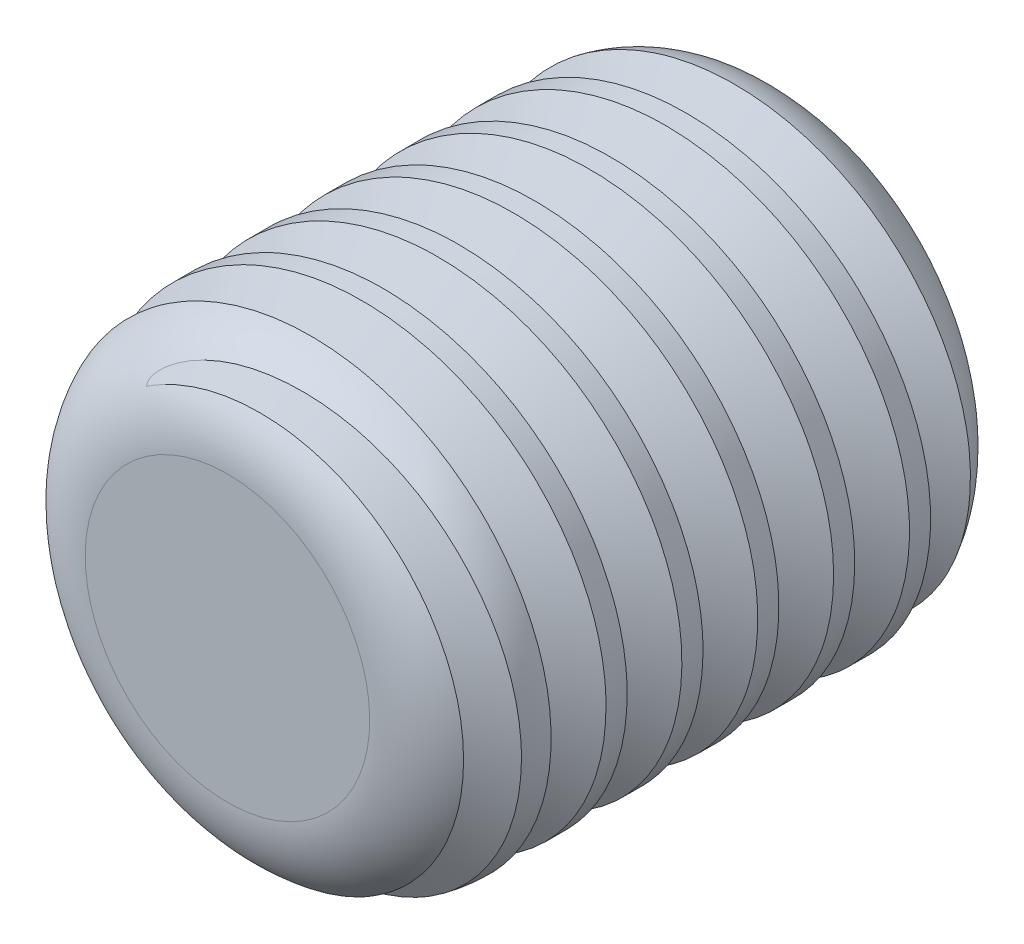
ISO-10303-21;
HEADER;
FILE_DESCRIPTION(('STEP AP214'),'2;1');
FILE_NAME('part.step','',(''),(''),'','','');
FILE_SCHEMA(('AUTOMOTIVE_DESIGN { 1 0 10303 214 1 1 1 1 }'));
ENDSEC;
DATA;
#1=APPLICATION_CONTEXT('core data for automotive mechanical design processes');
#2=APPLICATION_PROTOCOL_DEFINITION('international standard','automotive_design',2000,#1);
#3=PRODUCT_CONTEXT('',#1,'mechanical');
#4=PRODUCT('Part','Part','',(#3));
#5=PRODUCT_RELATED_PRODUCT_CATEGORY('part','',(#4));
#6=PRODUCT_DEFINITION_FORMATION('','',#4);
#7=PRODUCT_DEFINITION_CONTEXT('part definition',#1,'design');
#8=PRODUCT_DEFINITION('design','',#6,#7);
#9=PRODUCT_DEFINITION_SHAPE('','',#8);
#10=(LENGTH_UNIT() NAMED_UNIT(*) SI_UNIT(.MILLI.,.METRE.));
#11=(NAMED_UNIT(*) PLANE_ANGLE_UNIT() SI_UNIT($,.RADIAN.));
#12=(NAMED_UNIT(*) SI_UNIT($,.STERADIAN.) SOLID_ANGLE_UNIT());
#13=UNCERTAINTY_MEASURE_WITH_UNIT(LENGTH_MEASURE(1.E-05),#10,'distance_accuracy_value','');
#14=(GEOMETRIC_REPRESENTATION_CONTEXT(3) GLOBAL_UNCERTAINTY_ASSIGNED_CONTEXT((#13)) GLOBAL_UNIT_ASSIGNED_CONTEXT((#10,
#11,#12)) REPRESENTATION_CONTEXT('',''));
#15=CARTESIAN_POINT('',(0.,0.,0.));
#16=DIRECTION('',(0.,0.,1.));
#17=DIRECTION('',(1.,0.,0.));
#18=AXIS2_PLACEMENT_3D('',#15,#16,#17);
#19=CARTESIAN_POINT('',(0.,0.,6.));
#20=DIRECTION('',(0.,0.,-1.));
#21=DIRECTION('',(-1.,0.,0.));
#22=AXIS2_PLACEMENT_3D('',#19,#20,#21);
#23=CYLINDRICAL_SURFACE('',#22,2.5);
#24=CARTESIAN_POINT('',(1.76776695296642,-1.76776695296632,-0.388675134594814));
#25=CARTESIAN_POINT('',(2.50000000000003,-1.03553390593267,-0.338675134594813));
#26=CARTESIAN_POINT('',(2.5,0.,-0.288675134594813));
#27=CARTESIAN_POINT('',(2.49999999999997,1.03553390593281,-0.238675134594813));
#28=CARTESIAN_POINT('',(1.76776695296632,1.76776695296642,-0.188675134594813));
#29=CARTESIAN_POINT('',(1.03553390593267,2.50000000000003,-0.138675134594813));
#30=CARTESIAN_POINT('',(0.,2.5,-0.0886751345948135));
#31=CARTESIAN_POINT('',(-1.03553390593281,2.49999999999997,-0.0386751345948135));
#32=CARTESIAN_POINT('',(-1.76776695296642,1.76776695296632,0.0113248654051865));
#33=CARTESIAN_POINT('',(-2.50000000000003,1.03553390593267,0.0613248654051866));
#34=CARTESIAN_POINT('',(-2.5,0.,0.111324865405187));
#35=CARTESIAN_POINT('',(-2.49999999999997,-1.03553390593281,0.161324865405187));
#36=CARTESIAN_POINT('',(-1.76776695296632,-1.76776695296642,0.211324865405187));
#37=CARTESIAN_POINT('',(-1.03553390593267,-2.50000000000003,0.261324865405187));
#38=CARTESIAN_POINT('',(0.,-2.5,0.311324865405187));
#39=CARTESIAN_POINT('',(1.03553390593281,-2.49999999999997,0.361324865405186));
#40=CARTESIAN_POINT('',(1.76776695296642,-1.76776695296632,0.411324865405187));
#41=CARTESIAN_POINT('',(2.50000000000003,-1.03553390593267,0.461324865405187));
#42=CARTESIAN_POINT('',(2.5,0.,0.511324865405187));
#43=CARTESIAN_POINT('',(2.49999999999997,1.03553390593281,0.561324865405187));
#44=CARTESIAN_POINT('',(1.76776695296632,1.76776695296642,0.611324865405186));
#45=CARTESIAN_POINT('',(1.03553390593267,2.50000000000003,0.661324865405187));
#46=CARTESIAN_POINT('',(0.,2.5,0.711324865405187));
#47=CARTESIAN_POINT('',(-1.03553390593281,2.49999999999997,0.761324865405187));
#48=CARTESIAN_POINT('',(-1.76776695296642,1.76776695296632,0.811324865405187));
#49=CARTESIAN_POINT('',(-2.50000000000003,1.03553390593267,0.861324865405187));
#50=CARTESIAN_POINT('',(-2.5,0.,0.911324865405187));
#51=CARTESIAN_POINT('',(-2.49999999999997,-1.03553390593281,0.961324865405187));
#52=CARTESIAN_POINT('',(-1.76776695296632,-1.76776695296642,1.01132486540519));
#53=CARTESIAN_POINT('',(-1.03553390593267,-2.50000000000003,1.06132486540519));
#54=CARTESIAN_POINT('',(0.,-2.5,1.11132486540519));
#55=CARTESIAN_POINT('',(1.03553390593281,-2.49999999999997,1.16132486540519));
#56=CARTESIAN_POINT('',(1.76776695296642,-1.76776695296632,1.21132486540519));
#57=CARTESIAN_POINT('',(2.50000000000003,-1.03553390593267,1.26132486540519));
#58=CARTESIAN_POINT('',(2.5,0.,1.31132486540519));
#59=CARTESIAN_POINT('',(2.49999999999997,1.03553390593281,1.36132486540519));
#60=CARTESIAN_POINT('',(1.76776695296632,1.76776695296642,1.41132486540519));
#61=CARTESIAN_POINT('',(1.03553390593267,2.50000000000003,1.46132486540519));
#62=CARTESIAN_POINT('',(0.,2.5,1.51132486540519));
#63=CARTESIAN_POINT('',(-1.03553390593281,2.49999999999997,1.56132486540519));
#64=CARTESIAN_POINT('',(-1.76776695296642,1.76776695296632,1.61132486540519));
#65=CARTESIAN_POINT('',(-2.50000000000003,1.03553390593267,1.66132486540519));
#66=CARTESIAN_POINT('',(-2.5,0.,1.71132486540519));
#67=CARTESIAN_POINT('',(-2.49999999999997,-1.03553390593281,1.76132486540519));
#68=CARTESIAN_POINT('',(-1.76776695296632,-1.76776695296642,1.81132486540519));
#69=CARTESIAN_POINT('',(-1.03553390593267,-2.50000000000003,1.86132486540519));
#70=CARTESIAN_POINT('',(0.,-2.5,1.91132486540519));
#71=CARTESIAN_POINT('',(1.03553390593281,-2.49999999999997,1.96132486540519));
#72=CARTESIAN_POINT('',(1.76776695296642,-1.76776695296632,2.01132486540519));
#73=CARTESIAN_POINT('',(2.50000000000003,-1.03553390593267,2.06132486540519));
#74=CARTESIAN_POINT('',(2.5,0.,2.11132486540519));
#75=CARTESIAN_POINT('',(2.49999999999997,1.03553390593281,2.16132486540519));
#76=CARTESIAN_POINT('',(1.76776695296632,1.76776695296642,2.21132486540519));
#77=CARTESIAN_POINT('',(1.03553390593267,2.50000000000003,2.26132486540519));
#78=CARTESIAN_POINT('',(0.,2.5,2.31132486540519));
#79=CARTESIAN_POINT('',(-1.03553390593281,2.49999999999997,2.36132486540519));
#80=CARTESIAN_POINT('',(-1.76776695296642,1.76776695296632,2.41132486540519));
#81=CARTESIAN_POINT('',(-2.50000000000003,1.03553390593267,2.46132486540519));
#82=CARTESIAN_POINT('',(-2.5,0.,2.51132486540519));
#83=CARTESIAN_POINT('',(-2.49999999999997,-1.03553390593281,2.56132486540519));
#84=CARTESIAN_POINT('',(-1.76776695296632,-1.76776695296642,2.61132486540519));
#85=CARTESIAN_POINT('',(-1.03553390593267,-2.50000000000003,2.66132486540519));
#86=CARTESIAN_POINT('',(0.,-2.5,2.71132486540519));
#87=CARTESIAN_POINT('',(1.03553390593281,-2.49999999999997,2.76132486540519));
#88=CARTESIAN_POINT('',(1.76776695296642,-1.76776695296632,2.81132486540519));
#89=CARTESIAN_POINT('',(2.50000000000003,-1.03553390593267,2.86132486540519));
#90=CARTESIAN_POINT('',(2.5,0.,2.91132486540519));
#91=CARTESIAN_POINT('',(2.49999999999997,1.03553390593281,2.96132486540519));
#92=CARTESIAN_POINT('',(1.76776695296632,1.76776695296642,3.01132486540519));
#93=CARTESIAN_POINT('',(1.03553390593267,2.50000000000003,3.06132486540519));
#94=CARTESIAN_POINT('',(0.,2.5,3.11132486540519));
#95=CARTESIAN_POINT('',(-1.03553390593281,2.49999999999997,3.16132486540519));
#96=CARTESIAN_POINT('',(-1.76776695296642,1.76776695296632,3.21132486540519));
#97=CARTESIAN_POINT('',(-2.50000000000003,1.03553390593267,3.26132486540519));
#98=CARTESIAN_POINT('',(-2.5,0.,3.31132486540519));
#99=CARTESIAN_POINT('',(-2.49999999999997,-1.03553390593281,3.36132486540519));
#100=CARTESIAN_POINT('',(-1.76776695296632,-1.76776695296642,3.41132486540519));
#101=CARTESIAN_POINT('',(-1.03553390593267,-2.50000000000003,3.46132486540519));
#102=CARTESIAN_POINT('',(0.,-2.5,3.51132486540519));
#103=CARTESIAN_POINT('',(1.03553390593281,-2.49999999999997,3.56132486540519));
#104=CARTESIAN_POINT('',(1.76776695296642,-1.76776695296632,3.61132486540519));
#105=CARTESIAN_POINT('',(2.50000000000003,-1.03553390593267,3.66132486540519));
#106=CARTESIAN_POINT('',(2.5,0.,3.71132486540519));
#107=CARTESIAN_POINT('',(2.49999999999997,1.03553390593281,3.76132486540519));
#108=CARTESIAN_POINT('',(1.76776695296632,1.76776695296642,3.81132486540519));
#109=CARTESIAN_POINT('',(1.03553390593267,2.50000000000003,3.86132486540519));
#110=CARTESIAN_POINT('',(0.,2.5,3.91132486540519));
#111=CARTESIAN_POINT('',(-1.03553390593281,2.49999999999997,3.96132486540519));
#112=CARTESIAN_POINT('',(-1.76776695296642,1.76776695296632,4.01132486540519));
#113=CARTESIAN_POINT('',(-2.50000000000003,1.03553390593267,4.06132486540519));
#114=CARTESIAN_POINT('',(-2.5,0.,4.11132486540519));
#115=CARTESIAN_POINT('',(-2.49999999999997,-1.03553390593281,4.16132486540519));
#116=CARTESIAN_POINT('',(-1.76776695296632,-1.76776695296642,4.21132486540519));
#117=CARTESIAN_POINT('',(-1.03553390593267,-2.50000000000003,4.26132486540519));
#118=CARTESIAN_POINT('',(0.,-2.5,4.31132486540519));
#119=CARTESIAN_POINT('',(1.03553390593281,-2.49999999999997,4.36132486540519));
#120=CARTESIAN_POINT('',(1.76776695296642,-1.76776695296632,4.41132486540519));
#121=CARTESIAN_POINT('',(2.50000000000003,-1.03553390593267,4.46132486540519));
#122=CARTESIAN_POINT('',(2.5,0.,4.51132486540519));
#123=CARTESIAN_POINT('',(2.49999999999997,1.03553390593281,4.56132486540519));
#124=CARTESIAN_POINT('',(1.76776695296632,1.76776695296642,4.61132486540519));
#125=CARTESIAN_POINT('',(1.03553390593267,2.50000000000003,4.66132486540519));
#126=CARTESIAN_POINT('',(0.,2.5,4.71132486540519));
#127=CARTESIAN_POINT('',(-1.03553390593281,2.49999999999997,4.76132486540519));
#128=CARTESIAN_POINT('',(-1.76776695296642,1.76776695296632,4.81132486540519));
#129=CARTESIAN_POINT('',(-2.50000000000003,1.03553390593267,4.86132486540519));
#130=CARTESIAN_POINT('',(-2.5,0.,4.91132486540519));
#131=CARTESIAN_POINT('',(-2.49999999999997,-1.03553390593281,4.96132486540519));
#132=CARTESIAN_POINT('',(-1.76776695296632,-1.76776695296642,5.01132486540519));
#133=CARTESIAN_POINT('',(-1.03553390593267,-2.50000000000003,5.06132486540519));
#134=CARTESIAN_POINT('',(0.,-2.5,5.11132486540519));
#135=CARTESIAN_POINT('',(1.03553390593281,-2.49999999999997,5.16132486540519));
#136=CARTESIAN_POINT('',(1.76776695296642,-1.76776695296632,5.21132486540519));
#137=CARTESIAN_POINT('',(2.50000000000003,-1.03553390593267,5.26132486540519));
#138=CARTESIAN_POINT('',(2.5,0.,5.31132486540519));
#139=CARTESIAN_POINT('',(2.49999999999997,1.03553390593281,5.36132486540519));
#140=CARTESIAN_POINT('',(1.76776695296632,1.76776695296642,5.41132486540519));
#141=CARTESIAN_POINT('',(1.03553390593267,2.50000000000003,5.46132486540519));
#142=CARTESIAN_POINT('',(0.,2.5,5.51132486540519));
#143=CARTESIAN_POINT('',(-1.03553390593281,2.49999999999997,5.56132486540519));
#144=CARTESIAN_POINT('',(-1.76776695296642,1.76776695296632,5.61132486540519));
#145=(BOUNDED_CURVE() B_SPLINE_CURVE(2,(#24,#25,#26,#27,#28,#29,#30,#31,#32,#33,#34,#35,#36,#37,
#38,#39,#40,#41,#42,#43,#44,#45,#46,#47,#48,#49,#50,#51,#52,#53,#54,#55,#56,#57,#58,#59,#60,#61,
#62,#63,#64,#65,#66,#67,#68,#69,#70,#71,#72,#73,#74,#75,#76,#77,#78,#79,#80,#81,#82,#83,#84,#85,
#86,#87,#88,#89,#90,#91,#92,#93,#94,#95,#96,#97,#98,#99,#100,#101,#102,#103,#104,#105,#106,#107,
#108,#109,#110,#111,#112,#113,#114,#115,#116,#117,#118,#119,#120,#121,#122,#123,#124,#125,#126,
#127,#128,#129,#130,#131,#132,#133,#134,#135,#136,#137,#138,#139,#140,#141,#142,#143,#144),
.UNSPECIFIED.,.F.,.F.) B_SPLINE_CURVE_WITH_KNOTS((3,2,2,2,2,2,2,2,2,2,2,2,2,2,2,2,2,2,2,2,2,2,2,
2,2,2,2,2,2,2,2,2,2,2,2,2,2,2,2,2,2,2,2,2,2,2,2,2,2,2,2,2,2,2,2,2,2,2,2,2,3),(0.,0.015625,
0.03125,0.046875,0.0625,0.078125,0.09375,0.109375,0.125,0.140625,0.15625,0.171875,0.1875,
0.203125,0.21875,0.234375,0.25,0.265625,0.28125,0.296875,0.3125,0.328125,0.34375,0.359375,0.375,
0.390625,0.40625,0.421875,0.4375,0.453125,0.46875,0.484375,0.5,0.515625,0.53125,0.546875,0.5625,
0.578125,0.59375,0.609375,0.625,0.640625,0.65625,0.671875,0.6875,0.703125,0.71875,0.734375,0.75,
0.765625,0.78125,0.796875,0.8125,0.828125,0.84375,0.859375,0.875,0.890625,0.90625,0.921875,
0.9375),.UNSPECIFIED.) CURVE() GEOMETRIC_REPRESENTATION_ITEM() RATIONAL_B_SPLINE_CURVE((1.,
0.923879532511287,1.,0.923879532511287,1.,0.923879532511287,1.,0.923879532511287,1.,
0.923879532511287,1.,0.923879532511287,1.,0.923879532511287,1.,0.923879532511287,1.,
0.923879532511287,1.,0.923879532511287,1.,0.923879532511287,1.,0.923879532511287,1.,
0.923879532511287,1.,0.923879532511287,1.,0.923879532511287,1.,0.923879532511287,1.,
0.923879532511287,1.,0.923879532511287,1.,0.923879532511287,1.,0.923879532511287,1.,
0.923879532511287,1.,0.923879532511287,1.,0.923879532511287,1.,0.923879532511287,1.,
0.923879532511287,1.,0.923879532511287,1.,0.923879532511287,1.,0.923879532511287,1.,
0.923879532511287,1.,0.923879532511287,1.,0.923879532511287,1.,0.923879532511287,1.,
0.923879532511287,1.,0.923879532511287,1.,0.923879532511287,1.,0.923879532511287,1.,
0.923879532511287,1.,0.923879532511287,1.,0.923879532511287,1.,0.923879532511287,1.,
0.923879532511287,1.,0.923879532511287,1.,0.923879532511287,1.,0.923879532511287,1.,
0.923879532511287,1.,0.923879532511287,1.,0.923879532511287,1.,0.923879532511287,1.,
0.923879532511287,1.,0.923879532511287,1.,0.923879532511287,1.,0.923879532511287,1.,
0.923879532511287,1.,0.923879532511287,1.,0.923879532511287,1.,0.923879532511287,1.,
0.923879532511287,1.,0.923879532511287,1.,0.923879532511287,1.,0.923879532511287,1.)) REPRESENTATION_ITEM(''));
#146=CARTESIAN_POINT('',(-1.92299958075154,-1.5975207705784,1.00000000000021));
#147=VERTEX_POINT('',#146);
#148=CARTESIAN_POINT('',(-1.9229995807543,-1.59752077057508,5.));
#149=VERTEX_POINT('',#148);
#150=EDGE_CURVE('E184',#147,#149,#145,.T.);
#151=ORIENTED_EDGE('',*,*,#150,.F.);
#152=CARTESIAN_POINT('',(0.,0.,1.));
#153=DIRECTION('',(0.,0.,1.));
#154=DIRECTION('',(1.,0.,0.));
#155=AXIS2_PLACEMENT_3D('',#152,#153,#154);
#156=CIRCLE('',#155,2.5);
#157=CARTESIAN_POINT('',(1.92299958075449,-1.59752077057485,1.00000000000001));
#158=VERTEX_POINT('',#157);
#159=EDGE_CURVE('E185',#147,#158,#156,.T.);
#160=ORIENTED_EDGE('',*,*,#159,.T.);
#161=CARTESIAN_POINT('',(1.76776695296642,-1.76776695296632,0.188675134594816));
#162=CARTESIAN_POINT('',(2.50000000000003,-1.03553390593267,0.238675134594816));
#163=CARTESIAN_POINT('',(2.5,0.,0.288675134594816));
#164=CARTESIAN_POINT('',(2.49999999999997,1.03553390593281,0.338675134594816));
#165=CARTESIAN_POINT('',(1.76776695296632,1.76776695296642,0.388675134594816));
#166=CARTESIAN_POINT('',(1.03553390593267,2.50000000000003,0.438675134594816));
#167=CARTESIAN_POINT('',(0.,2.5,0.488675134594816));
#168=CARTESIAN_POINT('',(-1.03553390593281,2.49999999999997,0.538675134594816));
#169=CARTESIAN_POINT('',(-1.76776695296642,1.76776695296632,0.588675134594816));
#170=CARTESIAN_POINT('',(-2.50000000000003,1.03553390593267,0.638675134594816));
#171=CARTESIAN_POINT('',(-2.5,0.,0.688675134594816));
#172=CARTESIAN_POINT('',(-2.49999999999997,-1.03553390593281,0.738675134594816));
#173=CARTESIAN_POINT('',(-1.76776695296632,-1.76776695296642,0.788675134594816));
#174=CARTESIAN_POINT('',(-1.03553390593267,-2.50000000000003,0.838675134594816));
#175=CARTESIAN_POINT('',(0.,-2.5,0.888675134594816));
#176=CARTESIAN_POINT('',(1.03553390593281,-2.49999999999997,0.938675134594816));
#177=CARTESIAN_POINT('',(1.76776695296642,-1.76776695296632,0.988675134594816));
#178=CARTESIAN_POINT('',(2.50000000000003,-1.03553390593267,1.03867513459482));
#179=CARTESIAN_POINT('',(2.5,0.,1.08867513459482));
#180=CARTESIAN_POINT('',(2.49999999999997,1.03553390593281,1.13867513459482));
#181=CARTESIAN_POINT('',(1.76776695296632,1.76776695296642,1.18867513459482));
#182=CARTESIAN_POINT('',(1.03553390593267,2.50000000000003,1.23867513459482));
#183=CARTESIAN_POINT('',(0.,2.5,1.28867513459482));
#184=CARTESIAN_POINT('',(-1.03553390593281,2.49999999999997,1.33867513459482));
#185=CARTESIAN_POINT('',(-1.76776695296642,1.76776695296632,1.38867513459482));
#186=CARTESIAN_POINT('',(-2.50000000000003,1.03553390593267,1.43867513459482));
#187=CARTESIAN_POINT('',(-2.5,0.,1.48867513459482));
#188=CARTESIAN_POINT('',(-2.49999999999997,-1.03553390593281,1.53867513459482));
#189=CARTESIAN_POINT('',(-1.76776695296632,-1.76776695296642,1.58867513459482));
#190=CARTESIAN_POINT('',(-1.03553390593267,-2.50000000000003,1.63867513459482));
#191=CARTESIAN_POINT('',(0.,-2.5,1.68867513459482));
#192=CARTESIAN_POINT('',(1.03553390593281,-2.49999999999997,1.73867513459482));
#193=CARTESIAN_POINT('',(1.76776695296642,-1.76776695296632,1.78867513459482));
#194=CARTESIAN_POINT('',(2.50000000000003,-1.03553390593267,1.83867513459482));
#195=CARTESIAN_POINT('',(2.5,0.,1.88867513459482));
#196=CARTESIAN_POINT('',(2.49999999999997,1.03553390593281,1.93867513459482));
#197=CARTESIAN_POINT('',(1.76776695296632,1.76776695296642,1.98867513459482));
#198=CARTESIAN_POINT('',(1.03553390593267,2.50000000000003,2.03867513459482));
#199=CARTESIAN_POINT('',(0.,2.5,2.08867513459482));
#200=CARTESIAN_POINT('',(-1.03553390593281,2.49999999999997,2.13867513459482));
#201=CARTESIAN_POINT('',(-1.76776695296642,1.76776695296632,2.18867513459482));
#202=CARTESIAN_POINT('',(-2.50000000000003,1.03553390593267,2.23867513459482));
#203=CARTESIAN_POINT('',(-2.5,0.,2.28867513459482));
#204=CARTESIAN_POINT('',(-2.49999999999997,-1.03553390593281,2.33867513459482));
#205=CARTESIAN_POINT('',(-1.76776695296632,-1.76776695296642,2.38867513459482));
#206=CARTESIAN_POINT('',(-1.03553390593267,-2.50000000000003,2.43867513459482));
#207=CARTESIAN_POINT('',(0.,-2.5,2.48867513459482));
#208=CARTESIAN_POINT('',(1.03553390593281,-2.49999999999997,2.53867513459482));
#209=CARTESIAN_POINT('',(1.76776695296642,-1.76776695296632,2.58867513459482));
#210=CARTESIAN_POINT('',(2.50000000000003,-1.03553390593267,2.63867513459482));
#211=CARTESIAN_POINT('',(2.5,0.,2.68867513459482));
#212=CARTESIAN_POINT('',(2.49999999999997,1.03553390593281,2.73867513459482));
#213=CARTESIAN_POINT('',(1.76776695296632,1.76776695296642,2.78867513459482));
#214=CARTESIAN_POINT('',(1.03553390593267,2.50000000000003,2.83867513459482));
#215=CARTESIAN_POINT('',(0.,2.5,2.88867513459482));
#216=CARTESIAN_POINT('',(-1.03553390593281,2.49999999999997,2.93867513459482));
#217=CARTESIAN_POINT('',(-1.76776695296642,1.76776695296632,2.98867513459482));
#218=CARTESIAN_POINT('',(-2.50000000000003,1.03553390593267,3.03867513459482));
#219=CARTESIAN_POINT('',(-2.5,0.,3.08867513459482));
#220=CARTESIAN_POINT('',(-2.49999999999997,-1.03553390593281,3.13867513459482));
#221=CARTESIAN_POINT('',(-1.76776695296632,-1.76776695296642,3.18867513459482));
#222=CARTESIAN_POINT('',(-1.03553390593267,-2.50000000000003,3.23867513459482));
#223=CARTESIAN_POINT('',(0.,-2.5,3.28867513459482));
#224=CARTESIAN_POINT('',(1.03553390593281,-2.49999999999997,3.33867513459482));
#225=CARTESIAN_POINT('',(1.76776695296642,-1.76776695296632,3.38867513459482));
#226=CARTESIAN_POINT('',(2.50000000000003,-1.03553390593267,3.43867513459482));
#227=CARTESIAN_POINT('',(2.5,0.,3.48867513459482));
#228=CARTESIAN_POINT('',(2.49999999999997,1.03553390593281,3.53867513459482));
#229=CARTESIAN_POINT('',(1.76776695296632,1.76776695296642,3.58867513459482));
#230=CARTESIAN_POINT('',(1.03553390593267,2.50000000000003,3.63867513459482));
#231=CARTESIAN_POINT('',(0.,2.5,3.68867513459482));
#232=CARTESIAN_POINT('',(-1.03553390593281,2.49999999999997,3.73867513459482));
#233=CARTESIAN_POINT('',(-1.76776695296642,1.76776695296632,3.78867513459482));
#234=CARTESIAN_POINT('',(-2.50000000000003,1.03553390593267,3.83867513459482));
#235=CARTESIAN_POINT('',(-2.5,0.,3.88867513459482));
#236=CARTESIAN_POINT('',(-2.49999999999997,-1.03553390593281,3.93867513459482));
#237=CARTESIAN_POINT('',(-1.76776695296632,-1.76776695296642,3.98867513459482));
#238=CARTESIAN_POINT('',(-1.03553390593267,-2.50000000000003,4.03867513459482));
#239=CARTESIAN_POINT('',(0.,-2.5,4.08867513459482));
#240=CARTESIAN_POINT('',(1.03553390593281,-2.49999999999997,4.13867513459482));
#241=CARTESIAN_POINT('',(1.76776695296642,-1.76776695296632,4.18867513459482));
#242=CARTESIAN_POINT('',(2.50000000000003,-1.03553390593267,4.23867513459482));
#243=CARTESIAN_POINT('',(2.5,0.,4.28867513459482));
#244=CARTESIAN_POINT('',(2.49999999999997,1.03553390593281,4.33867513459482));
#245=CARTESIAN_POINT('',(1.76776695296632,1.76776695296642,4.38867513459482));
#246=CARTESIAN_POINT('',(1.03553390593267,2.50000000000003,4.43867513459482));
#247=CARTESIAN_POINT('',(0.,2.5,4.48867513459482));
#248=CARTESIAN_POINT('',(-1.03553390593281,2.49999999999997,4.53867513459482));
#249=CARTESIAN_POINT('',(-1.76776695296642,1.76776695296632,4.58867513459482));
#250=CARTESIAN_POINT('',(-2.50000000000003,1.03553390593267,4.63867513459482));
#251=CARTESIAN_POINT('',(-2.5,0.,4.68867513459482));
#252=CARTESIAN_POINT('',(-2.49999999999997,-1.03553390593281,4.73867513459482));
#253=CARTESIAN_POINT('',(-1.76776695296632,-1.76776695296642,4.78867513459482));
#254=CARTESIAN_POINT('',(-1.03553390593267,-2.50000000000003,4.83867513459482));
#255=CARTESIAN_POINT('',(0.,-2.5,4.88867513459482));
#256=CARTESIAN_POINT('',(1.03553390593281,-2.49999999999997,4.93867513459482));
#257=CARTESIAN_POINT('',(1.76776695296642,-1.76776695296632,4.98867513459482));
#258=CARTESIAN_POINT('',(2.50000000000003,-1.03553390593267,5.03867513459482));
#259=CARTESIAN_POINT('',(2.5,0.,5.08867513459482));
#260=CARTESIAN_POINT('',(2.49999999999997,1.03553390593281,5.13867513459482));
#261=CARTESIAN_POINT('',(1.76776695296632,1.76776695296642,5.18867513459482));
#262=CARTESIAN_POINT('',(1.03553390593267,2.50000000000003,5.23867513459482));
#263=CARTESIAN_POINT('',(0.,2.5,5.28867513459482));
#264=CARTESIAN_POINT('',(-1.03553390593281,2.49999999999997,5.33867513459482));
#265=CARTESIAN_POINT('',(-1.76776695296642,1.76776695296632,5.38867513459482));
#266=CARTESIAN_POINT('',(-2.50000000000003,1.03553390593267,5.43867513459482));
#267=CARTESIAN_POINT('',(-2.5,0.,5.48867513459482));
#268=CARTESIAN_POINT('',(-2.49999999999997,-1.03553390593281,5.53867513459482));
#269=CARTESIAN_POINT('',(-1.76776695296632,-1.76776695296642,5.58867513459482));
#270=CARTESIAN_POINT('',(-1.03553390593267,-2.50000000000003,5.63867513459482));
#271=CARTESIAN_POINT('',(0.,-2.5,5.68867513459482));
#272=CARTESIAN_POINT('',(1.03553390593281,-2.49999999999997,5.73867513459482));
#273=CARTESIAN_POINT('',(1.76776695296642,-1.76776695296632,5.78867513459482));
#274=CARTESIAN_POINT('',(2.50000000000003,-1.03553390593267,5.83867513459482));
#275=CARTESIAN_POINT('',(2.5,0.,5.88867513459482));
#276=CARTESIAN_POINT('',(2.49999999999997,1.03553390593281,5.93867513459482));
#277=CARTESIAN_POINT('',(1.76776695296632,1.76776695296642,5.98867513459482));
#278=CARTESIAN_POINT('',(1.03553390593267,2.50000000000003,6.03867513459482));
#279=CARTESIAN_POINT('',(0.,2.5,6.08867513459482));
#280=CARTESIAN_POINT('',(-1.03553390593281,2.49999999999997,6.13867513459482));
#281=CARTESIAN_POINT('',(-1.76776695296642,1.76776695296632,6.18867513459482));
#282=(BOUNDED_CURVE() B_SPLINE_CURVE(2,(#161,#162,#163,#164,#165,#166,#167,#168,#169,#170,#171,
#172,#173,#174,#175,#176,#177,#178,#179,#180,#181,#182,#183,#184,#185,#186,#187,#188,#189,#190,
#191,#192,#193,#194,#195,#196,#197,#198,#199,#200,#201,#202,#203,#204,#205,#206,#207,#208,#209,
#210,#211,#212,#213,#214,#215,#216,#217,#218,#219,#220,#221,#222,#223,#224,#225,#226,#227,#228,
#229,#230,#231,#232,#233,#234,#235,#236,#237,#238,#239,#240,#241,#242,#243,#244,#245,#246,#247,
#248,#249,#250,#251,#252,#253,#254,#255,#256,#257,#258,#259,#260,#261,#262,#263,#264,#265,#266,
#267,#268,#269,#270,#271,#272,#273,#274,#275,#276,#277,#278,#279,#280,#281),.UNSPECIFIED.,.F.,
.F.) B_SPLINE_CURVE_WITH_KNOTS((3,2,2,2,2,2,2,2,2,2,2,2,2,2,2,2,2,2,2,2,2,2,2,2,2,2,2,2,2,2,2,2,
2,2,2,2,2,2,2,2,2,2,2,2,2,2,2,2,2,2,2,2,2,2,2,2,2,2,2,2,3),(0.,0.015625,0.03125,0.046875,0.0625,
0.078125,0.09375,0.109375,0.125,0.140625,0.15625,0.171875,0.1875,0.203125,0.21875,0.234375,0.25,
0.265625,0.28125,0.296875,0.3125,0.328125,0.34375,0.359375,0.375,0.390625,0.40625,0.421875,
0.4375,0.453125,0.46875,0.484375,0.5,0.515625,0.53125,0.546875,0.5625,0.578125,0.59375,0.609375,
0.625,0.640625,0.65625,0.671875,0.6875,0.703125,0.71875,0.734375,0.75,0.765625,0.78125,0.796875,
0.8125,0.828125,0.84375,0.859375,0.875,0.890625,0.90625,0.921875,0.9375),
.UNSPECIFIED.) CURVE() GEOMETRIC_REPRESENTATION_ITEM() RATIONAL_B_SPLINE_CURVE((1.,
0.923879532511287,1.,0.923879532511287,1.,0.923879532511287,1.,0.923879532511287,1.,
0.923879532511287,1.,0.923879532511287,1.,0.923879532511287,1.,0.923879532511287,1.,
0.923879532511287,1.,0.923879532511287,1.,0.923879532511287,1.,0.923879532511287,1.,
0.923879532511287,1.,0.923879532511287,1.,0.923879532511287,1.,0.923879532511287,1.,
0.923879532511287,1.,0.923879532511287,1.,0.923879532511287,1.,0.923879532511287,1.,
0.923879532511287,1.,0.923879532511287,1.,0.923879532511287,1.,0.923879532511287,1.,
0.923879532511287,1.,0.923879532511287,1.,0.923879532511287,1.,0.923879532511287,1.,
0.923879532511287,1.,0.923879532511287,1.,0.923879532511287,1.,0.923879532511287,1.,
0.923879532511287,1.,0.923879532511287,1.,0.923879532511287,1.,0.923879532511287,1.,
0.923879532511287,1.,0.923879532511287,1.,0.923879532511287,1.,0.923879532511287,1.,
0.923879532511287,1.,0.923879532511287,1.,0.923879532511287,1.,0.923879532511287,1.,
0.923879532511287,1.,0.923879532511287,1.,0.923879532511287,1.,0.923879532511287,1.,
0.923879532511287,1.,0.923879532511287,1.,0.923879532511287,1.,0.923879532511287,1.,
0.923879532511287,1.,0.923879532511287,1.,0.923879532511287,1.,0.923879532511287,1.,
0.923879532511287,1.,0.923879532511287,1.,0.923879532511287,1.,0.923879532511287,1.)) REPRESENTATION_ITEM(''));
#283=CARTESIAN_POINT('',(1.92299958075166,-1.59752077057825,4.99999999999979));
#284=VERTEX_POINT('',#283);
#285=EDGE_CURVE('E366',#284,#158,#282,.F.);
#286=ORIENTED_EDGE('',*,*,#285,.F.);
#287=CARTESIAN_POINT('',(0.,0.,5.));
#288=DIRECTION('',(0.,0.,1.));
#289=DIRECTION('',(1.,0.,0.));
#290=AXIS2_PLACEMENT_3D('',#287,#288,#289);
#291=CIRCLE('',#290,2.5);
#292=EDGE_CURVE('E364',#284,#149,#291,.F.);
#293=ORIENTED_EDGE('',*,*,#292,.T.);
#294=EDGE_LOOP('',(#151,#160,#286,#293));
#295=FACE_BOUND('',#294,.T.);
#296=ADVANCED_FACE('F36',(#295),#23,.T.);
#297=CARTESIAN_POINT('',(0.,0.,0.));
#298=DIRECTION('',(0.,0.,1.));
#299=DIRECTION('',(1.,0.,0.));
#300=AXIS2_PLACEMENT_3D('',#297,#298,#299);
#301=PLANE('',#300);
#302=CARTESIAN_POINT('',(0.,0.,0.));
#303=DIRECTION('',(0.,0.,1.));
#304=DIRECTION('',(1.,0.,0.));
#305=AXIS2_PLACEMENT_3D('',#302,#303,#304);
#306=CIRCLE('',#305,1.5);
#307=CARTESIAN_POINT('',(-1.15379974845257,-0.958512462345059,0.));
#308=VERTEX_POINT('',#307);
#309=EDGE_CURVE('E45',#308,#308,#306,.F.);
#310=ORIENTED_EDGE('',*,*,#309,.T.);
#311=EDGE_LOOP('',(#310));
#312=FACE_BOUND('',#311,.T.);
#313=DIRECTION('',(0.867260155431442,0.497855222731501,0.));
#314=VECTOR('',#313,1.);
#315=CARTESIAN_POINT('',(-1.2482101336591,0.724779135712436,0.));
#316=LINE('',#315,#314);
#317=CARTESIAN_POINT('',(-1.2482101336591,0.724779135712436,0.));
#318=VERTEX_POINT('',#317);
#319=CARTESIAN_POINT('',(0.00357207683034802,1.44337125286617,0.));
#320=VERTEX_POINT('',#319);
#321=EDGE_CURVE('E148',#318,#320,#316,.T.);
#322=ORIENTED_EDGE('',*,*,#321,.F.);
#323=DIRECTION('',(0.00247480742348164,0.999996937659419,0.));
#324=VECTOR('',#323,1.);
#325=CARTESIAN_POINT('',(-1.25178221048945,-0.718592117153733,0.));
#326=LINE('',#325,#324);
#327=CARTESIAN_POINT('',(-1.25178221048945,-0.718592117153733,0.));
#328=VERTEX_POINT('',#327);
#329=EDGE_CURVE('E116',#328,#318,#326,.T.);
#330=ORIENTED_EDGE('',*,*,#329,.F.);
#331=DIRECTION('',(-0.86478534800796,0.502141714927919,0.));
#332=VECTOR('',#331,1.);
#333=CARTESIAN_POINT('',(-0.00357207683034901,-1.44337125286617,0.));
#334=LINE('',#333,#332);
#335=CARTESIAN_POINT('',(-0.00357207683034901,-1.44337125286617,0.));
#336=VERTEX_POINT('',#335);
#337=EDGE_CURVE('E134',#336,#328,#334,.T.);
#338=ORIENTED_EDGE('',*,*,#337,.F.);
#339=DIRECTION('',(-0.867260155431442,-0.497855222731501,0.));
#340=VECTOR('',#339,1.);
#341=CARTESIAN_POINT('',(1.2482101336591,-0.724779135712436,0.));
#342=LINE('',#341,#340);
#343=CARTESIAN_POINT('',(1.2482101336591,-0.724779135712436,0.));
#344=VERTEX_POINT('',#343);
#345=EDGE_CURVE('E137',#344,#336,#342,.T.);
#346=ORIENTED_EDGE('',*,*,#345,.F.);
#347=DIRECTION('',(-0.00247480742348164,-0.999996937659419,0.));
#348=VECTOR('',#347,1.);
#349=CARTESIAN_POINT('',(1.25178221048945,0.718592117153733,0.));
#350=LINE('',#349,#348);
#351=CARTESIAN_POINT('',(1.25178221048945,0.718592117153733,0.));
#352=VERTEX_POINT('',#351);
#353=EDGE_CURVE('E153',#352,#344,#350,.T.);
#354=ORIENTED_EDGE('',*,*,#353,.F.);
#355=DIRECTION('',(0.86478534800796,-0.502141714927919,0.));
#356=VECTOR('',#355,1.);
#357=CARTESIAN_POINT('',(0.00357207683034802,1.44337125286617,0.));
#358=LINE('',#357,#356);
#359=EDGE_CURVE('E150',#320,#352,#358,.T.);
#360=ORIENTED_EDGE('',*,*,#359,.F.);
#361=EDGE_LOOP('',(#322,#330,#338,#346,#354,#360));
#362=FACE_BOUND('',#361,.T.);
#363=ADVANCED_FACE('F221',(#312,#362),#301,.F.);
#364=CARTESIAN_POINT('',(0.,0.,6.));
#365=DIRECTION('',(0.,0.,1.));
#366=DIRECTION('',(1.,0.,0.));
#367=AXIS2_PLACEMENT_3D('',#364,#365,#366);
#368=PLANE('',#367);
#369=CARTESIAN_POINT('',(0.,0.,6.));
#370=DIRECTION('',(0.,0.,1.));
#371=DIRECTION('',(1.,0.,0.));
#372=AXIS2_PLACEMENT_3D('',#369,#370,#371);
#373=CIRCLE('',#372,1.5);
#374=CARTESIAN_POINT('',(-1.15379974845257,-0.958512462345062,6.));
#375=VERTEX_POINT('',#374);
#376=EDGE_CURVE('E12',#375,#375,#373,.T.);
#377=ORIENTED_EDGE('',*,*,#376,.T.);
#378=EDGE_LOOP('',(#377));
#379=FACE_BOUND('',#378,.T.);
#380=ADVANCED_FACE('F206',(#379),#368,.T.);
#381=CARTESIAN_POINT('',(1.41421356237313,-1.41421356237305,-0.0999999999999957));
#382=CARTESIAN_POINT('',(2.00000000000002,-0.828427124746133,-0.0499999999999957));
#383=CARTESIAN_POINT('',(2.,0.,0.));
#384=CARTESIAN_POINT('',(1.99999999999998,0.828427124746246,0.0500000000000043));
#385=CARTESIAN_POINT('',(1.41421356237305,1.41421356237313,0.100000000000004));
#386=CARTESIAN_POINT('',(0.828427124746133,2.00000000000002,0.150000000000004));
#387=CARTESIAN_POINT('',(0.,2.,0.200000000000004));
#388=CARTESIAN_POINT('',(-0.828427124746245,1.99999999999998,0.250000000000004));
#389=CARTESIAN_POINT('',(-1.41421356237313,1.41421356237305,0.300000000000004));
#390=CARTESIAN_POINT('',(-2.00000000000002,0.828427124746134,0.350000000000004));
#391=CARTESIAN_POINT('',(-2.,0.,0.400000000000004));
#392=CARTESIAN_POINT('',(-1.99999999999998,-0.828427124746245,0.450000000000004));
#393=CARTESIAN_POINT('',(-1.41421356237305,-1.41421356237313,0.500000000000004));
#394=CARTESIAN_POINT('',(-0.828427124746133,-2.00000000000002,0.550000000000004));
#395=CARTESIAN_POINT('',(0.,-2.,0.600000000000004));
#396=CARTESIAN_POINT('',(0.828427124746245,-1.99999999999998,0.650000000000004));
#397=CARTESIAN_POINT('',(1.41421356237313,-1.41421356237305,0.700000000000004));
#398=CARTESIAN_POINT('',(2.00000000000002,-0.828427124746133,0.750000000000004));
#399=CARTESIAN_POINT('',(2.,0.,0.800000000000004));
#400=CARTESIAN_POINT('',(1.99999999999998,0.828427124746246,0.850000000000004));
#401=CARTESIAN_POINT('',(1.41421356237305,1.41421356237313,0.900000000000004));
#402=CARTESIAN_POINT('',(0.828427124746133,2.00000000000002,0.950000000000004));
#403=CARTESIAN_POINT('',(0.,2.,1.));
#404=CARTESIAN_POINT('',(-0.828427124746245,1.99999999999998,1.05));
#405=CARTESIAN_POINT('',(-1.41421356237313,1.41421356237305,1.1));
#406=CARTESIAN_POINT('',(-2.00000000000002,0.828427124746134,1.15));
#407=CARTESIAN_POINT('',(-2.,0.,1.2));
#408=CARTESIAN_POINT('',(-1.99999999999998,-0.828427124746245,1.25));
#409=CARTESIAN_POINT('',(-1.41421356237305,-1.41421356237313,1.3));
#410=CARTESIAN_POINT('',(-0.828427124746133,-2.00000000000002,1.35));
#411=CARTESIAN_POINT('',(0.,-2.,1.4));
#412=CARTESIAN_POINT('',(0.828427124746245,-1.99999999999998,1.45));
#413=CARTESIAN_POINT('',(1.41421356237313,-1.41421356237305,1.5));
#414=CARTESIAN_POINT('',(2.00000000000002,-0.828427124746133,1.55));
#415=CARTESIAN_POINT('',(2.,0.,1.6));
#416=CARTESIAN_POINT('',(1.99999999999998,0.828427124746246,1.65));
#417=CARTESIAN_POINT('',(1.41421356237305,1.41421356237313,1.7));
#418=CARTESIAN_POINT('',(0.828427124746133,2.00000000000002,1.75));
#419=CARTESIAN_POINT('',(0.,2.,1.8));
#420=CARTESIAN_POINT('',(-0.828427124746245,1.99999999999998,1.85));
#421=CARTESIAN_POINT('',(-1.41421356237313,1.41421356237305,1.9));
#422=CARTESIAN_POINT('',(-2.00000000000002,0.828427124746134,1.95));
#423=CARTESIAN_POINT('',(-2.,0.,2.));
#424=CARTESIAN_POINT('',(-1.99999999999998,-0.828427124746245,2.05));
#425=CARTESIAN_POINT('',(-1.41421356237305,-1.41421356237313,2.1));
#426=CARTESIAN_POINT('',(-0.828427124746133,-2.00000000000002,2.15));
#427=CARTESIAN_POINT('',(0.,-2.,2.2));
#428=CARTESIAN_POINT('',(0.828427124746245,-1.99999999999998,2.25));
#429=CARTESIAN_POINT('',(1.41421356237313,-1.41421356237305,2.3));
#430=CARTESIAN_POINT('',(2.00000000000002,-0.828427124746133,2.35));
#431=CARTESIAN_POINT('',(2.,0.,2.4));
#432=CARTESIAN_POINT('',(1.99999999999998,0.828427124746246,2.45));
#433=CARTESIAN_POINT('',(1.41421356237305,1.41421356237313,2.5));
#434=CARTESIAN_POINT('',(0.828427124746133,2.00000000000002,2.55));
#435=CARTESIAN_POINT('',(0.,2.,2.6));
#436=CARTESIAN_POINT('',(-0.828427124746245,1.99999999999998,2.65));
#437=CARTESIAN_POINT('',(-1.41421356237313,1.41421356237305,2.7));
#438=CARTESIAN_POINT('',(-2.00000000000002,0.828427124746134,2.75));
#439=CARTESIAN_POINT('',(-2.,0.,2.8));
#440=CARTESIAN_POINT('',(-1.99999999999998,-0.828427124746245,2.85));
#441=CARTESIAN_POINT('',(-1.41421356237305,-1.41421356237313,2.9));
#442=CARTESIAN_POINT('',(-0.828427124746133,-2.00000000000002,2.95));
#443=CARTESIAN_POINT('',(0.,-2.,3.));
#444=CARTESIAN_POINT('',(0.828427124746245,-1.99999999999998,3.05));
#445=CARTESIAN_POINT('',(1.41421356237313,-1.41421356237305,3.1));
#446=CARTESIAN_POINT('',(2.00000000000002,-0.828427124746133,3.15));
#447=CARTESIAN_POINT('',(2.,0.,3.2));
#448=CARTESIAN_POINT('',(1.99999999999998,0.828427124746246,3.25));
#449=CARTESIAN_POINT('',(1.41421356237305,1.41421356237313,3.3));
#450=CARTESIAN_POINT('',(0.828427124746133,2.00000000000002,3.35));
#451=CARTESIAN_POINT('',(0.,2.,3.4));
#452=CARTESIAN_POINT('',(-0.828427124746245,1.99999999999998,3.45));
#453=CARTESIAN_POINT('',(-1.41421356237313,1.41421356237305,3.5));
#454=CARTESIAN_POINT('',(-2.00000000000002,0.828427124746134,3.55));
#455=CARTESIAN_POINT('',(-2.,0.,3.6));
#456=CARTESIAN_POINT('',(-1.99999999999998,-0.828427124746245,3.65));
#457=CARTESIAN_POINT('',(-1.41421356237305,-1.41421356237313,3.7));
#458=CARTESIAN_POINT('',(-0.828427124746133,-2.00000000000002,3.75));
#459=CARTESIAN_POINT('',(0.,-2.,3.8));
#460=CARTESIAN_POINT('',(0.828427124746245,-1.99999999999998,3.85));
#461=CARTESIAN_POINT('',(1.41421356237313,-1.41421356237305,3.9));
#462=CARTESIAN_POINT('',(2.00000000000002,-0.828427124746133,3.95));
#463=CARTESIAN_POINT('',(2.,0.,4.));
#464=CARTESIAN_POINT('',(1.99999999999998,0.828427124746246,4.05));
#465=CARTESIAN_POINT('',(1.41421356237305,1.41421356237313,4.1));
#466=CARTESIAN_POINT('',(0.828427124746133,2.00000000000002,4.15));
#467=CARTESIAN_POINT('',(0.,2.,4.2));
#468=CARTESIAN_POINT('',(-0.828427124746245,1.99999999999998,4.25));
#469=CARTESIAN_POINT('',(-1.41421356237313,1.41421356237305,4.3));
#470=CARTESIAN_POINT('',(-2.00000000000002,0.828427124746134,4.35));
#471=CARTESIAN_POINT('',(-2.,0.,4.4));
#472=CARTESIAN_POINT('',(-1.99999999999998,-0.828427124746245,4.45));
#473=CARTESIAN_POINT('',(-1.41421356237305,-1.41421356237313,4.5));
#474=CARTESIAN_POINT('',(-0.828427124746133,-2.00000000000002,4.55));
#475=CARTESIAN_POINT('',(0.,-2.,4.6));
#476=CARTESIAN_POINT('',(0.828427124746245,-1.99999999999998,4.65));
#477=CARTESIAN_POINT('',(1.41421356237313,-1.41421356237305,4.7));
#478=CARTESIAN_POINT('',(2.00000000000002,-0.828427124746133,4.75));
#479=CARTESIAN_POINT('',(2.,0.,4.8));
#480=CARTESIAN_POINT('',(1.99999999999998,0.828427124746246,4.85));
#481=CARTESIAN_POINT('',(1.41421356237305,1.41421356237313,4.9));
#482=CARTESIAN_POINT('',(0.828427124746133,2.00000000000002,4.95));
#483=CARTESIAN_POINT('',(0.,2.,5.));
#484=CARTESIAN_POINT('',(-0.828427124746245,1.99999999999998,5.05));
#485=CARTESIAN_POINT('',(-1.41421356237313,1.41421356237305,5.1));
#486=CARTESIAN_POINT('',(-2.00000000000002,0.828427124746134,5.15));
#487=CARTESIAN_POINT('',(-2.,0.,5.2));
#488=CARTESIAN_POINT('',(-1.99999999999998,-0.828427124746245,5.25));
#489=CARTESIAN_POINT('',(-1.41421356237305,-1.41421356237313,5.3));
#490=CARTESIAN_POINT('',(-0.828427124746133,-2.00000000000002,5.35));
#491=CARTESIAN_POINT('',(0.,-2.,5.4));
#492=CARTESIAN_POINT('',(0.828427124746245,-1.99999999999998,5.45000000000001));
#493=CARTESIAN_POINT('',(1.41421356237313,-1.41421356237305,5.5));
#494=CARTESIAN_POINT('',(2.00000000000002,-0.828427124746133,5.55));
#495=CARTESIAN_POINT('',(2.,0.,5.6));
#496=CARTESIAN_POINT('',(1.99999999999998,0.828427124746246,5.65));
#497=CARTESIAN_POINT('',(1.41421356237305,1.41421356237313,5.7));
#498=CARTESIAN_POINT('',(0.828427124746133,2.00000000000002,5.75));
#499=CARTESIAN_POINT('',(0.,2.,5.8));
#500=CARTESIAN_POINT('',(-0.828427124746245,1.99999999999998,5.85));
#501=CARTESIAN_POINT('',(-1.41421356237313,1.41421356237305,5.9));
#502=CARTESIAN_POINT('',(1.86255038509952,-1.86255038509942,0.266065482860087));
#503=CARTESIAN_POINT('',(2.63404401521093,-1.09105675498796,0.316065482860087));
#504=CARTESIAN_POINT('',(2.6340440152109,0.,0.366065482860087));
#505=CARTESIAN_POINT('',(2.63404401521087,1.09105675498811,0.416065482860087));
#506=CARTESIAN_POINT('',(1.86255038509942,1.86255038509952,0.466065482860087));
#507=CARTESIAN_POINT('',(1.09105675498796,2.63404401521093,0.516065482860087));
#508=CARTESIAN_POINT('',(0.,2.6340440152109,0.566065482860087));
#509=CARTESIAN_POINT('',(-1.09105675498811,2.63404401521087,0.616065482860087));
#510=CARTESIAN_POINT('',(-1.86255038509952,1.86255038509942,0.666065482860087));
#511=CARTESIAN_POINT('',(-2.63404401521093,1.09105675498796,0.716065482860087));
#512=CARTESIAN_POINT('',(-2.6340440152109,0.,0.766065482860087));
#513=CARTESIAN_POINT('',(-2.63404401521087,-1.09105675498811,0.816065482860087));
#514=CARTESIAN_POINT('',(-1.86255038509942,-1.86255038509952,0.866065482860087));
#515=CARTESIAN_POINT('',(-1.09105675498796,-2.63404401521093,0.916065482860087));
#516=CARTESIAN_POINT('',(0.,-2.6340440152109,0.966065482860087));
#517=CARTESIAN_POINT('',(1.09105675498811,-2.63404401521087,1.01606548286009));
#518=CARTESIAN_POINT('',(1.86255038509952,-1.86255038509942,1.06606548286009));
#519=CARTESIAN_POINT('',(2.63404401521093,-1.09105675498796,1.11606548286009));
#520=CARTESIAN_POINT('',(2.6340440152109,0.,1.16606548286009));
#521=CARTESIAN_POINT('',(2.63404401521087,1.09105675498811,1.21606548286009));
#522=CARTESIAN_POINT('',(1.86255038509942,1.86255038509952,1.26606548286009));
#523=CARTESIAN_POINT('',(1.09105675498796,2.63404401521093,1.31606548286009));
#524=CARTESIAN_POINT('',(0.,2.6340440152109,1.36606548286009));
#525=CARTESIAN_POINT('',(-1.09105675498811,2.63404401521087,1.41606548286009));
#526=CARTESIAN_POINT('',(-1.86255038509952,1.86255038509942,1.46606548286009));
#527=CARTESIAN_POINT('',(-2.63404401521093,1.09105675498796,1.51606548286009));
#528=CARTESIAN_POINT('',(-2.6340440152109,0.,1.56606548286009));
#529=CARTESIAN_POINT('',(-2.63404401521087,-1.09105675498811,1.61606548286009));
#530=CARTESIAN_POINT('',(-1.86255038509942,-1.86255038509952,1.66606548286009));
#531=CARTESIAN_POINT('',(-1.09105675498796,-2.63404401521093,1.71606548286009));
#532=CARTESIAN_POINT('',(0.,-2.6340440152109,1.76606548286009));
#533=CARTESIAN_POINT('',(1.09105675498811,-2.63404401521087,1.81606548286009));
#534=CARTESIAN_POINT('',(1.86255038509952,-1.86255038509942,1.86606548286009));
#535=CARTESIAN_POINT('',(2.63404401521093,-1.09105675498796,1.91606548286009));
#536=CARTESIAN_POINT('',(2.6340440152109,0.,1.96606548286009));
#537=CARTESIAN_POINT('',(2.63404401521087,1.09105675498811,2.01606548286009));
#538=CARTESIAN_POINT('',(1.86255038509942,1.86255038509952,2.06606548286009));
#539=CARTESIAN_POINT('',(1.09105675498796,2.63404401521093,2.11606548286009));
#540=CARTESIAN_POINT('',(0.,2.6340440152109,2.16606548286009));
#541=CARTESIAN_POINT('',(-1.09105675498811,2.63404401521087,2.21606548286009));
#542=CARTESIAN_POINT('',(-1.86255038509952,1.86255038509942,2.26606548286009));
#543=CARTESIAN_POINT('',(-2.63404401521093,1.09105675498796,2.31606548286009));
#544=CARTESIAN_POINT('',(-2.6340440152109,0.,2.36606548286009));
#545=CARTESIAN_POINT('',(-2.63404401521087,-1.09105675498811,2.41606548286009));
#546=CARTESIAN_POINT('',(-1.86255038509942,-1.86255038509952,2.46606548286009));
#547=CARTESIAN_POINT('',(-1.09105675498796,-2.63404401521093,2.51606548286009));
#548=CARTESIAN_POINT('',(0.,-2.6340440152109,2.56606548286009));
#549=CARTESIAN_POINT('',(1.09105675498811,-2.63404401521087,2.61606548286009));
#550=CARTESIAN_POINT('',(1.86255038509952,-1.86255038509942,2.66606548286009));
#551=CARTESIAN_POINT('',(2.63404401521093,-1.09105675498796,2.71606548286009));
#552=CARTESIAN_POINT('',(2.6340440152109,0.,2.76606548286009));
#553=CARTESIAN_POINT('',(2.63404401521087,1.09105675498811,2.81606548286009));
#554=CARTESIAN_POINT('',(1.86255038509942,1.86255038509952,2.86606548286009));
#555=CARTESIAN_POINT('',(1.09105675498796,2.63404401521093,2.91606548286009));
#556=CARTESIAN_POINT('',(0.,2.6340440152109,2.96606548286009));
#557=CARTESIAN_POINT('',(-1.09105675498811,2.63404401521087,3.01606548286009));
#558=CARTESIAN_POINT('',(-1.86255038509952,1.86255038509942,3.06606548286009));
#559=CARTESIAN_POINT('',(-2.63404401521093,1.09105675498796,3.11606548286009));
#560=CARTESIAN_POINT('',(-2.6340440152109,0.,3.16606548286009));
#561=CARTESIAN_POINT('',(-2.63404401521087,-1.09105675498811,3.21606548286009));
#562=CARTESIAN_POINT('',(-1.86255038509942,-1.86255038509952,3.26606548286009));
#563=CARTESIAN_POINT('',(-1.09105675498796,-2.63404401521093,3.31606548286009));
#564=CARTESIAN_POINT('',(0.,-2.6340440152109,3.36606548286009));
#565=CARTESIAN_POINT('',(1.09105675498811,-2.63404401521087,3.41606548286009));
#566=CARTESIAN_POINT('',(1.86255038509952,-1.86255038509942,3.46606548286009));
#567=CARTESIAN_POINT('',(2.63404401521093,-1.09105675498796,3.51606548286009));
#568=CARTESIAN_POINT('',(2.6340440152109,0.,3.56606548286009));
#569=CARTESIAN_POINT('',(2.63404401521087,1.09105675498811,3.61606548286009));
#570=CARTESIAN_POINT('',(1.86255038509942,1.86255038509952,3.66606548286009));
#571=CARTESIAN_POINT('',(1.09105675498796,2.63404401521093,3.71606548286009));
#572=CARTESIAN_POINT('',(0.,2.6340440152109,3.76606548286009));
#573=CARTESIAN_POINT('',(-1.09105675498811,2.63404401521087,3.81606548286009));
#574=CARTESIAN_POINT('',(-1.86255038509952,1.86255038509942,3.86606548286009));
#575=CARTESIAN_POINT('',(-2.63404401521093,1.09105675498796,3.91606548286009));
#576=CARTESIAN_POINT('',(-2.6340440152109,0.,3.96606548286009));
#577=CARTESIAN_POINT('',(-2.63404401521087,-1.09105675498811,4.01606548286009));
#578=CARTESIAN_POINT('',(-1.86255038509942,-1.86255038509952,4.06606548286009));
#579=CARTESIAN_POINT('',(-1.09105675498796,-2.63404401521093,4.11606548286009));
#580=CARTESIAN_POINT('',(0.,-2.6340440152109,4.16606548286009));
#581=CARTESIAN_POINT('',(1.09105675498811,-2.63404401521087,4.21606548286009));
#582=CARTESIAN_POINT('',(1.86255038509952,-1.86255038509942,4.26606548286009));
#583=CARTESIAN_POINT('',(2.63404401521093,-1.09105675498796,4.31606548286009));
#584=CARTESIAN_POINT('',(2.6340440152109,0.,4.36606548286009));
#585=CARTESIAN_POINT('',(2.63404401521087,1.09105675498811,4.41606548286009));
#586=CARTESIAN_POINT('',(1.86255038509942,1.86255038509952,4.46606548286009));
#587=CARTESIAN_POINT('',(1.09105675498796,2.63404401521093,4.51606548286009));
#588=CARTESIAN_POINT('',(0.,2.6340440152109,4.56606548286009));
#589=CARTESIAN_POINT('',(-1.09105675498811,2.63404401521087,4.61606548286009));
#590=CARTESIAN_POINT('',(-1.86255038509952,1.86255038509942,4.66606548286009));
#591=CARTESIAN_POINT('',(-2.63404401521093,1.09105675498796,4.71606548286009));
#592=CARTESIAN_POINT('',(-2.6340440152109,0.,4.76606548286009));
#593=CARTESIAN_POINT('',(-2.63404401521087,-1.09105675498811,4.81606548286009));
#594=CARTESIAN_POINT('',(-1.86255038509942,-1.86255038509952,4.86606548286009));
#595=CARTESIAN_POINT('',(-1.09105675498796,-2.63404401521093,4.91606548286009));
#596=CARTESIAN_POINT('',(0.,-2.6340440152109,4.96606548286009));
#597=CARTESIAN_POINT('',(1.09105675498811,-2.63404401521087,5.01606548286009));
#598=CARTESIAN_POINT('',(1.86255038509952,-1.86255038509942,5.06606548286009));
#599=CARTESIAN_POINT('',(2.63404401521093,-1.09105675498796,5.11606548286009));
#600=CARTESIAN_POINT('',(2.6340440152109,0.,5.16606548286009));
#601=CARTESIAN_POINT('',(2.63404401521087,1.09105675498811,5.21606548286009));
#602=CARTESIAN_POINT('',(1.86255038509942,1.86255038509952,5.26606548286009));
#603=CARTESIAN_POINT('',(1.09105675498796,2.63404401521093,5.31606548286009));
#604=CARTESIAN_POINT('',(0.,2.6340440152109,5.36606548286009));
#605=CARTESIAN_POINT('',(-1.09105675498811,2.63404401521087,5.41606548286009));
#606=CARTESIAN_POINT('',(-1.86255038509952,1.86255038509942,5.46606548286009));
#607=CARTESIAN_POINT('',(-2.63404401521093,1.09105675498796,5.51606548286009));
#608=CARTESIAN_POINT('',(-2.6340440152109,0.,5.56606548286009));
#609=CARTESIAN_POINT('',(-2.63404401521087,-1.09105675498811,5.61606548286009));
#610=CARTESIAN_POINT('',(-1.86255038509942,-1.86255038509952,5.66606548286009));
#611=CARTESIAN_POINT('',(-1.09105675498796,-2.63404401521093,5.71606548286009));
#612=CARTESIAN_POINT('',(0.,-2.6340440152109,5.76606548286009));
#613=CARTESIAN_POINT('',(1.09105675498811,-2.63404401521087,5.81606548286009));
#614=CARTESIAN_POINT('',(1.86255038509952,-1.86255038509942,5.86606548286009));
#615=CARTESIAN_POINT('',(2.63404401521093,-1.09105675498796,5.91606548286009));
#616=CARTESIAN_POINT('',(2.6340440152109,0.,5.96606548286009));
#617=CARTESIAN_POINT('',(2.63404401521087,1.09105675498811,6.01606548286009));
#618=CARTESIAN_POINT('',(1.86255038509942,1.86255038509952,6.06606548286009));
#619=CARTESIAN_POINT('',(1.09105675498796,2.63404401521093,6.11606548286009));
#620=CARTESIAN_POINT('',(0.,2.6340440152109,6.16606548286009));
#621=CARTESIAN_POINT('',(-1.09105675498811,2.63404401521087,6.21606548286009));
#622=CARTESIAN_POINT('',(-1.86255038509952,1.86255038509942,6.26606548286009));
#623=(BOUNDED_SURFACE() B_SPLINE_SURFACE(1,2,((#381,#382,#383,#384,#385,#386,#387,#388,#389,
#390,#391,#392,#393,#394,#395,#396,#397,#398,#399,#400,#401,#402,#403,#404,#405,#406,#407,#408,
#409,#410,#411,#412,#413,#414,#415,#416,#417,#418,#419,#420,#421,#422,#423,#424,#425,#426,#427,
#428,#429,#430,#431,#432,#433,#434,#435,#436,#437,#438,#439,#440,#441,#442,#443,#444,#445,#446,
#447,#448,#449,#450,#451,#452,#453,#454,#455,#456,#457,#458,#459,#460,#461,#462,#463,#464,#465,
#466,#467,#468,#469,#470,#471,#472,#473,#474,#475,#476,#477,#478,#479,#480,#481,#482,#483,#484,
#485,#486,#487,#488,#489,#490,#491,#492,#493,#494,#495,#496,#497,#498,#499,#500,#501),(#502,
#503,#504,#505,#506,#507,#508,#509,#510,#511,#512,#513,#514,#515,#516,#517,#518,#519,#520,#521,
#522,#523,#524,#525,#526,#527,#528,#529,#530,#531,#532,#533,#534,#535,#536,#537,#538,#539,#540,
#541,#542,#543,#544,#545,#546,#547,#548,#549,#550,#551,#552,#553,#554,#555,#556,#557,#558,#559,
#560,#561,#562,#563,#564,#565,#566,#567,#568,#569,#570,#571,#572,#573,#574,#575,#576,#577,#578,
#579,#580,#581,#582,#583,#584,#585,#586,#587,#588,#589,#590,#591,#592,#593,#594,#595,#596,#597,
#598,#599,#600,#601,#602,#603,#604,#605,#606,#607,#608,#609,#610,#611,#612,#613,#614,#615,#616,
#617,#618,#619,#620,#621,#622)),.UNSPECIFIED.,.F.,.F.,.F.) B_SPLINE_SURFACE_WITH_KNOTS((2,2),(3,
2,2,2,2,2,2,2,2,2,2,2,2,2,2,2,2,2,2,2,2,2,2,2,2,2,2,2,2,2,2,2,2,2,2,2,2,2,2,2,2,2,2,2,2,2,2,2,2,
2,2,2,2,2,2,2,2,2,2,2,3),(0.,1.),(0.,0.015625,0.03125,0.046875,0.0625,0.078125,0.09375,0.109375,
0.125,0.140625,0.15625,0.171875,0.1875,0.203125,0.21875,0.234375,0.25,0.265625,0.28125,0.296875,
0.3125,0.328125,0.34375,0.359375,0.375,0.390625,0.40625,0.421875,0.4375,0.453125,0.46875,
0.484375,0.5,0.515625,0.53125,0.546875,0.5625,0.578125,0.59375,0.609375,0.625,0.640625,0.65625,
0.671875,0.6875,0.703125,0.71875,0.734375,0.75,0.765625,0.78125,0.796875,0.8125,0.828125,
0.84375,0.859375,0.875,0.890625,0.90625,0.921875,0.9375),
.UNSPECIFIED.) GEOMETRIC_REPRESENTATION_ITEM() RATIONAL_B_SPLINE_SURFACE(((1.,0.923879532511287,
1.,0.923879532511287,1.,0.923879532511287,1.,0.923879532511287,1.,0.923879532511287,1.,
0.923879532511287,1.,0.923879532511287,1.,0.923879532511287,1.,0.923879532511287,1.,
0.923879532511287,1.,0.923879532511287,1.,0.923879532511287,1.,0.923879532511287,1.,
0.923879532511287,1.,0.923879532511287,1.,0.923879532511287,1.,0.923879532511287,1.,
0.923879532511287,1.,0.923879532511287,1.,0.923879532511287,1.,0.923879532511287,1.,
0.923879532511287,1.,0.923879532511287,1.,0.923879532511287,1.,0.923879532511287,1.,
0.923879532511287,1.,0.923879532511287,1.,0.923879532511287,1.,0.923879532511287,1.,
0.923879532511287,1.,0.923879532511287,1.,0.923879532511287,1.,0.923879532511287,1.,
0.923879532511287,1.,0.923879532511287,1.,0.923879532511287,1.,0.923879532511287,1.,
0.923879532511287,1.,0.923879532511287,1.,0.923879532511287,1.,0.923879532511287,1.,
0.923879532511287,1.,0.923879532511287,1.,0.923879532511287,1.,0.923879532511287,1.,
0.923879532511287,1.,0.923879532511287,1.,0.923879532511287,1.,0.923879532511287,1.,
0.923879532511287,1.,0.923879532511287,1.,0.923879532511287,1.,0.923879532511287,1.,
0.923879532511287,1.,0.923879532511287,1.,0.923879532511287,1.,0.923879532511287,1.,
0.923879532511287,1.,0.923879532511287,1.,0.923879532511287,1.),(1.,0.923879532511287,1.,
0.923879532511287,1.,0.923879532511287,1.,0.923879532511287,1.,0.923879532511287,1.,
0.923879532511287,1.,0.923879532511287,1.,0.923879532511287,1.,0.923879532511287,1.,
0.923879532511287,1.,0.923879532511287,1.,0.923879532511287,1.,0.923879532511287,1.,
0.923879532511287,1.,0.923879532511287,1.,0.923879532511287,1.,0.923879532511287,1.,
0.923879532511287,1.,0.923879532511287,1.,0.923879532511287,1.,0.923879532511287,1.,
0.923879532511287,1.,0.923879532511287,1.,0.923879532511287,1.,0.923879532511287,1.,
0.923879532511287,1.,0.923879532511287,1.,0.923879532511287,1.,0.923879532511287,1.,
0.923879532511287,1.,0.923879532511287,1.,0.923879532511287,1.,0.923879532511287,1.,
0.923879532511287,1.,0.923879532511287,1.,0.923879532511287,1.,0.923879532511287,1.,
0.923879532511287,1.,0.923879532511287,1.,0.923879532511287,1.,0.923879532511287,1.,
0.923879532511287,1.,0.923879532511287,1.,0.923879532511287,1.,0.923879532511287,1.,
0.923879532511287,1.,0.923879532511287,1.,0.923879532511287,1.,0.923879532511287,1.,
0.923879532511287,1.,0.923879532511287,1.,0.923879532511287,1.,0.923879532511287,1.,
0.923879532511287,1.,0.923879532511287,1.,0.923879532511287,1.,0.923879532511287,1.,
0.923879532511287,1.,0.923879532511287,1.,0.923879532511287,1.))) REPRESENTATION_ITEM('') SURFACE());
#624=CARTESIAN_POINT('',(1.92299958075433,-1.59752077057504,1.));
#625=CARTESIAN_POINT('',(1.88092460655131,-1.64817522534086,0.996692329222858));
#626=CARTESIAN_POINT('',(1.83682777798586,-1.69715199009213,0.993464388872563));
#627=CARTESIAN_POINT('',(1.74489068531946,-1.79144953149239,0.987018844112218));
#628=CARTESIAN_POINT('',(1.69705070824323,-1.836770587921,0.983801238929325));
#629=CARTESIAN_POINT('',(1.59793191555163,-1.92345445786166,0.977227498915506));
#630=CARTESIAN_POINT('',(1.54665385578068,-1.96481813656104,0.973871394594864));
#631=CARTESIAN_POINT('',(1.44098941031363,-2.04333227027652,0.967079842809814));
#632=CARTESIAN_POINT('',(1.38660290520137,-2.08048256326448,0.963644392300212));
#633=CARTESIAN_POINT('',(1.2123858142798,-2.18955973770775,0.952804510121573));
#634=CARTESIAN_POINT('',(1.08758685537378,-2.25374354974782,0.945271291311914));
#635=CARTESIAN_POINT('',(0.828969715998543,-2.36014368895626,0.930096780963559));
#636=CARTESIAN_POINT('',(0.695152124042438,-2.40236144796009,0.922455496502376));
#637=CARTESIAN_POINT('',(0.490739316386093,-2.44832889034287,0.911081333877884));
#638=CARTESIAN_POINT('',(0.421994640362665,-2.46075778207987,0.907304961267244));
#639=CARTESIAN_POINT('',(0.283696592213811,-2.47977384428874,0.899804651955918));
#640=CARTESIAN_POINT('',(0.214143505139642,-2.4863630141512,0.896080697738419));
#641=CARTESIAN_POINT('',(0.109589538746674,-2.49183068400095,0.890555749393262));
#642=CARTESIAN_POINT('',(0.0746906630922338,-2.49291690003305,0.888723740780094));
#643=CARTESIAN_POINT('',(0.00488326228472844,-2.49361618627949,0.885082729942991));
#644=CARTESIAN_POINT('',(-0.0300252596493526,-2.4932295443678,0.883273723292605));
#645=CARTESIAN_POINT('',(-0.134678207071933,-2.48984723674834,0.87778250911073));
#646=CARTESIAN_POINT('',(-0.204359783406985,-2.48462970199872,0.874035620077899));
#647=CARTESIAN_POINT('',(-0.342932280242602,-2.46831370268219,0.866430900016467));
#648=CARTESIAN_POINT('',(-0.4118240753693,-2.45722255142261,0.862573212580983));
#649=CARTESIAN_POINT('',(-0.548401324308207,-2.42924956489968,0.854758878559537));
#650=CARTESIAN_POINT('',(-0.616086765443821,-2.41236766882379,0.850802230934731));
#651=CARTESIAN_POINT('',(-0.816586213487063,-2.35319535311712,0.838824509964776));
#652=CARTESIAN_POINT('',(-0.94697576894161,-2.30236258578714,0.83068840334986));
#653=CARTESIAN_POINT('',(-1.19662323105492,-2.17966118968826,0.814383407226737));
#654=CARTESIAN_POINT('',(-1.3159341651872,-2.10790039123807,0.80621489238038));
#655=CARTESIAN_POINT('',(-1.48448363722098,-1.98607054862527,0.794073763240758));
#656=CARTESIAN_POINT('',(-1.53895317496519,-1.94307290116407,0.790043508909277));
#657=CARTESIAN_POINT('',(-1.64409575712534,-1.85261634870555,0.782065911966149));
#658=CARTESIAN_POINT('',(-1.69476880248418,-1.80515744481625,0.778118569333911));
#659=CARTESIAN_POINT('',(-1.76761553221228,-1.73089785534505,0.772222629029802));
#660=CARTESIAN_POINT('',(-1.79137267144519,-1.70563032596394,0.770261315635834));
#661=CARTESIAN_POINT('',(-1.83778207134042,-1.65410437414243,0.766284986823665));
#662=CARTESIAN_POINT('',(-1.8604343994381,-1.62784601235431,0.76426997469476));
#663=CARTESIAN_POINT('',(-1.92666992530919,-1.54766686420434,0.758172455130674));
#664=CARTESIAN_POINT('',(-1.96854181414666,-1.49233166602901,0.754036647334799));
#665=CARTESIAN_POINT('',(-2.08678077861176,-1.32130109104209,0.741438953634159));
#666=CARTESIAN_POINT('',(-2.15587355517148,-1.20047617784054,0.732778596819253));
#667=CARTESIAN_POINT('',(-2.27166684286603,-0.95038899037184,0.71527244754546));
#668=CARTESIAN_POINT('',(-2.3186360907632,-0.821250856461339,0.706430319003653));
#669=CARTESIAN_POINT('',(-2.37224913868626,-0.623114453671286,0.693127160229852));
#670=CARTESIAN_POINT('',(-2.38731680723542,-0.556294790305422,0.688683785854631));
#671=CARTESIAN_POINT('',(-2.41174748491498,-0.421601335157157,0.679810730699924));
#672=CARTESIAN_POINT('',(-2.42111030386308,-0.353727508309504,0.675381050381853));
#673=CARTESIAN_POINT('',(-2.43403814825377,-0.217573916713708,0.666576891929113));
#674=CARTESIAN_POINT('',(-2.43761556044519,-0.149295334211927,0.662202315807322));
#675=CARTESIAN_POINT('',(-2.43899873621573,-0.0126935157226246,0.653534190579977));
#676=CARTESIAN_POINT('',(-2.43680471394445,0.0556297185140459,0.649240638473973));
#677=CARTESIAN_POINT('',(-2.42136968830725,0.259858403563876,0.636029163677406));
#678=CARTESIAN_POINT('',(-2.39929194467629,0.395190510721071,0.626770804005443));
#679=CARTESIAN_POINT('',(-2.33264918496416,0.658084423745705,0.607833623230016));
#680=CARTESIAN_POINT('',(-2.28839522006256,0.785727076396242,0.598162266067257));
#681=CARTESIAN_POINT('',(-2.17868991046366,1.03168515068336,0.578435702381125));
#682=CARTESIAN_POINT('',(-2.11323241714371,1.14999785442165,0.568380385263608));
#683=CARTESIAN_POINT('',(-2.00119879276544,1.31688466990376,0.553282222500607));
#684=CARTESIAN_POINT('',(-1.96183774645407,1.37044408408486,0.54827863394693));
#685=CARTESIAN_POINT('',(-1.87871470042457,1.47403677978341,0.53827343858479));
#686=CARTESIAN_POINT('',(-1.83495431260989,1.52407134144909,0.533271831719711));
#687=CARTESIAN_POINT('',(-1.76626062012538,1.59618665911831,0.525791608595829));
#688=CARTESIAN_POINT('',(-1.7428510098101,1.61973821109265,0.523301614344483));
#689=CARTESIAN_POINT('',(-1.6950602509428,1.66582777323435,0.518344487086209));
#690=CARTESIAN_POINT('',(-1.67067930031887,1.68836598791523,0.515877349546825));
#691=CARTESIAN_POINT('',(-1.59609155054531,1.75433262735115,0.5083674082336));
#692=CARTESIAN_POINT('',(-1.5444298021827,1.7961236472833,0.503215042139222));
#693=CARTESIAN_POINT('',(-1.43834273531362,1.87445052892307,0.492721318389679));
#694=CARTESIAN_POINT('',(-1.38396269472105,1.91104827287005,0.487383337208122));
#695=CARTESIAN_POINT('',(-1.27223482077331,1.97932737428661,0.476465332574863));
#696=CARTESIAN_POINT('',(-1.21488680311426,2.01100842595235,0.470885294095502));
#697=CARTESIAN_POINT('',(-1.03901714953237,2.09824368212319,0.453803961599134));
#698=CARTESIAN_POINT('',(-0.916571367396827,2.14606273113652,0.441951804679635));
#699=CARTESIAN_POINT('',(-0.670366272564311,2.21755029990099,0.417943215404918));
#700=CARTESIAN_POINT('',(-0.546869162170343,2.24213307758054,0.405819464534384));
#701=CARTESIAN_POINT('',(-0.360005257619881,2.26263889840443,0.38715751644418));
#702=CARTESIAN_POINT('',(-0.297424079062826,2.26674459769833,0.380855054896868));
#703=CARTESIAN_POINT('',(-0.17214426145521,2.26941192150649,0.368079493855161));
#704=CARTESIAN_POINT('',(-0.109445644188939,2.26797448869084,0.361606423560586));
#705=CARTESIAN_POINT('',(-0.0220162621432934,2.26207988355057,0.35247231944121));
#706=CARTESIAN_POINT('',(0.00289548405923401,2.25995562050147,0.349857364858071));
#707=CARTESIAN_POINT('',(0.0526086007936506,2.25475524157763,0.344532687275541));
#708=CARTESIAN_POINT('',(0.0774099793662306,2.2516791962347,0.341822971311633));
#709=CARTESIAN_POINT('',(0.151587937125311,2.24100606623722,0.333539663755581));
#710=CARTESIAN_POINT('',(0.200747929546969,2.23196336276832,0.327810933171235));
#711=CARTESIAN_POINT('',(0.298077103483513,2.20996171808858,0.315888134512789));
#712=CARTESIAN_POINT('',(0.346247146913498,2.19700635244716,0.309694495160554));
#713=CARTESIAN_POINT('',(0.441232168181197,2.16708114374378,0.296742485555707));
#714=CARTESIAN_POINT('',(0.48804777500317,2.1501131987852,0.289984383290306));
#715=CARTESIAN_POINT('',(0.579514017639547,2.11213635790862,0.275787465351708));
#716=CARTESIAN_POINT('',(0.624177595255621,2.09115680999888,0.268353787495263));
#717=CARTESIAN_POINT('',(0.710841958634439,2.04489152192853,0.252513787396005));
#718=CARTESIAN_POINT('',(0.752853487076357,2.01962491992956,0.244111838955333));
#719=CARTESIAN_POINT('',(0.811485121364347,1.97902509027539,0.230618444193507));
#720=CARTESIAN_POINT('',(0.829615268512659,1.96565274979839,0.226175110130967));
#721=CARTESIAN_POINT('',(0.864903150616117,1.93759951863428,0.216757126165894));
#722=CARTESIAN_POINT('',(0.882053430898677,1.92291034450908,0.211779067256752));
#723=CARTESIAN_POINT('',(0.915044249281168,1.89182419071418,0.200992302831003));
#724=CARTESIAN_POINT('',(0.930860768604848,1.87540454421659,0.195172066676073));
#725=CARTESIAN_POINT('',(0.952275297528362,1.8493730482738,0.185451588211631));
#726=CARTESIAN_POINT('',(0.959000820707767,1.84050936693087,0.182065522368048));
#727=CARTESIAN_POINT('',(0.97129250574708,1.82221169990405,0.174809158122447));
#728=CARTESIAN_POINT('',(0.976862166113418,1.81277955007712,0.170940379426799));
#729=CARTESIAN_POINT('',(0.9855682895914,1.79423291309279,0.162893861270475));
#730=CARTESIAN_POINT('',(0.988895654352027,1.78518498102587,0.158788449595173));
#731=CARTESIAN_POINT('',(0.992009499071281,1.76875031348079,0.150692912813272));
#732=CARTESIAN_POINT('',(0.992414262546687,1.76143640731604,0.146876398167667));
#733=CARTESIAN_POINT('',(0.990821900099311,1.7516868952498,0.141303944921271));
#734=CARTESIAN_POINT('',(0.990123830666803,1.74896474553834,0.139690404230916));
#735=CARTESIAN_POINT('',(0.988211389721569,1.74368507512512,0.136433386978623));
#736=CARTESIAN_POINT('',(0.986991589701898,1.74112962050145,0.134789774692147));
#737=CARTESIAN_POINT('',(0.985504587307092,1.73871627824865,0.133160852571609));
#738=B_SPLINE_CURVE_WITH_KNOTS('',3,(#624,#625,#626,#627,#628,#629,#630,#631,#632,#633,#634,
#635,#636,#637,#638,#639,#640,#641,#642,#643,#644,#645,#646,#647,#648,#649,#650,#651,#652,#653,
#654,#655,#656,#657,#658,#659,#660,#661,#662,#663,#664,#665,#666,#667,#668,#669,#670,#671,#672,
#673,#674,#675,#676,#677,#678,#679,#680,#681,#682,#683,#684,#685,#686,#687,#688,#689,#690,#691,
#692,#693,#694,#695,#696,#697,#698,#699,#700,#701,#702,#703,#704,#705,#706,#707,#708,#709,#710,
#711,#712,#713,#714,#715,#716,#717,#718,#719,#720,#721,#722,#723,#724,#725,#726,#727,#728,#729,
#730,#731,#732,#733,#734,#735,#736,#737),.UNSPECIFIED.,.F.,.F.,(4,2,2,2,2,2,2,2,2,2,2,2,2,2,2,2,
2,2,2,2,2,2,2,2,2,2,2,2,2,2,2,2,2,2,2,2,2,2,2,2,2,2,2,2,2,2,2,2,2,2,2,2,2,2,2,2,4),(0.,
0.197741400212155,0.395467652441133,0.593150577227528,0.790841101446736,1.21031798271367,
1.62976751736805,1.83944874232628,2.04905814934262,2.15392375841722,2.25876887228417,
2.46842981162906,2.67783031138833,2.88723301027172,3.30564291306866,3.72193396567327,
3.93027022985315,4.13860644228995,4.24279367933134,4.34697454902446,4.55529288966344,
4.97149564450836,5.38250333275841,5.58822180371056,5.79394713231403,5.99923141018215,
6.20450807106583,6.61456181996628,7.01901857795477,7.42359272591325,7.62337054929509,
7.82307543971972,7.92295080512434,8.02280592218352,8.22247237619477,8.41951304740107,
8.61656596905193,9.01030827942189,9.38782010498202,9.57671614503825,9.76558006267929,
9.84098277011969,9.91637989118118,10.0671452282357,10.2177732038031,10.3683300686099,
10.5178249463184,10.6666692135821,10.7355062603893,10.8048116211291,10.8751760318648,
10.9100158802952,10.9447486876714,10.9759209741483,11.0002303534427,11.0099079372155,
11.0196887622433),.UNSPECIFIED.);
#739=CARTESIAN_POINT('',(0.986221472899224,1.73993310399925,0.13397459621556));
#740=VERTEX_POINT('',#739);
#741=EDGE_CURVE('E193',#158,#740,#738,.T.);
#742=CARTESIAN_POINT('',(1.41421356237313,-1.41421356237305,-0.0999999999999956));
#743=CARTESIAN_POINT('',(2.00000000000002,-0.828427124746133,-0.0499999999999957));
#744=CARTESIAN_POINT('',(2.,0.,0.));
#745=CARTESIAN_POINT('',(1.99999999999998,0.828427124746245,0.0500000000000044));
#746=CARTESIAN_POINT('',(1.41421356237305,1.41421356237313,0.100000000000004));
#747=CARTESIAN_POINT('',(0.828427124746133,2.00000000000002,0.150000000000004));
#748=CARTESIAN_POINT('',(0.,2.,0.200000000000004));
#749=CARTESIAN_POINT('',(-0.828427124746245,1.99999999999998,0.250000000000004));
#750=CARTESIAN_POINT('',(-1.41421356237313,1.41421356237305,0.300000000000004));
#751=CARTESIAN_POINT('',(-2.00000000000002,0.828427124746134,0.350000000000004));
#752=CARTESIAN_POINT('',(-2.,0.,0.400000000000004));
#753=CARTESIAN_POINT('',(-1.99999999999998,-0.828427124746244,0.450000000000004));
#754=CARTESIAN_POINT('',(-1.41421356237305,-1.41421356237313,0.500000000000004));
#755=CARTESIAN_POINT('',(-0.828427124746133,-2.00000000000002,0.550000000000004));
#756=CARTESIAN_POINT('',(0.,-2.,0.600000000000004));
#757=CARTESIAN_POINT('',(0.828427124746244,-1.99999999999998,0.650000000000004));
#758=CARTESIAN_POINT('',(1.41421356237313,-1.41421356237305,0.700000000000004));
#759=CARTESIAN_POINT('',(2.00000000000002,-0.828427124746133,0.750000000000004));
#760=CARTESIAN_POINT('',(2.,0.,0.800000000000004));
#761=CARTESIAN_POINT('',(1.99999999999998,0.828427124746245,0.850000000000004));
#762=CARTESIAN_POINT('',(1.41421356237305,1.41421356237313,0.900000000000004));
#763=CARTESIAN_POINT('',(0.828427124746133,2.00000000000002,0.950000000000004));
#764=CARTESIAN_POINT('',(0.,2.,1.));
#765=CARTESIAN_POINT('',(-0.828427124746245,1.99999999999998,1.05));
#766=CARTESIAN_POINT('',(-1.41421356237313,1.41421356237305,1.1));
#767=CARTESIAN_POINT('',(-2.00000000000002,0.828427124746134,1.15));
#768=CARTESIAN_POINT('',(-2.,0.,1.2));
#769=CARTESIAN_POINT('',(-1.99999999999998,-0.828427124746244,1.25));
#770=CARTESIAN_POINT('',(-1.41421356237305,-1.41421356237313,1.3));
#771=CARTESIAN_POINT('',(-0.828427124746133,-2.00000000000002,1.35));
#772=CARTESIAN_POINT('',(0.,-2.,1.4));
#773=CARTESIAN_POINT('',(0.828427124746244,-1.99999999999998,1.45));
#774=CARTESIAN_POINT('',(1.41421356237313,-1.41421356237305,1.5));
#775=CARTESIAN_POINT('',(2.00000000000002,-0.828427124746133,1.55));
#776=CARTESIAN_POINT('',(2.,0.,1.6));
#777=CARTESIAN_POINT('',(1.99999999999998,0.828427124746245,1.65));
#778=CARTESIAN_POINT('',(1.41421356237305,1.41421356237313,1.7));
#779=CARTESIAN_POINT('',(0.828427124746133,2.00000000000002,1.75));
#780=CARTESIAN_POINT('',(0.,2.,1.8));
#781=CARTESIAN_POINT('',(-0.828427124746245,1.99999999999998,1.85));
#782=CARTESIAN_POINT('',(-1.41421356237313,1.41421356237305,1.9));
#783=CARTESIAN_POINT('',(-2.00000000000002,0.828427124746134,1.95));
#784=CARTESIAN_POINT('',(-2.,0.,2.));
#785=CARTESIAN_POINT('',(-1.99999999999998,-0.828427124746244,2.05));
#786=CARTESIAN_POINT('',(-1.41421356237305,-1.41421356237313,2.1));
#787=CARTESIAN_POINT('',(-0.828427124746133,-2.00000000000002,2.15000000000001));
#788=CARTESIAN_POINT('',(0.,-2.,2.2));
#789=CARTESIAN_POINT('',(0.828427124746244,-1.99999999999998,2.25));
#790=CARTESIAN_POINT('',(1.41421356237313,-1.41421356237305,2.3));
#791=CARTESIAN_POINT('',(2.00000000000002,-0.828427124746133,2.35));
#792=CARTESIAN_POINT('',(2.,0.,2.4));
#793=CARTESIAN_POINT('',(1.99999999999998,0.828427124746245,2.45));
#794=CARTESIAN_POINT('',(1.41421356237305,1.41421356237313,2.5));
#795=CARTESIAN_POINT('',(0.828427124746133,2.00000000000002,2.55));
#796=CARTESIAN_POINT('',(0.,2.,2.6));
#797=CARTESIAN_POINT('',(-0.828427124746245,1.99999999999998,2.65));
#798=CARTESIAN_POINT('',(-1.41421356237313,1.41421356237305,2.7));
#799=CARTESIAN_POINT('',(-2.00000000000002,0.828427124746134,2.75));
#800=CARTESIAN_POINT('',(-2.,0.,2.8));
#801=CARTESIAN_POINT('',(-1.99999999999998,-0.828427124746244,2.85));
#802=CARTESIAN_POINT('',(-1.41421356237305,-1.41421356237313,2.9));
#803=CARTESIAN_POINT('',(-0.828427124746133,-2.00000000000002,2.95));
#804=CARTESIAN_POINT('',(0.,-2.,3.));
#805=CARTESIAN_POINT('',(0.828427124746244,-1.99999999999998,3.05));
#806=CARTESIAN_POINT('',(1.41421356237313,-1.41421356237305,3.1));
#807=CARTESIAN_POINT('',(2.00000000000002,-0.828427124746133,3.15));
#808=CARTESIAN_POINT('',(2.,0.,3.2));
#809=CARTESIAN_POINT('',(1.99999999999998,0.828427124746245,3.25));
#810=CARTESIAN_POINT('',(1.41421356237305,1.41421356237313,3.3));
#811=CARTESIAN_POINT('',(0.828427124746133,2.00000000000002,3.35));
#812=CARTESIAN_POINT('',(0.,2.,3.4));
#813=CARTESIAN_POINT('',(-0.828427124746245,1.99999999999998,3.45));
#814=CARTESIAN_POINT('',(-1.41421356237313,1.41421356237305,3.5));
#815=CARTESIAN_POINT('',(-2.00000000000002,0.828427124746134,3.55));
#816=CARTESIAN_POINT('',(-2.,0.,3.6));
#817=CARTESIAN_POINT('',(-1.99999999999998,-0.828427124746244,3.65));
#818=CARTESIAN_POINT('',(-1.41421356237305,-1.41421356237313,3.7));
#819=CARTESIAN_POINT('',(-0.828427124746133,-2.00000000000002,3.75));
#820=CARTESIAN_POINT('',(0.,-2.,3.8));
#821=CARTESIAN_POINT('',(0.828427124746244,-1.99999999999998,3.85));
#822=CARTESIAN_POINT('',(1.41421356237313,-1.41421356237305,3.9));
#823=CARTESIAN_POINT('',(2.00000000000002,-0.828427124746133,3.95));
#824=CARTESIAN_POINT('',(2.,0.,4.));
#825=CARTESIAN_POINT('',(1.99999999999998,0.828427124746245,4.05));
#826=CARTESIAN_POINT('',(1.41421356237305,1.41421356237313,4.1));
#827=CARTESIAN_POINT('',(0.828427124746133,2.00000000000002,4.15));
#828=CARTESIAN_POINT('',(0.,2.,4.2));
#829=CARTESIAN_POINT('',(-0.828427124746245,1.99999999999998,4.25));
#830=CARTESIAN_POINT('',(-1.41421356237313,1.41421356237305,4.3));
#831=CARTESIAN_POINT('',(-2.00000000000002,0.828427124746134,4.35));
#832=CARTESIAN_POINT('',(-2.,0.,4.4));
#833=CARTESIAN_POINT('',(-1.99999999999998,-0.828427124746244,4.45));
#834=CARTESIAN_POINT('',(-1.41421356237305,-1.41421356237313,4.5));
#835=CARTESIAN_POINT('',(-0.828427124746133,-2.00000000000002,4.55));
#836=CARTESIAN_POINT('',(0.,-2.,4.6));
#837=CARTESIAN_POINT('',(0.828427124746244,-1.99999999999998,4.65));
#838=CARTESIAN_POINT('',(1.41421356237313,-1.41421356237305,4.7));
#839=CARTESIAN_POINT('',(2.00000000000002,-0.828427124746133,4.75));
#840=CARTESIAN_POINT('',(2.,0.,4.8));
#841=CARTESIAN_POINT('',(1.99999999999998,0.828427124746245,4.85));
#842=CARTESIAN_POINT('',(1.41421356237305,1.41421356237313,4.9));
#843=CARTESIAN_POINT('',(0.828427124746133,2.00000000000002,4.95));
#844=CARTESIAN_POINT('',(0.,2.,5.));
#845=CARTESIAN_POINT('',(-0.828427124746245,1.99999999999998,5.05));
#846=CARTESIAN_POINT('',(-1.41421356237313,1.41421356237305,5.1));
#847=CARTESIAN_POINT('',(-2.00000000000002,0.828427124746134,5.15));
#848=CARTESIAN_POINT('',(-2.,0.,5.2));
#849=CARTESIAN_POINT('',(-1.99999999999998,-0.828427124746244,5.25));
#850=CARTESIAN_POINT('',(-1.41421356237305,-1.41421356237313,5.3));
#851=CARTESIAN_POINT('',(-0.828427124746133,-2.00000000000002,5.35));
#852=CARTESIAN_POINT('',(0.,-2.,5.4));
#853=CARTESIAN_POINT('',(0.828427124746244,-1.99999999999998,5.45000000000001));
#854=CARTESIAN_POINT('',(1.41421356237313,-1.41421356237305,5.5));
#855=CARTESIAN_POINT('',(2.00000000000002,-0.828427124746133,5.55));
#856=CARTESIAN_POINT('',(2.,0.,5.6));
#857=CARTESIAN_POINT('',(1.99999999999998,0.828427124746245,5.65));
#858=CARTESIAN_POINT('',(1.41421356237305,1.41421356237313,5.7));
#859=CARTESIAN_POINT('',(0.828427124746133,2.00000000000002,5.75));
#860=CARTESIAN_POINT('',(0.,2.,5.8));
#861=CARTESIAN_POINT('',(-0.828427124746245,1.99999999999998,5.85));
#862=CARTESIAN_POINT('',(-1.41421356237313,1.41421356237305,5.9));
#863=(BOUNDED_CURVE() B_SPLINE_CURVE(2,(#742,#743,#744,#745,#746,#747,#748,#749,#750,#751,#752,
#753,#754,#755,#756,#757,#758,#759,#760,#761,#762,#763,#764,#765,#766,#767,#768,#769,#770,#771,
#772,#773,#774,#775,#776,#777,#778,#779,#780,#781,#782,#783,#784,#785,#786,#787,#788,#789,#790,
#791,#792,#793,#794,#795,#796,#797,#798,#799,#800,#801,#802,#803,#804,#805,#806,#807,#808,#809,
#810,#811,#812,#813,#814,#815,#816,#817,#818,#819,#820,#821,#822,#823,#824,#825,#826,#827,#828,
#829,#830,#831,#832,#833,#834,#835,#836,#837,#838,#839,#840,#841,#842,#843,#844,#845,#846,#847,
#848,#849,#850,#851,#852,#853,#854,#855,#856,#857,#858,#859,#860,#861,#862),.UNSPECIFIED.,.F.,
.F.) B_SPLINE_CURVE_WITH_KNOTS((3,2,2,2,2,2,2,2,2,2,2,2,2,2,2,2,2,2,2,2,2,2,2,2,2,2,2,2,2,2,2,2,
2,2,2,2,2,2,2,2,2,2,2,2,2,2,2,2,2,2,2,2,2,2,2,2,2,2,2,2,3),(0.,0.015625,0.03125,0.046875,0.0625,
0.078125,0.09375,0.109375,0.125,0.140625,0.15625,0.171875,0.1875,0.203125,0.21875,0.234375,0.25,
0.265625,0.28125,0.296875,0.3125,0.328125,0.34375,0.359375,0.375,0.390625,0.40625,0.421875,
0.4375,0.453125,0.46875,0.484375,0.5,0.515625,0.53125,0.546875,0.5625,0.578125,0.59375,0.609375,
0.625,0.640625,0.65625,0.671875,0.6875,0.703125,0.71875,0.734375,0.75,0.765625,0.78125,0.796875,
0.8125,0.828125,0.84375,0.859375,0.875,0.890625,0.90625,0.921875,0.9375),
.UNSPECIFIED.) CURVE() GEOMETRIC_REPRESENTATION_ITEM() RATIONAL_B_SPLINE_CURVE((1.,
0.923879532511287,1.,0.923879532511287,1.,0.923879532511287,1.,0.923879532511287,1.,
0.923879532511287,1.,0.923879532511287,1.,0.923879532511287,1.,0.923879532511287,1.,
0.923879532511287,1.,0.923879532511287,1.,0.923879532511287,1.,0.923879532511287,1.,
0.923879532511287,1.,0.923879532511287,1.,0.923879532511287,1.,0.923879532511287,1.,
0.923879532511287,1.,0.923879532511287,1.,0.923879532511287,1.,0.923879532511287,1.,
0.923879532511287,1.,0.923879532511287,1.,0.923879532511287,1.,0.923879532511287,1.,
0.923879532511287,1.,0.923879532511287,1.,0.923879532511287,1.,0.923879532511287,1.,
0.923879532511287,1.,0.923879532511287,1.,0.923879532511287,1.,0.923879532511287,1.,
0.923879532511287,1.,0.923879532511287,1.,0.923879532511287,1.,0.923879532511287,1.,
0.923879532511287,1.,0.923879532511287,1.,0.923879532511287,1.,0.923879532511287,1.,
0.923879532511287,1.,0.923879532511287,1.,0.923879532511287,1.,0.923879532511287,1.,
0.923879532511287,1.,0.923879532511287,1.,0.923879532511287,1.,0.923879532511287,1.,
0.923879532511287,1.,0.923879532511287,1.,0.923879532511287,1.,0.923879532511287,1.,
0.923879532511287,1.,0.923879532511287,1.,0.923879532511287,1.,0.923879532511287,1.,
0.923879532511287,1.,0.923879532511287,1.,0.923879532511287,1.,0.923879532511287,1.)) REPRESENTATION_ITEM(''));
#864=CARTESIAN_POINT('',(-0.986221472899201,1.73993310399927,5.86602540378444));
#865=VERTEX_POINT('',#864);
#866=EDGE_CURVE('E160',#740,#865,#863,.T.);
#867=CARTESIAN_POINT('',(-0.986221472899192,1.73993310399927,5.86602540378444));
#868=CARTESIAN_POINT('',(-0.938967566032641,1.77033452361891,5.86420687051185));
#869=CARTESIAN_POINT('',(-0.890461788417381,1.79872184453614,5.86237273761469));
#870=CARTESIAN_POINT('',(-0.791231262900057,1.85130505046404,5.85868444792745));
#871=CARTESIAN_POINT('',(-0.740506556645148,1.87550101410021,5.85683029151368));
#872=CARTESIAN_POINT('',(-0.585761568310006,1.94141672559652,5.85126642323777));
#873=CARTESIAN_POINT('',(-0.478862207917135,1.97666221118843,5.84754344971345));
#874=CARTESIAN_POINT('',(-0.315349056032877,2.01571173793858,5.84202081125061));
#875=CARTESIAN_POINT('',(-0.260267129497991,2.02642848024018,5.84018864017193));
#876=CARTESIAN_POINT('',(-0.149374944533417,2.04319293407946,5.83656224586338));
#877=CARTESIAN_POINT('',(-0.0935646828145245,2.04924062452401,5.834768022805));
#878=CARTESIAN_POINT('',(0.018378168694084,2.05665628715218,5.83120588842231));
#879=CARTESIAN_POINT('',(0.0745108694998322,2.05802253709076,5.8294379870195));
#880=CARTESIAN_POINT('',(0.186703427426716,2.05624549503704,5.82581944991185));
#881=CARTESIAN_POINT('',(0.2427632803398,2.05310195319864,5.82396880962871));
#882=CARTESIAN_POINT('',(0.355485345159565,2.04217873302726,5.82018931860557));
#883=CARTESIAN_POINT('',(0.412139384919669,2.03431396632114,5.81825965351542));
#884=CARTESIAN_POINT('',(0.524590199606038,2.01395032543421,5.81436157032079));
#885=CARTESIAN_POINT('',(0.580387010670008,2.00145164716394,5.81239315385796));
#886=CARTESIAN_POINT('',(0.745910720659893,1.95711646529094,5.80645198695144));
#887=CARTESIAN_POINT('',(0.853879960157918,1.91843013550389,5.80243966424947));
#888=CARTESIAN_POINT('',(1.06435571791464,1.82274383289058,5.79433834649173));
#889=CARTESIAN_POINT('',(1.16668252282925,1.76534795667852,5.79024967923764));
#890=CARTESIAN_POINT('',(1.31180716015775,1.66708092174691,5.78420309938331));
#891=CARTESIAN_POINT('',(1.3588100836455,1.63227506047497,5.7822009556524));
#892=CARTESIAN_POINT('',(1.44971738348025,1.55880296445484,5.77826581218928));
#893=CARTESIAN_POINT('',(1.49362162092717,1.52013655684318,5.77633281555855));
#894=CARTESIAN_POINT('',(1.57819129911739,1.43927207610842,5.7724135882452));
#895=CARTESIAN_POINT('',(1.61885077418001,1.3970677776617,5.77042726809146));
#896=CARTESIAN_POINT('',(1.69659252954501,1.30950490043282,5.76639066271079));
#897=CARTESIAN_POINT('',(1.73367484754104,1.26414635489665,5.76434037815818));
#898=CARTESIAN_POINT('',(1.83917175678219,1.12375131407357,5.7581228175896));
#899=CARTESIAN_POINT('',(1.90189684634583,1.02433742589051,5.75388603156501));
#900=CARTESIAN_POINT('',(2.01215005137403,0.813179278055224,5.74519953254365));
#901=CARTESIAN_POINT('',(2.05909304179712,0.701131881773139,5.74074746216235));
#902=CARTESIAN_POINT('',(2.13349698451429,0.47068188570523,5.73188984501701));
#903=CARTESIAN_POINT('',(2.16096045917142,0.35228011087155,5.72748429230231));
#904=CARTESIAN_POINT('',(2.1869548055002,0.172637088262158,5.72102046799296));
#905=CARTESIAN_POINT('',(2.19308580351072,0.112403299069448,5.71888951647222));
#906=CARTESIAN_POINT('',(2.20027906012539,-0.00838375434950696,5.71467307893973));
#907=CARTESIAN_POINT('',(2.20134100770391,-0.0689370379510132,5.71258759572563));
#908=CARTESIAN_POINT('',(2.1985358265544,-0.189932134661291,5.70832206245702));
#909=CARTESIAN_POINT('',(2.19466803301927,-0.250373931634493,5.70614199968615));
#910=CARTESIAN_POINT('',(2.18200187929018,-0.370742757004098,5.70173363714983));
#911=CARTESIAN_POINT('',(2.17320188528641,-0.430669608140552,5.69950532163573));
#912=CARTESIAN_POINT('',(2.13900841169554,-0.611529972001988,5.69266423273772));
#913=CARTESIAN_POINT('',(2.10587566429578,-0.731097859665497,5.68798161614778));
#914=CARTESIAN_POINT('',(2.02020722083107,-0.962933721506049,5.67858894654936));
#915=CARTESIAN_POINT('',(1.9676770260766,-1.07520375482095,5.67387890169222));
#916=CARTESIAN_POINT('',(1.84404804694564,-1.2905378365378,5.6644830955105));
#917=CARTESIAN_POINT('',(1.77277800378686,-1.39350455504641,5.65979798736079));
#918=CARTESIAN_POINT('',(1.65372426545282,-1.53778855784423,5.65299990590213));
#919=CARTESIAN_POINT('',(1.61198691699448,-1.58421306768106,5.65077090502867));
#920=CARTESIAN_POINT('',(1.52483356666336,-1.67346921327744,5.64625897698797));
#921=CARTESIAN_POINT('',(1.47941734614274,-1.71630063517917,5.64397604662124));
#922=CARTESIAN_POINT('',(1.33738317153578,-1.83960435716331,5.6369857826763));
#923=CARTESIAN_POINT('',(1.23554698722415,-1.91420113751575,5.63216759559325));
#924=CARTESIAN_POINT('',(1.02104671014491,-2.04550940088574,5.62240361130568));
#925=CARTESIAN_POINT('',(0.90838398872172,-2.102223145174,5.61745783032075));
#926=CARTESIAN_POINT('',(0.673023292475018,-2.19715952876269,5.60746972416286));
#927=CARTESIAN_POINT('',(0.550179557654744,-2.23502532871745,5.60242728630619));
#928=CARTESIAN_POINT('',(0.362590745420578,-2.27594472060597,5.59497059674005));
#929=CARTESIAN_POINT('',(0.299475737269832,-2.2869394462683,5.59250168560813));
#930=CARTESIAN_POINT('',(0.172523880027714,-2.30357470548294,5.5876221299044));
#931=CARTESIAN_POINT('',(0.108687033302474,-2.30921525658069,5.58521148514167));
#932=CARTESIAN_POINT('',(-0.019201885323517,-2.31511628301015,5.5804359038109));
#933=CARTESIAN_POINT('',(-0.0832538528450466,-2.31537907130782,5.57807094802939));
#934=CARTESIAN_POINT('',(-0.211159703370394,-2.31064996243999,5.57323499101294));
#935=CARTESIAN_POINT('',(-0.275013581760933,-2.30565794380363,5.57076398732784));
#936=CARTESIAN_POINT('',(-0.402103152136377,-2.2904206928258,5.56576927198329));
#937=CARTESIAN_POINT('',(-0.46533875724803,-2.28017473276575,5.56324555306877));
#938=CARTESIAN_POINT('',(-0.590733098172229,-2.25451465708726,5.55815361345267));
#939=CARTESIAN_POINT('',(-0.652891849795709,-2.23910061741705,5.55558539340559));
#940=CARTESIAN_POINT('',(-0.839784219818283,-2.18446166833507,5.54773014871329));
#941=CARTESIAN_POINT('',(-0.962254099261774,-2.13715898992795,5.54239770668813));
#942=CARTESIAN_POINT('',(-1.19748179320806,-2.02264836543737,5.53177899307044));
#943=CARTESIAN_POINT('',(-1.31024095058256,-1.95544317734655,5.52649271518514));
#944=CARTESIAN_POINT('',(-1.46970383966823,-1.84123148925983,5.51869215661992));
#945=CARTESIAN_POINT('',(-1.52128638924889,-1.80088574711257,5.51611124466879));
#946=CARTESIAN_POINT('',(-1.6208765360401,-1.71597207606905,5.51104275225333));
#947=CARTESIAN_POINT('',(-1.66888402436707,-1.67140401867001,5.50855517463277));
#948=CARTESIAN_POINT('',(-1.76105183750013,-1.57844030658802,5.50350066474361));
#949=CARTESIAN_POINT('',(-1.80521131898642,-1.53004381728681,5.50093371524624));
#950=CARTESIAN_POINT('',(-1.88937035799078,-1.42978408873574,5.49572684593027));
#951=CARTESIAN_POINT('',(-1.92936991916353,-1.37792085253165,5.4930869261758));
#952=CARTESIAN_POINT('',(-2.04355788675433,-1.21642214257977,5.48502670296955));
#953=CARTESIAN_POINT('',(-2.11095798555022,-1.1018634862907,5.47951947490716));
#954=CARTESIAN_POINT('',(-2.22565918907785,-0.863215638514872,5.4684433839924));
#955=CARTESIAN_POINT('',(-2.27296391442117,-0.739128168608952,5.46287453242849));
#956=CARTESIAN_POINT('',(-2.34652907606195,-0.483719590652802,5.45176313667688));
#957=CARTESIAN_POINT('',(-2.37262250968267,-0.352349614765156,5.44622113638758));
#958=CARTESIAN_POINT('',(-2.39493208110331,-0.153529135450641,5.43812967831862));
#959=CARTESIAN_POINT('',(-2.39956150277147,-0.0869258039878,5.43546810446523));
#960=CARTESIAN_POINT('',(-2.40323294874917,0.0464367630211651,5.43016275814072));
#961=CARTESIAN_POINT('',(-2.40227476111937,0.113196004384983,5.42751898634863));
#962=CARTESIAN_POINT('',(-2.39106634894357,0.313442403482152,5.41941380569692));
#963=CARTESIAN_POINT('',(-2.37244406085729,0.44655015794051,5.41379140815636));
#964=CARTESIAN_POINT('',(-2.31335996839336,0.70774833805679,5.40238539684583));
#965=CARTESIAN_POINT('',(-2.27289920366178,0.835839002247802,5.39660179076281));
#966=CARTESIAN_POINT('',(-2.17065443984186,1.08507647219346,5.38493164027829));
#967=CARTESIAN_POINT('',(-2.10861132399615,1.2061170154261,5.37904471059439));
#968=CARTESIAN_POINT('',(-1.96501247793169,1.43610537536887,5.3673931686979));
#969=CARTESIAN_POINT('',(-1.88345627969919,1.5450529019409,5.36162855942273));
#970=CARTESIAN_POINT('',(-1.74838596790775,1.69693219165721,5.35325196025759));
#971=CARTESIAN_POINT('',(-1.70122505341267,1.74564683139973,5.35050409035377));
#972=CARTESIAN_POINT('',(-1.60301222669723,1.83900080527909,5.34489763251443));
#973=CARTESIAN_POINT('',(-1.55196023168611,1.88364005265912,5.34203904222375));
#974=CARTESIAN_POINT('',(-1.44631354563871,1.96851462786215,5.33624831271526));
#975=CARTESIAN_POINT('',(-1.39171851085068,2.0087495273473,5.33331616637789));
#976=CARTESIAN_POINT('',(-1.27938767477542,2.08452950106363,5.32739438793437));
#977=CARTESIAN_POINT('',(-1.22165191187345,2.12007463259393,5.32440475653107));
#978=CARTESIAN_POINT('',(-1.042949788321,2.22005423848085,5.31531044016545));
#979=CARTESIAN_POINT('',(-0.917635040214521,2.27691190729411,5.30914310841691));
#980=CARTESIAN_POINT('',(-0.659243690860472,2.3687503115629,5.29683339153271));
#981=CARTESIAN_POINT('',(-0.526167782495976,2.40373299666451,5.29069100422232));
#982=CARTESIAN_POINT('',(-0.323609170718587,2.43912238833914,5.28160498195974));
#983=CARTESIAN_POINT('',(-0.255525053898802,2.4480718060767,5.27859444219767));
#984=CARTESIAN_POINT('',(-0.118824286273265,2.46019819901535,5.27267483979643));
#985=CARTESIAN_POINT('',(-0.0502076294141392,2.46337510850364,5.26976577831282));
#986=CARTESIAN_POINT('',(0.087056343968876,2.46397032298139,5.26390870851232));
#987=CARTESIAN_POINT('',(0.155703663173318,2.46138794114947,5.26096069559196));
#988=CARTESIAN_POINT('',(0.292522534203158,2.45051532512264,5.25495676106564));
#989=CARTESIAN_POINT('',(0.360694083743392,2.4422250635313,5.2519008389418));
#990=CARTESIAN_POINT('',(0.564523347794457,2.40871746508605,5.24260009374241));
#991=CARTESIAN_POINT('',(0.698866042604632,2.37486085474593,5.2362490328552));
#992=CARTESIAN_POINT('',(0.959886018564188,2.28517779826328,5.22343815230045));
#993=CARTESIAN_POINT('',(1.08656397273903,2.22935328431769,5.21697834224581));
#994=CARTESIAN_POINT('',(1.32938997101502,2.09695024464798,5.20409177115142));
#995=CARTESIAN_POINT('',(1.44549024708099,2.0202832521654,5.19766527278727));
#996=CARTESIAN_POINT('',(1.60865287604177,1.8915675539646,5.18823128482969));
#997=CARTESIAN_POINT('',(1.66123199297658,1.84635114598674,5.18511945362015));
#998=CARTESIAN_POINT('',(1.76240498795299,1.75165495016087,5.17896120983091));
#999=CARTESIAN_POINT('',(1.81099880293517,1.70217509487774,5.17591479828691));
#1000=CARTESIAN_POINT('',(1.95039301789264,1.54777559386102,5.16657482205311));
#1001=CARTESIAN_POINT('',(2.03476457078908,1.4369289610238,5.16008267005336));
#1002=CARTESIAN_POINT('',(2.18372898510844,1.20275086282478,5.14687678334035));
#1003=CARTESIAN_POINT('',(2.24832267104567,1.07941991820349,5.14016305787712));
#1004=CARTESIAN_POINT('',(2.35626966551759,0.823026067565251,5.12663270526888));
#1005=CARTESIAN_POINT('',(2.39950963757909,0.689915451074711,5.11981572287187));
#1006=CARTESIAN_POINT('',(2.46299586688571,0.418235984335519,5.10627635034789));
#1007=CARTESIAN_POINT('',(2.4832402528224,0.279666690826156,5.09955396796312));
#1008=CARTESIAN_POINT('',(2.49593788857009,0.070878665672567,5.0897895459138));
#1009=CARTESIAN_POINT('',(2.49722294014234,0.00110217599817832,5.0865868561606));
#1010=CARTESIAN_POINT('',(2.49393537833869,-0.138307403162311,5.08007541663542));
#1011=CARTESIAN_POINT('',(2.48936273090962,-0.207940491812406,5.07676666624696));
#1012=CARTESIAN_POINT('',(2.46686991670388,-0.415843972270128,5.06668921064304));
#1013=CARTESIAN_POINT('',(2.44018351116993,-0.553263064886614,5.05976284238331));
#1014=CARTESIAN_POINT('',(2.36407629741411,-0.821975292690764,5.0456808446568));
#1015=CARTESIAN_POINT('',(2.31459034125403,-0.953249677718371,5.03852461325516));
#1016=CARTESIAN_POINT('',(2.19418504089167,-1.2057110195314,5.02418677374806));
#1017=CARTESIAN_POINT('',(2.12326154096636,-1.32689601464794,5.01700516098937));
#1018=CARTESIAN_POINT('',(2.00248861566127,-1.49829187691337,5.00637105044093));
#1019=CARTESIAN_POINT('',(1.95982595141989,-1.55370068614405,5.00284890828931));
#1020=CARTESIAN_POINT('',(1.86996258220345,-1.66075351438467,4.99588931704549));
#1021=CARTESIAN_POINT('',(1.8227618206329,-1.71239748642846,4.99245186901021));
#1022=CARTESIAN_POINT('',(1.74882090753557,-1.78674465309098,4.98732433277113));
#1023=CARTESIAN_POINT('',(1.72363799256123,-1.81101798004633,4.98561912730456));
#1024=CARTESIAN_POINT('',(1.67226983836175,-1.8584799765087,4.98216500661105));
#1025=CARTESIAN_POINT('',(1.64608461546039,-1.88166866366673,4.98041609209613));
#1026=CARTESIAN_POINT('',(1.59275832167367,-1.9269189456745,4.97689180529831));
#1027=CARTESIAN_POINT('',(1.56561720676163,-1.94898048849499,4.97511643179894));
#1028=CARTESIAN_POINT('',(1.51042787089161,-1.99193715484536,4.97153919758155));
#1029=CARTESIAN_POINT('',(1.48237963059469,-2.01283225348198,4.96973733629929));
#1030=CARTESIAN_POINT('',(1.45390220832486,-2.03312456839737,4.96792221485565));
#1031=B_SPLINE_CURVE_WITH_KNOTS('',3,(#867,#868,#869,#870,#871,#872,#873,#874,#875,#876,#877,
#878,#879,#880,#881,#882,#883,#884,#885,#886,#887,#888,#889,#890,#891,#892,#893,#894,#895,#896,
#897,#898,#899,#900,#901,#902,#903,#904,#905,#906,#907,#908,#909,#910,#911,#912,#913,#914,#915,
#916,#917,#918,#919,#920,#921,#922,#923,#924,#925,#926,#927,#928,#929,#930,#931,#932,#933,#934,
#935,#936,#937,#938,#939,#940,#941,#942,#943,#944,#945,#946,#947,#948,#949,#950,#951,#952,#953,
#954,#955,#956,#957,#958,#959,#960,#961,#962,#963,#964,#965,#966,#967,#968,#969,#970,#971,#972,
#973,#974,#975,#976,#977,#978,#979,#980,#981,#982,#983,#984,#985,#986,#987,#988,#989,#990,#991,
#992,#993,#994,#995,#996,#997,#998,#999,#1000,#1001,#1002,#1003,#1004,#1005,#1006,#1007,#1008,
#1009,#1010,#1011,#1012,#1013,#1014,#1015,#1016,#1017,#1018,#1019,#1020,#1021,#1022,#1023,#1024,
#1025,#1026,#1027,#1028,#1029,#1030),.UNSPECIFIED.,.F.,.F.,(4,2,2,2,2,2,2,2,2,2,2,2,2,2,2,2,2,2,
2,2,2,2,2,2,2,2,2,2,2,2,2,2,2,2,2,2,2,2,2,2,2,2,2,2,2,2,2,2,2,2,2,2,2,2,2,2,2,2,2,2,2,2,2,2,2,2,
2,2,2,2,2,2,2,2,2,2,2,2,2,2,2,4),(0.,0.168531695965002,0.337060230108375,0.673031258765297,
0.841315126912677,1.00959975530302,1.17794628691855,1.34630214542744,1.51778732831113,
1.6892652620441,2.03189620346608,2.38230731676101,2.55769573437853,2.73309200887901,
2.90880366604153,3.08451347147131,3.43568441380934,3.79872145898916,4.1617114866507,
4.34328193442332,4.52486352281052,4.70646960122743,4.88813587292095,5.25872270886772,
5.62920452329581,6.00319743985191,6.19041316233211,6.37764001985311,6.75473116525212,
7.13177460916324,7.51570803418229,7.70786192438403,7.90001518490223,8.09208579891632,
8.28416085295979,8.47626251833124,8.66836136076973,9.06056124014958,9.45270679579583,
9.64912367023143,9.84554652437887,10.0420123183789,10.2384779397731,10.6355264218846,
11.032503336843,11.4325762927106,11.6328240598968,11.8330794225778,12.2346283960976,
12.6361582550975,13.0426854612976,13.4492224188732,13.6526034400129,13.855988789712,
14.0593939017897,14.2627965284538,14.673962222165,15.0850912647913,15.2910932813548,
15.49709764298,15.7031265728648,15.9091564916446,16.323083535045,16.7369741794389,
17.1526497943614,17.3606898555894,17.5687332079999,17.9849772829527,18.4012040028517,
18.8196167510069,19.2380635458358,19.4474348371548,19.6568073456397,20.0751231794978,
20.4946418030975,20.9142418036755,21.1241013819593,21.3339635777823,21.438994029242,
21.5440227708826,21.6490563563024,21.7540921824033),.UNSPECIFIED.);
#1032=EDGE_CURVE('E187',#865,#284,#1031,.T.);
#1033=ORIENTED_EDGE('',*,*,#285,.T.);
#1034=ORIENTED_EDGE('',*,*,#741,.T.);
#1035=ORIENTED_EDGE('',*,*,#866,.T.);
#1036=ORIENTED_EDGE('',*,*,#1032,.T.);
#1037=EDGE_LOOP('',(#1033,#1034,#1035,#1036));
#1038=FACE_BOUND('',#1037,.T.);
#1039=ADVANCED_FACE('F198',(#1038),#623,.F.);
#1040=CARTESIAN_POINT('',(1.86255038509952,-1.86255038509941,-0.466065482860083));
#1041=CARTESIAN_POINT('',(2.63404401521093,-1.09105675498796,-0.416065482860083));
#1042=CARTESIAN_POINT('',(2.6340440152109,0.,-0.366065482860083));
#1043=CARTESIAN_POINT('',(2.63404401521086,1.09105675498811,-0.316065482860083));
#1044=CARTESIAN_POINT('',(1.86255038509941,1.86255038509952,-0.266065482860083));
#1045=CARTESIAN_POINT('',(1.09105675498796,2.63404401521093,-0.216065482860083));
#1046=CARTESIAN_POINT('',(0.,2.6340440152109,-0.166065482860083));
#1047=CARTESIAN_POINT('',(-1.09105675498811,2.63404401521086,-0.116065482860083));
#1048=CARTESIAN_POINT('',(-1.86255038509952,1.86255038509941,-0.0660654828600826));
#1049=CARTESIAN_POINT('',(-2.63404401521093,1.09105675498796,-0.0160654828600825));
#1050=CARTESIAN_POINT('',(-2.6340440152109,0.,0.0339345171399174));
#1051=CARTESIAN_POINT('',(-2.63404401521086,-1.09105675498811,0.0839345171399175));
#1052=CARTESIAN_POINT('',(-1.86255038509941,-1.86255038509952,0.133934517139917));
#1053=CARTESIAN_POINT('',(-1.09105675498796,-2.63404401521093,0.183934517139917));
#1054=CARTESIAN_POINT('',(0.,-2.6340440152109,0.233934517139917));
#1055=CARTESIAN_POINT('',(1.09105675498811,-2.63404401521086,0.283934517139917));
#1056=CARTESIAN_POINT('',(1.86255038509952,-1.86255038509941,0.333934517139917));
#1057=CARTESIAN_POINT('',(2.63404401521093,-1.09105675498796,0.383934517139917));
#1058=CARTESIAN_POINT('',(2.6340440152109,0.,0.433934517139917));
#1059=CARTESIAN_POINT('',(2.63404401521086,1.09105675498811,0.483934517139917));
#1060=CARTESIAN_POINT('',(1.86255038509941,1.86255038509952,0.533934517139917));
#1061=CARTESIAN_POINT('',(1.09105675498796,2.63404401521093,0.583934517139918));
#1062=CARTESIAN_POINT('',(0.,2.6340440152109,0.633934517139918));
#1063=CARTESIAN_POINT('',(-1.09105675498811,2.63404401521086,0.683934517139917));
#1064=CARTESIAN_POINT('',(-1.86255038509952,1.86255038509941,0.733934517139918));
#1065=CARTESIAN_POINT('',(-2.63404401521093,1.09105675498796,0.783934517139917));
#1066=CARTESIAN_POINT('',(-2.6340440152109,0.,0.833934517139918));
#1067=CARTESIAN_POINT('',(-2.63404401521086,-1.09105675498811,0.883934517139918));
#1068=CARTESIAN_POINT('',(-1.86255038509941,-1.86255038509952,0.933934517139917));
#1069=CARTESIAN_POINT('',(-1.09105675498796,-2.63404401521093,0.983934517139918));
#1070=CARTESIAN_POINT('',(0.,-2.6340440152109,1.03393451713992));
#1071=CARTESIAN_POINT('',(1.09105675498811,-2.63404401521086,1.08393451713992));
#1072=CARTESIAN_POINT('',(1.86255038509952,-1.86255038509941,1.13393451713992));
#1073=CARTESIAN_POINT('',(2.63404401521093,-1.09105675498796,1.18393451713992));
#1074=CARTESIAN_POINT('',(2.6340440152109,0.,1.23393451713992));
#1075=CARTESIAN_POINT('',(2.63404401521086,1.09105675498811,1.28393451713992));
#1076=CARTESIAN_POINT('',(1.86255038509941,1.86255038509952,1.33393451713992));
#1077=CARTESIAN_POINT('',(1.09105675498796,2.63404401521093,1.38393451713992));
#1078=CARTESIAN_POINT('',(0.,2.6340440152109,1.43393451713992));
#1079=CARTESIAN_POINT('',(-1.09105675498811,2.63404401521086,1.48393451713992));
#1080=CARTESIAN_POINT('',(-1.86255038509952,1.86255038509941,1.53393451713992));
#1081=CARTESIAN_POINT('',(-2.63404401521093,1.09105675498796,1.58393451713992));
#1082=CARTESIAN_POINT('',(-2.6340440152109,0.,1.63393451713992));
#1083=CARTESIAN_POINT('',(-2.63404401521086,-1.09105675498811,1.68393451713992));
#1084=CARTESIAN_POINT('',(-1.86255038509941,-1.86255038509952,1.73393451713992));
#1085=CARTESIAN_POINT('',(-1.09105675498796,-2.63404401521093,1.78393451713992));
#1086=CARTESIAN_POINT('',(0.,-2.6340440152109,1.83393451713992));
#1087=CARTESIAN_POINT('',(1.09105675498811,-2.63404401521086,1.88393451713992));
#1088=CARTESIAN_POINT('',(1.86255038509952,-1.86255038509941,1.93393451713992));
#1089=CARTESIAN_POINT('',(2.63404401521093,-1.09105675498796,1.98393451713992));
#1090=CARTESIAN_POINT('',(2.6340440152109,0.,2.03393451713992));
#1091=CARTESIAN_POINT('',(2.63404401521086,1.09105675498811,2.08393451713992));
#1092=CARTESIAN_POINT('',(1.86255038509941,1.86255038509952,2.13393451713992));
#1093=CARTESIAN_POINT('',(1.09105675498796,2.63404401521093,2.18393451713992));
#1094=CARTESIAN_POINT('',(0.,2.6340440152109,2.23393451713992));
#1095=CARTESIAN_POINT('',(-1.09105675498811,2.63404401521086,2.28393451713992));
#1096=CARTESIAN_POINT('',(-1.86255038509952,1.86255038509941,2.33393451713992));
#1097=CARTESIAN_POINT('',(-2.63404401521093,1.09105675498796,2.38393451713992));
#1098=CARTESIAN_POINT('',(-2.6340440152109,0.,2.43393451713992));
#1099=CARTESIAN_POINT('',(-2.63404401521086,-1.09105675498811,2.48393451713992));
#1100=CARTESIAN_POINT('',(-1.86255038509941,-1.86255038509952,2.53393451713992));
#1101=CARTESIAN_POINT('',(-1.09105675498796,-2.63404401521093,2.58393451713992));
#1102=CARTESIAN_POINT('',(0.,-2.6340440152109,2.63393451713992));
#1103=CARTESIAN_POINT('',(1.09105675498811,-2.63404401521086,2.68393451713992));
#1104=CARTESIAN_POINT('',(1.86255038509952,-1.86255038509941,2.73393451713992));
#1105=CARTESIAN_POINT('',(2.63404401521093,-1.09105675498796,2.78393451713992));
#1106=CARTESIAN_POINT('',(2.6340440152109,0.,2.83393451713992));
#1107=CARTESIAN_POINT('',(2.63404401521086,1.09105675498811,2.88393451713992));
#1108=CARTESIAN_POINT('',(1.86255038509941,1.86255038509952,2.93393451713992));
#1109=CARTESIAN_POINT('',(1.09105675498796,2.63404401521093,2.98393451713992));
#1110=CARTESIAN_POINT('',(0.,2.6340440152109,3.03393451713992));
#1111=CARTESIAN_POINT('',(-1.09105675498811,2.63404401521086,3.08393451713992));
#1112=CARTESIAN_POINT('',(-1.86255038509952,1.86255038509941,3.13393451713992));
#1113=CARTESIAN_POINT('',(-2.63404401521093,1.09105675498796,3.18393451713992));
#1114=CARTESIAN_POINT('',(-2.6340440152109,0.,3.23393451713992));
#1115=CARTESIAN_POINT('',(-2.63404401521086,-1.09105675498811,3.28393451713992));
#1116=CARTESIAN_POINT('',(-1.86255038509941,-1.86255038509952,3.33393451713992));
#1117=CARTESIAN_POINT('',(-1.09105675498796,-2.63404401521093,3.38393451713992));
#1118=CARTESIAN_POINT('',(0.,-2.6340440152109,3.43393451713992));
#1119=CARTESIAN_POINT('',(1.09105675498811,-2.63404401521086,3.48393451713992));
#1120=CARTESIAN_POINT('',(1.86255038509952,-1.86255038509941,3.53393451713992));
#1121=CARTESIAN_POINT('',(2.63404401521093,-1.09105675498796,3.58393451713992));
#1122=CARTESIAN_POINT('',(2.6340440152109,0.,3.63393451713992));
#1123=CARTESIAN_POINT('',(2.63404401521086,1.09105675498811,3.68393451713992));
#1124=CARTESIAN_POINT('',(1.86255038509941,1.86255038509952,3.73393451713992));
#1125=CARTESIAN_POINT('',(1.09105675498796,2.63404401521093,3.78393451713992));
#1126=CARTESIAN_POINT('',(0.,2.6340440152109,3.83393451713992));
#1127=CARTESIAN_POINT('',(-1.09105675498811,2.63404401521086,3.88393451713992));
#1128=CARTESIAN_POINT('',(-1.86255038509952,1.86255038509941,3.93393451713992));
#1129=CARTESIAN_POINT('',(-2.63404401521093,1.09105675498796,3.98393451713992));
#1130=CARTESIAN_POINT('',(-2.6340440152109,0.,4.03393451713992));
#1131=CARTESIAN_POINT('',(-2.63404401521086,-1.09105675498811,4.08393451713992));
#1132=CARTESIAN_POINT('',(-1.86255038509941,-1.86255038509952,4.13393451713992));
#1133=CARTESIAN_POINT('',(-1.09105675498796,-2.63404401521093,4.18393451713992));
#1134=CARTESIAN_POINT('',(0.,-2.6340440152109,4.23393451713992));
#1135=CARTESIAN_POINT('',(1.09105675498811,-2.63404401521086,4.28393451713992));
#1136=CARTESIAN_POINT('',(1.86255038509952,-1.86255038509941,4.33393451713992));
#1137=CARTESIAN_POINT('',(2.63404401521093,-1.09105675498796,4.38393451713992));
#1138=CARTESIAN_POINT('',(2.6340440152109,0.,4.43393451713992));
#1139=CARTESIAN_POINT('',(2.63404401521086,1.09105675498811,4.48393451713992));
#1140=CARTESIAN_POINT('',(1.86255038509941,1.86255038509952,4.53393451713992));
#1141=CARTESIAN_POINT('',(1.09105675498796,2.63404401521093,4.58393451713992));
#1142=CARTESIAN_POINT('',(0.,2.6340440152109,4.63393451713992));
#1143=CARTESIAN_POINT('',(-1.09105675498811,2.63404401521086,4.68393451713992));
#1144=CARTESIAN_POINT('',(-1.86255038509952,1.86255038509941,4.73393451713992));
#1145=CARTESIAN_POINT('',(-2.63404401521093,1.09105675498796,4.78393451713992));
#1146=CARTESIAN_POINT('',(-2.6340440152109,0.,4.83393451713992));
#1147=CARTESIAN_POINT('',(-2.63404401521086,-1.09105675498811,4.88393451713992));
#1148=CARTESIAN_POINT('',(-1.86255038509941,-1.86255038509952,4.93393451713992));
#1149=CARTESIAN_POINT('',(-1.09105675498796,-2.63404401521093,4.98393451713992));
#1150=CARTESIAN_POINT('',(0.,-2.6340440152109,5.03393451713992));
#1151=CARTESIAN_POINT('',(1.09105675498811,-2.63404401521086,5.08393451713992));
#1152=CARTESIAN_POINT('',(1.86255038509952,-1.86255038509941,5.13393451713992));
#1153=CARTESIAN_POINT('',(2.63404401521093,-1.09105675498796,5.18393451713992));
#1154=CARTESIAN_POINT('',(2.6340440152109,0.,5.23393451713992));
#1155=CARTESIAN_POINT('',(2.63404401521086,1.09105675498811,5.28393451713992));
#1156=CARTESIAN_POINT('',(1.86255038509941,1.86255038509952,5.33393451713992));
#1157=CARTESIAN_POINT('',(1.09105675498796,2.63404401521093,5.38393451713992));
#1158=CARTESIAN_POINT('',(0.,2.6340440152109,5.43393451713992));
#1159=CARTESIAN_POINT('',(-1.09105675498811,2.63404401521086,5.48393451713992));
#1160=CARTESIAN_POINT('',(-1.86255038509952,1.86255038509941,5.53393451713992));
#1161=CARTESIAN_POINT('',(1.41421356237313,-1.41421356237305,-0.0999999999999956));
#1162=CARTESIAN_POINT('',(2.00000000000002,-0.828427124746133,-0.0499999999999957));
#1163=CARTESIAN_POINT('',(2.,0.,0.));
#1164=CARTESIAN_POINT('',(1.99999999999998,0.828427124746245,0.0500000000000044));
#1165=CARTESIAN_POINT('',(1.41421356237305,1.41421356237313,0.100000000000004));
#1166=CARTESIAN_POINT('',(0.828427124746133,2.00000000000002,0.150000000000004));
#1167=CARTESIAN_POINT('',(0.,2.,0.200000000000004));
#1168=CARTESIAN_POINT('',(-0.828427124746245,1.99999999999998,0.250000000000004));
#1169=CARTESIAN_POINT('',(-1.41421356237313,1.41421356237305,0.300000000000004));
#1170=CARTESIAN_POINT('',(-2.00000000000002,0.828427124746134,0.350000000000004));
#1171=CARTESIAN_POINT('',(-2.,0.,0.400000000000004));
#1172=CARTESIAN_POINT('',(-1.99999999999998,-0.828427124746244,0.450000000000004));
#1173=CARTESIAN_POINT('',(-1.41421356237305,-1.41421356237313,0.500000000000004));
#1174=CARTESIAN_POINT('',(-0.828427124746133,-2.00000000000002,0.550000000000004));
#1175=CARTESIAN_POINT('',(0.,-2.,0.600000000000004));
#1176=CARTESIAN_POINT('',(0.828427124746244,-1.99999999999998,0.650000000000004));
#1177=CARTESIAN_POINT('',(1.41421356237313,-1.41421356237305,0.700000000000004));
#1178=CARTESIAN_POINT('',(2.00000000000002,-0.828427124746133,0.750000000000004));
#1179=CARTESIAN_POINT('',(2.,0.,0.800000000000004));
#1180=CARTESIAN_POINT('',(1.99999999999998,0.828427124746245,0.850000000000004));
#1181=CARTESIAN_POINT('',(1.41421356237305,1.41421356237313,0.900000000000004));
#1182=CARTESIAN_POINT('',(0.828427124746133,2.00000000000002,0.950000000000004));
#1183=CARTESIAN_POINT('',(0.,2.,1.));
#1184=CARTESIAN_POINT('',(-0.828427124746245,1.99999999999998,1.05));
#1185=CARTESIAN_POINT('',(-1.41421356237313,1.41421356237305,1.1));
#1186=CARTESIAN_POINT('',(-2.00000000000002,0.828427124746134,1.15));
#1187=CARTESIAN_POINT('',(-2.,0.,1.2));
#1188=CARTESIAN_POINT('',(-1.99999999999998,-0.828427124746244,1.25));
#1189=CARTESIAN_POINT('',(-1.41421356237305,-1.41421356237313,1.3));
#1190=CARTESIAN_POINT('',(-0.828427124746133,-2.00000000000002,1.35));
#1191=CARTESIAN_POINT('',(0.,-2.,1.4));
#1192=CARTESIAN_POINT('',(0.828427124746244,-1.99999999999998,1.45));
#1193=CARTESIAN_POINT('',(1.41421356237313,-1.41421356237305,1.5));
#1194=CARTESIAN_POINT('',(2.00000000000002,-0.828427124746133,1.55));
#1195=CARTESIAN_POINT('',(2.,0.,1.6));
#1196=CARTESIAN_POINT('',(1.99999999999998,0.828427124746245,1.65));
#1197=CARTESIAN_POINT('',(1.41421356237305,1.41421356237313,1.7));
#1198=CARTESIAN_POINT('',(0.828427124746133,2.00000000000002,1.75));
#1199=CARTESIAN_POINT('',(0.,2.,1.8));
#1200=CARTESIAN_POINT('',(-0.828427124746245,1.99999999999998,1.85));
#1201=CARTESIAN_POINT('',(-1.41421356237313,1.41421356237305,1.9));
#1202=CARTESIAN_POINT('',(-2.00000000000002,0.828427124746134,1.95));
#1203=CARTESIAN_POINT('',(-2.,0.,2.));
#1204=CARTESIAN_POINT('',(-1.99999999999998,-0.828427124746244,2.05));
#1205=CARTESIAN_POINT('',(-1.41421356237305,-1.41421356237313,2.1));
#1206=CARTESIAN_POINT('',(-0.828427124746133,-2.00000000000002,2.15000000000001));
#1207=CARTESIAN_POINT('',(0.,-2.,2.2));
#1208=CARTESIAN_POINT('',(0.828427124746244,-1.99999999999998,2.25));
#1209=CARTESIAN_POINT('',(1.41421356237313,-1.41421356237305,2.3));
#1210=CARTESIAN_POINT('',(2.00000000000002,-0.828427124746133,2.35));
#1211=CARTESIAN_POINT('',(2.,0.,2.4));
#1212=CARTESIAN_POINT('',(1.99999999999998,0.828427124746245,2.45));
#1213=CARTESIAN_POINT('',(1.41421356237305,1.41421356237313,2.5));
#1214=CARTESIAN_POINT('',(0.828427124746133,2.00000000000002,2.55));
#1215=CARTESIAN_POINT('',(0.,2.,2.6));
#1216=CARTESIAN_POINT('',(-0.828427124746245,1.99999999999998,2.65));
#1217=CARTESIAN_POINT('',(-1.41421356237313,1.41421356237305,2.7));
#1218=CARTESIAN_POINT('',(-2.00000000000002,0.828427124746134,2.75));
#1219=CARTESIAN_POINT('',(-2.,0.,2.8));
#1220=CARTESIAN_POINT('',(-1.99999999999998,-0.828427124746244,2.85));
#1221=CARTESIAN_POINT('',(-1.41421356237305,-1.41421356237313,2.9));
#1222=CARTESIAN_POINT('',(-0.828427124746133,-2.00000000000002,2.95));
#1223=CARTESIAN_POINT('',(0.,-2.,3.));
#1224=CARTESIAN_POINT('',(0.828427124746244,-1.99999999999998,3.05));
#1225=CARTESIAN_POINT('',(1.41421356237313,-1.41421356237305,3.1));
#1226=CARTESIAN_POINT('',(2.00000000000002,-0.828427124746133,3.15));
#1227=CARTESIAN_POINT('',(2.,0.,3.2));
#1228=CARTESIAN_POINT('',(1.99999999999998,0.828427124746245,3.25));
#1229=CARTESIAN_POINT('',(1.41421356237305,1.41421356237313,3.3));
#1230=CARTESIAN_POINT('',(0.828427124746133,2.00000000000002,3.35));
#1231=CARTESIAN_POINT('',(0.,2.,3.4));
#1232=CARTESIAN_POINT('',(-0.828427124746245,1.99999999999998,3.45));
#1233=CARTESIAN_POINT('',(-1.41421356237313,1.41421356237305,3.5));
#1234=CARTESIAN_POINT('',(-2.00000000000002,0.828427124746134,3.55));
#1235=CARTESIAN_POINT('',(-2.,0.,3.6));
#1236=CARTESIAN_POINT('',(-1.99999999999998,-0.828427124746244,3.65));
#1237=CARTESIAN_POINT('',(-1.41421356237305,-1.41421356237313,3.7));
#1238=CARTESIAN_POINT('',(-0.828427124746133,-2.00000000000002,3.75));
#1239=CARTESIAN_POINT('',(0.,-2.,3.8));
#1240=CARTESIAN_POINT('',(0.828427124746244,-1.99999999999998,3.85));
#1241=CARTESIAN_POINT('',(1.41421356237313,-1.41421356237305,3.9));
#1242=CARTESIAN_POINT('',(2.00000000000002,-0.828427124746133,3.95));
#1243=CARTESIAN_POINT('',(2.,0.,4.));
#1244=CARTESIAN_POINT('',(1.99999999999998,0.828427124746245,4.05));
#1245=CARTESIAN_POINT('',(1.41421356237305,1.41421356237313,4.1));
#1246=CARTESIAN_POINT('',(0.828427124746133,2.00000000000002,4.15));
#1247=CARTESIAN_POINT('',(0.,2.,4.2));
#1248=CARTESIAN_POINT('',(-0.828427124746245,1.99999999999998,4.25));
#1249=CARTESIAN_POINT('',(-1.41421356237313,1.41421356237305,4.3));
#1250=CARTESIAN_POINT('',(-2.00000000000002,0.828427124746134,4.35));
#1251=CARTESIAN_POINT('',(-2.,0.,4.4));
#1252=CARTESIAN_POINT('',(-1.99999999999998,-0.828427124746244,4.45));
#1253=CARTESIAN_POINT('',(-1.41421356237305,-1.41421356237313,4.5));
#1254=CARTESIAN_POINT('',(-0.828427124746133,-2.00000000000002,4.55));
#1255=CARTESIAN_POINT('',(0.,-2.,4.6));
#1256=CARTESIAN_POINT('',(0.828427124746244,-1.99999999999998,4.65));
#1257=CARTESIAN_POINT('',(1.41421356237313,-1.41421356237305,4.7));
#1258=CARTESIAN_POINT('',(2.00000000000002,-0.828427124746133,4.75));
#1259=CARTESIAN_POINT('',(2.,0.,4.8));
#1260=CARTESIAN_POINT('',(1.99999999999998,0.828427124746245,4.85));
#1261=CARTESIAN_POINT('',(1.41421356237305,1.41421356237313,4.9));
#1262=CARTESIAN_POINT('',(0.828427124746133,2.00000000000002,4.95));
#1263=CARTESIAN_POINT('',(0.,2.,5.));
#1264=CARTESIAN_POINT('',(-0.828427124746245,1.99999999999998,5.05));
#1265=CARTESIAN_POINT('',(-1.41421356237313,1.41421356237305,5.1));
#1266=CARTESIAN_POINT('',(-2.00000000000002,0.828427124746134,5.15));
#1267=CARTESIAN_POINT('',(-2.,0.,5.2));
#1268=CARTESIAN_POINT('',(-1.99999999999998,-0.828427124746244,5.25));
#1269=CARTESIAN_POINT('',(-1.41421356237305,-1.41421356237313,5.3));
#1270=CARTESIAN_POINT('',(-0.828427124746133,-2.00000000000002,5.35));
#1271=CARTESIAN_POINT('',(0.,-2.,5.4));
#1272=CARTESIAN_POINT('',(0.828427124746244,-1.99999999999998,5.45000000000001));
#1273=CARTESIAN_POINT('',(1.41421356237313,-1.41421356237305,5.5));
#1274=CARTESIAN_POINT('',(2.00000000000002,-0.828427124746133,5.55));
#1275=CARTESIAN_POINT('',(2.,0.,5.6));
#1276=CARTESIAN_POINT('',(1.99999999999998,0.828427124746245,5.65));
#1277=CARTESIAN_POINT('',(1.41421356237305,1.41421356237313,5.7));
#1278=CARTESIAN_POINT('',(0.828427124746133,2.00000000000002,5.75));
#1279=CARTESIAN_POINT('',(0.,2.,5.8));
#1280=CARTESIAN_POINT('',(-0.828427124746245,1.99999999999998,5.85));
#1281=CARTESIAN_POINT('',(-1.41421356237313,1.41421356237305,5.9));
#1282=(BOUNDED_SURFACE() B_SPLINE_SURFACE(1,2,((#1040,#1041,#1042,#1043,#1044,#1045,#1046,#1047,
#1048,#1049,#1050,#1051,#1052,#1053,#1054,#1055,#1056,#1057,#1058,#1059,#1060,#1061,#1062,#1063,
#1064,#1065,#1066,#1067,#1068,#1069,#1070,#1071,#1072,#1073,#1074,#1075,#1076,#1077,#1078,#1079,
#1080,#1081,#1082,#1083,#1084,#1085,#1086,#1087,#1088,#1089,#1090,#1091,#1092,#1093,#1094,#1095,
#1096,#1097,#1098,#1099,#1100,#1101,#1102,#1103,#1104,#1105,#1106,#1107,#1108,#1109,#1110,#1111,
#1112,#1113,#1114,#1115,#1116,#1117,#1118,#1119,#1120,#1121,#1122,#1123,#1124,#1125,#1126,#1127,
#1128,#1129,#1130,#1131,#1132,#1133,#1134,#1135,#1136,#1137,#1138,#1139,#1140,#1141,#1142,#1143,
#1144,#1145,#1146,#1147,#1148,#1149,#1150,#1151,#1152,#1153,#1154,#1155,#1156,#1157,#1158,#1159,
#1160),(#1161,#1162,#1163,#1164,#1165,#1166,#1167,#1168,#1169,#1170,#1171,#1172,#1173,#1174,
#1175,#1176,#1177,#1178,#1179,#1180,#1181,#1182,#1183,#1184,#1185,#1186,#1187,#1188,#1189,#1190,
#1191,#1192,#1193,#1194,#1195,#1196,#1197,#1198,#1199,#1200,#1201,#1202,#1203,#1204,#1205,#1206,
#1207,#1208,#1209,#1210,#1211,#1212,#1213,#1214,#1215,#1216,#1217,#1218,#1219,#1220,#1221,#1222,
#1223,#1224,#1225,#1226,#1227,#1228,#1229,#1230,#1231,#1232,#1233,#1234,#1235,#1236,#1237,#1238,
#1239,#1240,#1241,#1242,#1243,#1244,#1245,#1246,#1247,#1248,#1249,#1250,#1251,#1252,#1253,#1254,
#1255,#1256,#1257,#1258,#1259,#1260,#1261,#1262,#1263,#1264,#1265,#1266,#1267,#1268,#1269,#1270,
#1271,#1272,#1273,#1274,#1275,#1276,#1277,#1278,#1279,#1280,#1281)),.UNSPECIFIED.,.F.,.F.,
.F.) B_SPLINE_SURFACE_WITH_KNOTS((2,2),(3,2,2,2,2,2,2,2,2,2,2,2,2,2,2,2,2,2,2,2,2,2,2,2,2,2,2,2,
2,2,2,2,2,2,2,2,2,2,2,2,2,2,2,2,2,2,2,2,2,2,2,2,2,2,2,2,2,2,2,2,3),(0.,1.),(0.,0.015625,0.03125,
0.046875,0.0625,0.078125,0.09375,0.109375,0.125,0.140625,0.15625,0.171875,0.1875,0.203125,
0.21875,0.234375,0.25,0.265625,0.28125,0.296875,0.3125,0.328125,0.34375,0.359375,0.375,0.390625,
0.40625,0.421875,0.4375,0.453125,0.46875,0.484375,0.5,0.515625,0.53125,0.546875,0.5625,0.578125,
0.59375,0.609375,0.625,0.640625,0.65625,0.671875,0.6875,0.703125,0.71875,0.734375,0.75,0.765625,
0.78125,0.796875,0.8125,0.828125,0.84375,0.859375,0.875,0.890625,0.90625,0.921875,0.9375),
.UNSPECIFIED.) GEOMETRIC_REPRESENTATION_ITEM() RATIONAL_B_SPLINE_SURFACE(((1.,0.923879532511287,
1.,0.923879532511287,1.,0.923879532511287,1.,0.923879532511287,1.,0.923879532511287,1.,
0.923879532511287,1.,0.923879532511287,1.,0.923879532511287,1.,0.923879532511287,1.,
0.923879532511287,1.,0.923879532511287,1.,0.923879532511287,1.,0.923879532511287,1.,
0.923879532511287,1.,0.923879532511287,1.,0.923879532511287,1.,0.923879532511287,1.,
0.923879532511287,1.,0.923879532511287,1.,0.923879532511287,1.,0.923879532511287,1.,
0.923879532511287,1.,0.923879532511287,1.,0.923879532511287,1.,0.923879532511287,1.,
0.923879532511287,1.,0.923879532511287,1.,0.923879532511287,1.,0.923879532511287,1.,
0.923879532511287,1.,0.923879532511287,1.,0.923879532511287,1.,0.923879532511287,1.,
0.923879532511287,1.,0.923879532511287,1.,0.923879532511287,1.,0.923879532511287,1.,
0.923879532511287,1.,0.923879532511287,1.,0.923879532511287,1.,0.923879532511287,1.,
0.923879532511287,1.,0.923879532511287,1.,0.923879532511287,1.,0.923879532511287,1.,
0.923879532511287,1.,0.923879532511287,1.,0.923879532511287,1.,0.923879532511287,1.,
0.923879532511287,1.,0.923879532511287,1.,0.923879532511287,1.,0.923879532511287,1.,
0.923879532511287,1.,0.923879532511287,1.,0.923879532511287,1.,0.923879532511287,1.,
0.923879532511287,1.,0.923879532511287,1.,0.923879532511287,1.),(1.,0.923879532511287,1.,
0.923879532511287,1.,0.923879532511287,1.,0.923879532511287,1.,0.923879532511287,1.,
0.923879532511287,1.,0.923879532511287,1.,0.923879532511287,1.,0.923879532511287,1.,
0.923879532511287,1.,0.923879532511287,1.,0.923879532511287,1.,0.923879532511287,1.,
0.923879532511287,1.,0.923879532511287,1.,0.923879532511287,1.,0.923879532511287,1.,
0.923879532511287,1.,0.923879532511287,1.,0.923879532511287,1.,0.923879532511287,1.,
0.923879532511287,1.,0.923879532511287,1.,0.923879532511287,1.,0.923879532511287,1.,
0.923879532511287,1.,0.923879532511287,1.,0.923879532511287,1.,0.923879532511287,1.,
0.923879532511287,1.,0.923879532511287,1.,0.923879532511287,1.,0.923879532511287,1.,
0.923879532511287,1.,0.923879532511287,1.,0.923879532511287,1.,0.923879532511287,1.,
0.923879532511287,1.,0.923879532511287,1.,0.923879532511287,1.,0.923879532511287,1.,
0.923879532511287,1.,0.923879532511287,1.,0.923879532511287,1.,0.923879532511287,1.,
0.923879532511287,1.,0.923879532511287,1.,0.923879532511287,1.,0.923879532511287,1.,
0.923879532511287,1.,0.923879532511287,1.,0.923879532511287,1.,0.923879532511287,1.,
0.923879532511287,1.,0.923879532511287,1.,0.923879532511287,1.,0.923879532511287,1.,
0.923879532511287,1.,0.923879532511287,1.,0.923879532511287,1.))) REPRESENTATION_ITEM('') SURFACE());
#1283=CARTESIAN_POINT('',(0.986221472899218,1.73993310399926,0.133974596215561));
#1284=CARTESIAN_POINT('',(0.938967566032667,1.77033452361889,0.13579312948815));
#1285=CARTESIAN_POINT('',(0.890461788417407,1.79872184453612,0.137627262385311));
#1286=CARTESIAN_POINT('',(0.791231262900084,1.85130505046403,0.141315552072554));
#1287=CARTESIAN_POINT('',(0.740506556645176,1.8755010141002,0.143169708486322));
#1288=CARTESIAN_POINT('',(0.585761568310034,1.94141672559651,0.148733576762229));
#1289=CARTESIAN_POINT('',(0.478862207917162,1.97666221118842,0.152456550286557));
#1290=CARTESIAN_POINT('',(0.315349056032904,2.01571173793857,0.157979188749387));
#1291=CARTESIAN_POINT('',(0.260267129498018,2.02642848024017,0.159811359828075));
#1292=CARTESIAN_POINT('',(0.149374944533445,2.04319293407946,0.163437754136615));
#1293=CARTESIAN_POINT('',(0.0935646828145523,2.04924062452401,0.165231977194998));
#1294=CARTESIAN_POINT('',(-0.0183781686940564,2.05665628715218,0.168794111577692));
#1295=CARTESIAN_POINT('',(-0.0745108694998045,2.05802253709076,0.170562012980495));
#1296=CARTESIAN_POINT('',(-0.186703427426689,2.05624549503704,0.174180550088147));
#1297=CARTESIAN_POINT('',(-0.242763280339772,2.05310195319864,0.176031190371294));
#1298=CARTESIAN_POINT('',(-0.355485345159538,2.04217873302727,0.17981068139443));
#1299=CARTESIAN_POINT('',(-0.412139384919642,2.03431396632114,0.181740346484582));
#1300=CARTESIAN_POINT('',(-0.524590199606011,2.01395032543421,0.18563842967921));
#1301=CARTESIAN_POINT('',(-0.580387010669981,2.00145164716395,0.18760684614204));
#1302=CARTESIAN_POINT('',(-0.745910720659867,1.95711646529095,0.193548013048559));
#1303=CARTESIAN_POINT('',(-0.853879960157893,1.9184301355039,0.197560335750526));
#1304=CARTESIAN_POINT('',(-1.06435571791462,1.82274383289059,0.205661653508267));
#1305=CARTESIAN_POINT('',(-1.16668252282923,1.76534795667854,0.209750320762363));
#1306=CARTESIAN_POINT('',(-1.31180716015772,1.66708092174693,0.215796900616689));
#1307=CARTESIAN_POINT('',(-1.35881008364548,1.63227506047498,0.2177990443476));
#1308=CARTESIAN_POINT('',(-1.44971738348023,1.55880296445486,0.221734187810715));
#1309=CARTESIAN_POINT('',(-1.49362162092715,1.5201365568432,0.223667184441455));
#1310=CARTESIAN_POINT('',(-1.57819129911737,1.43927207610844,0.227586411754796));
#1311=CARTESIAN_POINT('',(-1.61885077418,1.39706777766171,0.229572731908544));
#1312=CARTESIAN_POINT('',(-1.69659252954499,1.30950490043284,0.233609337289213));
#1313=CARTESIAN_POINT('',(-1.73367484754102,1.26414635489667,0.23565962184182));
#1314=CARTESIAN_POINT('',(-1.83917175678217,1.1237513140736,0.241877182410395));
#1315=CARTESIAN_POINT('',(-1.90189684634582,1.02433742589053,0.246113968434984));
#1316=CARTESIAN_POINT('',(-2.01215005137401,0.813179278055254,0.254800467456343));
#1317=CARTESIAN_POINT('',(-2.05909304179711,0.701131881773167,0.259252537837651));
#1318=CARTESIAN_POINT('',(-2.13349698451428,0.470681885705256,0.268110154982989));
#1319=CARTESIAN_POINT('',(-2.16096045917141,0.352280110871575,0.272515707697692));
#1320=CARTESIAN_POINT('',(-2.18695480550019,0.172637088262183,0.278979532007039));
#1321=CARTESIAN_POINT('',(-2.19308580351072,0.112403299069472,0.281110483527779));
#1322=CARTESIAN_POINT('',(-2.20027906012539,-0.00838375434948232,0.285326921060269));
#1323=CARTESIAN_POINT('',(-2.20134100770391,-0.0689370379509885,0.287412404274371));
#1324=CARTESIAN_POINT('',(-2.19853582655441,-0.189932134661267,0.291677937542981));
#1325=CARTESIAN_POINT('',(-2.19466803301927,-0.250373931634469,0.293858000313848));
#1326=CARTESIAN_POINT('',(-2.18200187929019,-0.370742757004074,0.298266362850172));
#1327=CARTESIAN_POINT('',(-2.17320188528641,-0.430669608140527,0.300494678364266));
#1328=CARTESIAN_POINT('',(-2.13900841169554,-0.611529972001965,0.307335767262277));
#1329=CARTESIAN_POINT('',(-2.10587566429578,-0.731097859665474,0.312018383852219));
#1330=CARTESIAN_POINT('',(-2.02020722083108,-0.962933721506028,0.32141105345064));
#1331=CARTESIAN_POINT('',(-1.96767702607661,-1.07520375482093,0.326121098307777));
#1332=CARTESIAN_POINT('',(-1.84404804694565,-1.29053783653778,0.335516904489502));
#1333=CARTESIAN_POINT('',(-1.77277800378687,-1.39350455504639,0.340202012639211));
#1334=CARTESIAN_POINT('',(-1.65372426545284,-1.53778855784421,0.347000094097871));
#1335=CARTESIAN_POINT('',(-1.6119869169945,-1.58421306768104,0.349229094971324));
#1336=CARTESIAN_POINT('',(-1.52483356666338,-1.67346921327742,0.353741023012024));
#1337=CARTESIAN_POINT('',(-1.47941734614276,-1.71630063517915,0.356023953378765));
#1338=CARTESIAN_POINT('',(-1.3373831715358,-1.83960435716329,0.363014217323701));
#1339=CARTESIAN_POINT('',(-1.23554698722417,-1.91420113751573,0.367832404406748));
#1340=CARTESIAN_POINT('',(-1.02104671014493,-2.04550940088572,0.377596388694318));
#1341=CARTESIAN_POINT('',(-0.908383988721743,-2.10222314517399,0.382542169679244));
#1342=CARTESIAN_POINT('',(-0.673023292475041,-2.19715952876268,0.392530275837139));
#1343=CARTESIAN_POINT('',(-0.550179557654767,-2.23502532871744,0.397572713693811));
#1344=CARTESIAN_POINT('',(-0.362590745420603,-2.27594472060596,0.405029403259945));
#1345=CARTESIAN_POINT('',(-0.299475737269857,-2.28693944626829,0.407498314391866));
#1346=CARTESIAN_POINT('',(-0.172523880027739,-2.30357470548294,0.412377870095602));
#1347=CARTESIAN_POINT('',(-0.108687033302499,-2.30921525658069,0.41478851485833));
#1348=CARTESIAN_POINT('',(0.0192018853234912,-2.31511628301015,0.419564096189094));
#1349=CARTESIAN_POINT('',(0.0832538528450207,-2.31537907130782,0.421929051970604));
#1350=CARTESIAN_POINT('',(0.211159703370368,-2.31064996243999,0.42676500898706));
#1351=CARTESIAN_POINT('',(0.275013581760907,-2.30565794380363,0.429236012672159));
#1352=CARTESIAN_POINT('',(0.402103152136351,-2.29042069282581,0.434230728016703));
#1353=CARTESIAN_POINT('',(0.465338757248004,-2.28017473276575,0.436754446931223));
#1354=CARTESIAN_POINT('',(0.590733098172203,-2.25451465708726,0.441846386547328));
#1355=CARTESIAN_POINT('',(0.652891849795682,-2.23910061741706,0.444414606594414));
#1356=CARTESIAN_POINT('',(0.839784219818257,-2.18446166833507,0.45226985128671));
#1357=CARTESIAN_POINT('',(0.962254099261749,-2.13715898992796,0.457602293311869));
#1358=CARTESIAN_POINT('',(1.19748179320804,-2.02264836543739,0.468221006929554));
#1359=CARTESIAN_POINT('',(1.31024095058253,-1.95544317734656,0.473507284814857));
#1360=CARTESIAN_POINT('',(1.46970383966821,-1.84123148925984,0.481307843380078));
#1361=CARTESIAN_POINT('',(1.52128638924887,-1.80088574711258,0.483888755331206));
#1362=CARTESIAN_POINT('',(1.62087653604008,-1.71597207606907,0.488957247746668));
#1363=CARTESIAN_POINT('',(1.66888402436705,-1.67140401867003,0.491444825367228));
#1364=CARTESIAN_POINT('',(1.76105183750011,-1.57844030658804,0.496499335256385));
#1365=CARTESIAN_POINT('',(1.8052113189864,-1.53004381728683,0.499066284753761));
#1366=CARTESIAN_POINT('',(1.88937035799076,-1.42978408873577,0.504273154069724));
#1367=CARTESIAN_POINT('',(1.92936991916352,-1.37792085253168,0.5069130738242));
#1368=CARTESIAN_POINT('',(2.04355788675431,-1.21642214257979,0.514973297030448));
#1369=CARTESIAN_POINT('',(2.1109579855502,-1.10186348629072,0.520480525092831));
#1370=CARTESIAN_POINT('',(2.22565918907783,-0.863215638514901,0.531556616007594));
#1371=CARTESIAN_POINT('',(2.27296391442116,-0.739128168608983,0.537125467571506));
#1372=CARTESIAN_POINT('',(2.34652907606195,-0.483719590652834,0.548236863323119));
#1373=CARTESIAN_POINT('',(2.37262250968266,-0.352349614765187,0.553778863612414));
#1374=CARTESIAN_POINT('',(2.39493208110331,-0.15352913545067,0.561870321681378));
#1375=CARTESIAN_POINT('',(2.39956150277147,-0.0869258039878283,0.564531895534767));
#1376=CARTESIAN_POINT('',(2.40323294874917,0.0464367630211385,0.569837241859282));
#1377=CARTESIAN_POINT('',(2.40227476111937,0.113196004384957,0.572481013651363));
#1378=CARTESIAN_POINT('',(2.39106634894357,0.313442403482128,0.580586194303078));
#1379=CARTESIAN_POINT('',(2.37244406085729,0.446550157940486,0.586208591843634));
#1380=CARTESIAN_POINT('',(2.31335996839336,0.707748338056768,0.597614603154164));
#1381=CARTESIAN_POINT('',(2.27289920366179,0.835839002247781,0.603398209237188));
#1382=CARTESIAN_POINT('',(2.17065443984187,1.08507647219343,0.615068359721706));
#1383=CARTESIAN_POINT('',(2.10861132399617,1.20611701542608,0.62095528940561));
#1384=CARTESIAN_POINT('',(1.9650124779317,1.43610537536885,0.632606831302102));
#1385=CARTESIAN_POINT('',(1.88345627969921,1.54505290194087,0.638371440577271));
#1386=CARTESIAN_POINT('',(1.74838596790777,1.69693219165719,0.646748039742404));
#1387=CARTESIAN_POINT('',(1.70122505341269,1.74564683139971,0.649495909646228));
#1388=CARTESIAN_POINT('',(1.60301222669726,1.83900080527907,0.655102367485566));
#1389=CARTESIAN_POINT('',(1.55196023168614,1.8836400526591,0.657960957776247));
#1390=CARTESIAN_POINT('',(1.44631354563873,1.96851462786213,0.66375168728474));
#1391=CARTESIAN_POINT('',(1.39171851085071,2.00874952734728,0.666683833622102));
#1392=CARTESIAN_POINT('',(1.27938767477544,2.08452950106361,0.672605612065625));
#1393=CARTESIAN_POINT('',(1.22165191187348,2.12007463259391,0.675595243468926));
#1394=CARTESIAN_POINT('',(1.04294978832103,2.22005423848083,0.684689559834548));
#1395=CARTESIAN_POINT('',(0.917635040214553,2.2769119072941,0.690856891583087));
#1396=CARTESIAN_POINT('',(0.659243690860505,2.36875031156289,0.703166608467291));
#1397=CARTESIAN_POINT('',(0.526167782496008,2.4037329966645,0.709308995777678));
#1398=CARTESIAN_POINT('',(0.323609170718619,2.43912238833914,0.71839501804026));
#1399=CARTESIAN_POINT('',(0.255525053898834,2.44807180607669,0.721405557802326));
#1400=CARTESIAN_POINT('',(0.118824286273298,2.46019819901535,0.72732516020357));
#1401=CARTESIAN_POINT('',(0.0502076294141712,2.46337510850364,0.730234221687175));
#1402=CARTESIAN_POINT('',(-0.0870563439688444,2.46397032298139,0.736091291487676));
#1403=CARTESIAN_POINT('',(-0.155703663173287,2.46138794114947,0.73903930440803));
#1404=CARTESIAN_POINT('',(-0.292522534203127,2.45051532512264,0.745043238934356));
#1405=CARTESIAN_POINT('',(-0.360694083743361,2.4422250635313,0.7480991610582));
#1406=CARTESIAN_POINT('',(-0.564523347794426,2.40871746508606,0.757399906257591));
#1407=CARTESIAN_POINT('',(-0.6988660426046,2.37486085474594,0.763750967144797));
#1408=CARTESIAN_POINT('',(-0.959886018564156,2.28517779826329,0.776561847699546));
#1409=CARTESIAN_POINT('',(-1.086563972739,2.2293532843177,0.783021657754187));
#1410=CARTESIAN_POINT('',(-1.32938997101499,2.09695024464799,0.795908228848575));
#1411=CARTESIAN_POINT('',(-1.44549024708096,2.02028325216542,0.802334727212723));
#1412=CARTESIAN_POINT('',(-1.60865287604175,1.89156755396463,0.811768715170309));
#1413=CARTESIAN_POINT('',(-1.66123199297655,1.84635114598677,0.814880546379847));
#1414=CARTESIAN_POINT('',(-1.76240498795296,1.7516549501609,0.821038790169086));
#1415=CARTESIAN_POINT('',(-1.81099880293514,1.70217509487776,0.82408520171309));
#1416=CARTESIAN_POINT('',(-1.95039301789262,1.54777559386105,0.83342517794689));
#1417=CARTESIAN_POINT('',(-2.03476457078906,1.43692896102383,0.839917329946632));
#1418=CARTESIAN_POINT('',(-2.18372898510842,1.20275086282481,0.853123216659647));
#1419=CARTESIAN_POINT('',(-2.24832267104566,1.07941991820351,0.859836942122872));
#1420=CARTESIAN_POINT('',(-2.35626966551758,0.823026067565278,0.873367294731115));
#1421=CARTESIAN_POINT('',(-2.39950963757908,0.689915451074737,0.880184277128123));
#1422=CARTESIAN_POINT('',(-2.4629958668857,0.418235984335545,0.893723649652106));
#1423=CARTESIAN_POINT('',(-2.4832402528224,0.279666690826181,0.900446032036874));
#1424=CARTESIAN_POINT('',(-2.49593788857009,0.070878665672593,0.910210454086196));
#1425=CARTESIAN_POINT('',(-2.49722294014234,0.00110217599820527,0.913413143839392));
#1426=CARTESIAN_POINT('',(-2.49393537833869,-0.138307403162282,0.919924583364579));
#1427=CARTESIAN_POINT('',(-2.48936273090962,-0.207940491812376,0.923233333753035));
#1428=CARTESIAN_POINT('',(-2.46686991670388,-0.415843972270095,0.933310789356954));
#1429=CARTESIAN_POINT('',(-2.44018351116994,-0.55326306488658,0.940237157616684));
#1430=CARTESIAN_POINT('',(-2.36407629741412,-0.821975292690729,0.954319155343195));
#1431=CARTESIAN_POINT('',(-2.31459034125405,-0.953249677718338,0.961475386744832));
#1432=CARTESIAN_POINT('',(-2.19418504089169,-1.20571101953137,0.975813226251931));
#1433=CARTESIAN_POINT('',(-2.12326154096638,-1.32689601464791,0.982994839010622));
#1434=CARTESIAN_POINT('',(-2.00248861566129,-1.49829187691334,0.993628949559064));
#1435=CARTESIAN_POINT('',(-1.95982595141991,-1.55370068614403,0.997151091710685));
#1436=CARTESIAN_POINT('',(-1.86996258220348,-1.66075351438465,1.0041106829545));
#1437=CARTESIAN_POINT('',(-1.82276182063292,-1.71239748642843,1.00754813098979));
#1438=CARTESIAN_POINT('',(-1.7488209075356,-1.78674465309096,1.01267566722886));
#1439=CARTESIAN_POINT('',(-1.72363799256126,-1.8110179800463,1.01438087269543));
#1440=CARTESIAN_POINT('',(-1.67226983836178,-1.85847997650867,1.01783499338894));
#1441=CARTESIAN_POINT('',(-1.64608461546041,-1.8816686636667,1.01958390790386));
#1442=CARTESIAN_POINT('',(-1.5927583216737,-1.92691894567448,1.02310819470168));
#1443=CARTESIAN_POINT('',(-1.56561720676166,-1.94898048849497,1.02488356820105));
#1444=CARTESIAN_POINT('',(-1.51042787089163,-1.99193715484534,1.02846080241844));
#1445=CARTESIAN_POINT('',(-1.48237963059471,-2.01283225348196,1.0302626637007));
#1446=CARTESIAN_POINT('',(-1.45390220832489,-2.03312456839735,1.03207778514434));
#1447=B_SPLINE_CURVE_WITH_KNOTS('',3,(#1283,#1284,#1285,#1286,#1287,#1288,#1289,#1290,#1291,
#1292,#1293,#1294,#1295,#1296,#1297,#1298,#1299,#1300,#1301,#1302,#1303,#1304,#1305,#1306,#1307,
#1308,#1309,#1310,#1311,#1312,#1313,#1314,#1315,#1316,#1317,#1318,#1319,#1320,#1321,#1322,#1323,
#1324,#1325,#1326,#1327,#1328,#1329,#1330,#1331,#1332,#1333,#1334,#1335,#1336,#1337,#1338,#1339,
#1340,#1341,#1342,#1343,#1344,#1345,#1346,#1347,#1348,#1349,#1350,#1351,#1352,#1353,#1354,#1355,
#1356,#1357,#1358,#1359,#1360,#1361,#1362,#1363,#1364,#1365,#1366,#1367,#1368,#1369,#1370,#1371,
#1372,#1373,#1374,#1375,#1376,#1377,#1378,#1379,#1380,#1381,#1382,#1383,#1384,#1385,#1386,#1387,
#1388,#1389,#1390,#1391,#1392,#1393,#1394,#1395,#1396,#1397,#1398,#1399,#1400,#1401,#1402,#1403,
#1404,#1405,#1406,#1407,#1408,#1409,#1410,#1411,#1412,#1413,#1414,#1415,#1416,#1417,#1418,#1419,
#1420,#1421,#1422,#1423,#1424,#1425,#1426,#1427,#1428,#1429,#1430,#1431,#1432,#1433,#1434,#1435,
#1436,#1437,#1438,#1439,#1440,#1441,#1442,#1443,#1444,#1445,#1446),.UNSPECIFIED.,.F.,.F.,(4,2,2,
2,2,2,2,2,2,2,2,2,2,2,2,2,2,2,2,2,2,2,2,2,2,2,2,2,2,2,2,2,2,2,2,2,2,2,2,2,2,2,2,2,2,2,2,2,2,2,2,
2,2,2,2,2,2,2,2,2,2,2,2,2,2,2,2,2,2,2,2,2,2,2,2,2,2,2,2,2,2,4),(0.,0.168531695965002,
0.337060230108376,0.673031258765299,0.841315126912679,1.00959975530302,1.17794628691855,
1.34630214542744,1.51778732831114,1.6892652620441,2.03189620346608,2.38230731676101,
2.55769573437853,2.73309200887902,2.90880366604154,3.08451347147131,3.43568441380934,
3.79872145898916,4.1617114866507,4.34328193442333,4.52486352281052,4.70646960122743,
4.88813587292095,5.25872270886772,5.62920452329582,6.00319743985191,6.19041316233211,
6.37764001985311,6.75473116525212,7.13177460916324,7.51570803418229,7.70786192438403,
7.90001518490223,8.09208579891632,8.28416085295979,8.47626251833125,8.66836136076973,
9.06056124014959,9.45270679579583,9.64912367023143,9.84554652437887,10.0420123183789,
10.2384779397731,10.6355264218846,11.032503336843,11.4325762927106,11.6328240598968,
11.8330794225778,12.2346283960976,12.6361582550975,13.0426854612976,13.4492224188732,
13.6526034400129,13.855988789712,14.0593939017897,14.2627965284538,14.673962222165,
15.0850912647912,15.2910932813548,15.49709764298,15.7031265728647,15.9091564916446,
16.323083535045,16.7369741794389,17.1526497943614,17.3606898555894,17.5687332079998,
17.9849772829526,18.4012040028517,18.8196167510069,19.2380635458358,19.4474348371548,
19.6568073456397,20.0751231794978,20.4946418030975,20.9142418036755,21.1241013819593,
21.3339635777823,21.438994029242,21.5440227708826,21.6490563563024,21.7540921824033),.UNSPECIFIED.);
#1448=EDGE_CURVE('E233',#740,#147,#1447,.T.);
#1449=CARTESIAN_POINT('',(-1.9229995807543,-1.59752077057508,5.));
#1450=CARTESIAN_POINT('',(-1.88092460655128,-1.64817522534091,5.00330767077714));
#1451=CARTESIAN_POINT('',(-1.83682777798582,-1.69715199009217,5.00653561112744));
#1452=CARTESIAN_POINT('',(-1.74489068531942,-1.79144953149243,5.01298115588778));
#1453=CARTESIAN_POINT('',(-1.69705070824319,-1.83677058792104,5.01619876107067));
#1454=CARTESIAN_POINT('',(-1.59793191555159,-1.92345445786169,5.02277250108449));
#1455=CARTESIAN_POINT('',(-1.54665385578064,-1.96481813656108,5.02612860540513));
#1456=CARTESIAN_POINT('',(-1.44098941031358,-2.04333227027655,5.03292015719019));
#1457=CARTESIAN_POINT('',(-1.38660290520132,-2.08048256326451,5.03635560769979));
#1458=CARTESIAN_POINT('',(-1.21238581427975,-2.18955973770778,5.04719548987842));
#1459=CARTESIAN_POINT('',(-1.08758685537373,-2.25374354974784,5.05472870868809));
#1460=CARTESIAN_POINT('',(-0.828969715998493,-2.36014368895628,5.06990321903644));
#1461=CARTESIAN_POINT('',(-0.695152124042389,-2.40236144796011,5.07754450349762));
#1462=CARTESIAN_POINT('',(-0.490739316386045,-2.44832889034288,5.08891866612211));
#1463=CARTESIAN_POINT('',(-0.421994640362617,-2.46075778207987,5.09269503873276));
#1464=CARTESIAN_POINT('',(-0.283696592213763,-2.47977384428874,5.10019534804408));
#1465=CARTESIAN_POINT('',(-0.214143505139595,-2.48636301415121,5.10391930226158));
#1466=CARTESIAN_POINT('',(-0.109589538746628,-2.49183068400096,5.10944425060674));
#1467=CARTESIAN_POINT('',(-0.0746906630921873,-2.49291690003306,5.1112762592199));
#1468=CARTESIAN_POINT('',(-0.00488326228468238,-2.49361618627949,5.11491727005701));
#1469=CARTESIAN_POINT('',(0.0300252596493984,-2.4932295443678,5.11672627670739));
#1470=CARTESIAN_POINT('',(0.134678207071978,-2.48984723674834,5.12221749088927));
#1471=CARTESIAN_POINT('',(0.20435978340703,-2.48462970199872,5.1259643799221));
#1472=CARTESIAN_POINT('',(0.342932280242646,-2.46831370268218,5.13356909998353));
#1473=CARTESIAN_POINT('',(0.411824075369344,-2.4572225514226,5.13742678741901));
#1474=CARTESIAN_POINT('',(0.548401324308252,-2.42924956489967,5.14524112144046));
#1475=CARTESIAN_POINT('',(0.616086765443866,-2.41236766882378,5.14919776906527));
#1476=CARTESIAN_POINT('',(0.81658621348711,-2.35319535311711,5.16117549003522));
#1477=CARTESIAN_POINT('',(0.946975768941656,-2.30236258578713,5.16931159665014));
#1478=CARTESIAN_POINT('',(1.19662323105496,-2.17966118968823,5.18561659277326));
#1479=CARTESIAN_POINT('',(1.31593416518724,-2.10790039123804,5.19378510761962));
#1480=CARTESIAN_POINT('',(1.48448363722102,-1.98607054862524,5.20592623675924));
#1481=CARTESIAN_POINT('',(1.53895317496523,-1.94307290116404,5.20995649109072));
#1482=CARTESIAN_POINT('',(1.64409575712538,-1.85261634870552,5.21793408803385));
#1483=CARTESIAN_POINT('',(1.69476880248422,-1.80515744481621,5.22188143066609));
#1484=CARTESIAN_POINT('',(1.76761553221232,-1.73089785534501,5.2277773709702));
#1485=CARTESIAN_POINT('',(1.79137267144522,-1.7056303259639,5.22973868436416));
#1486=CARTESIAN_POINT('',(1.83778207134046,-1.65410437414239,5.23371501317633));
#1487=CARTESIAN_POINT('',(1.86043439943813,-1.62784601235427,5.23573002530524));
#1488=CARTESIAN_POINT('',(1.92666992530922,-1.5476668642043,5.24182754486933));
#1489=CARTESIAN_POINT('',(1.96854181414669,-1.49233166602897,5.2459633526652));
#1490=CARTESIAN_POINT('',(2.08678077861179,-1.32130109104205,5.25856104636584));
#1491=CARTESIAN_POINT('',(2.1558735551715,-1.2004761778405,5.26722140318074));
#1492=CARTESIAN_POINT('',(2.27166684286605,-0.950388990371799,5.28472755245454));
#1493=CARTESIAN_POINT('',(2.31863609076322,-0.821250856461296,5.29356968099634));
#1494=CARTESIAN_POINT('',(2.37224913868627,-0.62311445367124,5.30687283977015));
#1495=CARTESIAN_POINT('',(2.38731680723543,-0.556294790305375,5.31131621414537));
#1496=CARTESIAN_POINT('',(2.41174748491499,-0.421601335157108,5.32018926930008));
#1497=CARTESIAN_POINT('',(2.42111030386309,-0.353727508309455,5.32461894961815));
#1498=CARTESIAN_POINT('',(2.43403814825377,-0.217573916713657,5.33342310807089));
#1499=CARTESIAN_POINT('',(2.4376155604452,-0.149295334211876,5.33779768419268));
#1500=CARTESIAN_POINT('',(2.43899873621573,-0.0126935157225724,5.34646580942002));
#1501=CARTESIAN_POINT('',(2.43680471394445,0.0556297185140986,5.35075936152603));
#1502=CARTESIAN_POINT('',(2.42136968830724,0.259858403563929,5.36397083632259));
#1503=CARTESIAN_POINT('',(2.39929194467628,0.395190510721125,5.37322919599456));
#1504=CARTESIAN_POINT('',(2.33264918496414,0.658084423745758,5.39216637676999));
#1505=CARTESIAN_POINT('',(2.28839522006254,0.785727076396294,5.40183773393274));
#1506=CARTESIAN_POINT('',(2.17868991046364,1.03168515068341,5.42156429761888));
#1507=CARTESIAN_POINT('',(2.11323241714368,1.14999785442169,5.43161961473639));
#1508=CARTESIAN_POINT('',(2.00119879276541,1.3168846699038,5.44671777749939));
#1509=CARTESIAN_POINT('',(1.96183774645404,1.37044408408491,5.45172136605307));
#1510=CARTESIAN_POINT('',(1.87871470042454,1.47403677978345,5.46172656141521));
#1511=CARTESIAN_POINT('',(1.83495431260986,1.52407134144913,5.46672816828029));
#1512=CARTESIAN_POINT('',(1.76626062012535,1.59618665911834,5.47420839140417));
#1513=CARTESIAN_POINT('',(1.74285100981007,1.61973821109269,5.47669838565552));
#1514=CARTESIAN_POINT('',(1.69506025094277,1.66582777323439,5.48165551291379));
#1515=CARTESIAN_POINT('',(1.67067930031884,1.68836598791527,5.48412265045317));
#1516=CARTESIAN_POINT('',(1.59609155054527,1.75433262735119,5.4916325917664));
#1517=CARTESIAN_POINT('',(1.54442980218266,1.79612364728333,5.49678495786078));
#1518=CARTESIAN_POINT('',(1.43834273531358,1.8744505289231,5.50727868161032));
#1519=CARTESIAN_POINT('',(1.38396269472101,1.91104827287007,5.51261666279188));
#1520=CARTESIAN_POINT('',(1.27223482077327,1.97932737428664,5.52353466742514));
#1521=CARTESIAN_POINT('',(1.21488680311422,2.01100842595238,5.5291147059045));
#1522=CARTESIAN_POINT('',(1.03901714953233,2.09824368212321,5.54619603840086));
#1523=CARTESIAN_POINT('',(0.916571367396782,2.14606273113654,5.55804819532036));
#1524=CARTESIAN_POINT('',(0.670366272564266,2.21755029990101,5.58205678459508));
#1525=CARTESIAN_POINT('',(0.546869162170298,2.24213307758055,5.59418053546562));
#1526=CARTESIAN_POINT('',(0.360005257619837,2.26263889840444,5.61284248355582));
#1527=CARTESIAN_POINT('',(0.297424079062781,2.26674459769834,5.61914494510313));
#1528=CARTESIAN_POINT('',(0.172144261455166,2.26941192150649,5.63192050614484));
#1529=CARTESIAN_POINT('',(0.109445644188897,2.26797448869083,5.63839357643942));
#1530=CARTESIAN_POINT('',(0.0220162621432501,2.26207988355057,5.64752768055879));
#1531=CARTESIAN_POINT('',(-0.00289548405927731,2.25995562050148,5.65014263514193));
#1532=CARTESIAN_POINT('',(-0.0526086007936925,2.25475524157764,5.65546731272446));
#1533=CARTESIAN_POINT('',(-0.077409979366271,2.2516791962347,5.65817702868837));
#1534=CARTESIAN_POINT('',(-0.151587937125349,2.24100606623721,5.66646033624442));
#1535=CARTESIAN_POINT('',(-0.200747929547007,2.23196336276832,5.67218906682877));
#1536=CARTESIAN_POINT('',(-0.298077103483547,2.20996171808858,5.68411186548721));
#1537=CARTESIAN_POINT('',(-0.346247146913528,2.19700635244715,5.69030550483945));
#1538=CARTESIAN_POINT('',(-0.441232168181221,2.16708114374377,5.7032575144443));
#1539=CARTESIAN_POINT('',(-0.488047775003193,2.15011319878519,5.7100156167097));
#1540=CARTESIAN_POINT('',(-0.579514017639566,2.11213635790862,5.72421253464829));
#1541=CARTESIAN_POINT('',(-0.624177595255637,2.09115680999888,5.73164621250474));
#1542=CARTESIAN_POINT('',(-0.71084195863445,2.04489152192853,5.74748621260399));
#1543=CARTESIAN_POINT('',(-0.752853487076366,2.01962491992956,5.75588816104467));
#1544=CARTESIAN_POINT('',(-0.811485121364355,1.97902509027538,5.76938155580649));
#1545=CARTESIAN_POINT('',(-0.829615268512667,1.96565274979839,5.77382488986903));
#1546=CARTESIAN_POINT('',(-0.864903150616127,1.93759951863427,5.78324287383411));
#1547=CARTESIAN_POINT('',(-0.882053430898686,1.92291034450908,5.78822093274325));
#1548=CARTESIAN_POINT('',(-0.915044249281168,1.89182419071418,5.799007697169));
#1549=CARTESIAN_POINT('',(-0.930860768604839,1.87540454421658,5.80482793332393));
#1550=CARTESIAN_POINT('',(-0.952275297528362,1.8493730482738,5.81454841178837));
#1551=CARTESIAN_POINT('',(-0.959000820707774,1.84050936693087,5.81793447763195));
#1552=CARTESIAN_POINT('',(-0.971292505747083,1.82221169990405,5.82519084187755));
#1553=CARTESIAN_POINT('',(-0.976862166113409,1.81277955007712,5.82905962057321));
#1554=CARTESIAN_POINT('',(-0.985568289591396,1.79423291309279,5.83710613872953));
#1555=CARTESIAN_POINT('',(-0.988895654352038,1.78518498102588,5.84121155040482));
#1556=CARTESIAN_POINT('',(-0.992009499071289,1.7687503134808,5.84930708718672));
#1557=CARTESIAN_POINT('',(-0.992414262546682,1.76143640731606,5.85312360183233));
#1558=CARTESIAN_POINT('',(-0.990821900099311,1.75168689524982,5.85869605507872));
#1559=CARTESIAN_POINT('',(-0.990123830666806,1.74896474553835,5.86030959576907));
#1560=CARTESIAN_POINT('',(-0.988211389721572,1.74368507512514,5.86356661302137));
#1561=CARTESIAN_POINT('',(-0.986991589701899,1.74112962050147,5.86521022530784));
#1562=CARTESIAN_POINT('',(-0.985504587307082,1.73871627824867,5.86683914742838));
#1563=B_SPLINE_CURVE_WITH_KNOTS('',3,(#1449,#1450,#1451,#1452,#1453,#1454,#1455,#1456,#1457,
#1458,#1459,#1460,#1461,#1462,#1463,#1464,#1465,#1466,#1467,#1468,#1469,#1470,#1471,#1472,#1473,
#1474,#1475,#1476,#1477,#1478,#1479,#1480,#1481,#1482,#1483,#1484,#1485,#1486,#1487,#1488,#1489,
#1490,#1491,#1492,#1493,#1494,#1495,#1496,#1497,#1498,#1499,#1500,#1501,#1502,#1503,#1504,#1505,
#1506,#1507,#1508,#1509,#1510,#1511,#1512,#1513,#1514,#1515,#1516,#1517,#1518,#1519,#1520,#1521,
#1522,#1523,#1524,#1525,#1526,#1527,#1528,#1529,#1530,#1531,#1532,#1533,#1534,#1535,#1536,#1537,
#1538,#1539,#1540,#1541,#1542,#1543,#1544,#1545,#1546,#1547,#1548,#1549,#1550,#1551,#1552,#1553,
#1554,#1555,#1556,#1557,#1558,#1559,#1560,#1561,#1562),.UNSPECIFIED.,.F.,.F.,(4,2,2,2,2,2,2,2,2,
2,2,2,2,2,2,2,2,2,2,2,2,2,2,2,2,2,2,2,2,2,2,2,2,2,2,2,2,2,2,2,2,2,2,2,2,2,2,2,2,2,2,2,2,2,2,2,
4),(0.,0.197741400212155,0.395467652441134,0.593150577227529,0.790841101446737,1.21031798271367,
1.62976751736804,1.83944874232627,2.04905814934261,2.15392375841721,2.25876887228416,
2.46842981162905,2.67783031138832,2.88723301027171,3.30564291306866,3.72193396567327,
3.93027022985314,4.13860644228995,4.24279367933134,4.34697454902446,4.55529288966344,
4.97149564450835,5.3825033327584,5.58822180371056,5.79394713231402,5.99923141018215,
6.20450807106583,6.61456181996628,7.01901857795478,7.42359272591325,7.62337054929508,
7.82307543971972,7.92295080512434,8.02280592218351,8.22247237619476,8.41951304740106,
8.61656596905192,9.01030827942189,9.38782010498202,9.57671614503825,9.76558006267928,
9.84098277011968,9.91637989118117,10.0671452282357,10.2177732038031,10.3683300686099,
10.5178249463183,10.6666692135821,10.7355062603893,10.8048116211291,10.8751760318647,
10.9100158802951,10.9447486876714,10.9759209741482,11.0002303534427,11.0099079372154,
11.0196887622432),.UNSPECIFIED.);
#1564=EDGE_CURVE('E237',#149,#865,#1563,.T.);
#1565=ORIENTED_EDGE('',*,*,#866,.F.);
#1566=ORIENTED_EDGE('',*,*,#1448,.T.);
#1567=ORIENTED_EDGE('',*,*,#150,.T.);
#1568=ORIENTED_EDGE('',*,*,#1564,.T.);
#1569=EDGE_LOOP('',(#1565,#1566,#1567,#1568));
#1570=FACE_BOUND('',#1569,.T.);
#1571=ADVANCED_FACE('F205',(#1570),#1282,.F.);
#1572=CARTESIAN_POINT('',(-1.25178221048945,-0.718592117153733,2.));
#1573=DIRECTION('',(-0.999996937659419,0.00247480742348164,0.));
#1574=DIRECTION('',(-0.00247480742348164,-0.999996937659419,0.));
#1575=AXIS2_PLACEMENT_3D('',#1572,#1573,#1574);
#1576=PLANE('',#1575);
#1577=ORIENTED_EDGE('',*,*,#329,.T.);
#1578=DIRECTION('',(0.,0.,-1.));
#1579=VECTOR('',#1578,1.);
#1580=CARTESIAN_POINT('',(-1.2482101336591,0.724779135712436,2.));
#1581=LINE('',#1580,#1579);
#1582=CARTESIAN_POINT('',(-1.2482101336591,0.724779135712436,2.));
#1583=VERTEX_POINT('',#1582);
#1584=EDGE_CURVE('E109',#1583,#318,#1581,.T.);
#1585=ORIENTED_EDGE('',*,*,#1584,.F.);
#1586=DIRECTION('',(0.00247480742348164,0.999996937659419,0.));
#1587=VECTOR('',#1586,1.);
#1588=CARTESIAN_POINT('',(-1.25178221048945,-0.718592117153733,2.));
#1589=LINE('',#1588,#1587);
#1590=CARTESIAN_POINT('',(-1.25178221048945,-0.718592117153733,2.));
#1591=VERTEX_POINT('',#1590);
#1592=EDGE_CURVE('E113',#1591,#1583,#1589,.T.);
#1593=ORIENTED_EDGE('',*,*,#1592,.F.);
#1594=DIRECTION('',(0.,0.,-1.));
#1595=VECTOR('',#1594,1.);
#1596=CARTESIAN_POINT('',(-1.25178221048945,-0.718592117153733,2.));
#1597=LINE('',#1596,#1595);
#1598=EDGE_CURVE('E158',#1591,#328,#1597,.T.);
#1599=ORIENTED_EDGE('',*,*,#1598,.T.);
#1600=EDGE_LOOP('',(#1577,#1585,#1593,#1599));
#1601=FACE_BOUND('',#1600,.T.);
#1602=ADVANCED_FACE('F111',(#1601),#1576,.F.);
#1603=CARTESIAN_POINT('',(-0.00357207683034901,-1.44337125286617,2.));
#1604=DIRECTION('',(-0.502141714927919,-0.86478534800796,0.));
#1605=DIRECTION('',(0.86478534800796,-0.502141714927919,0.));
#1606=AXIS2_PLACEMENT_3D('',#1603,#1604,#1605);
#1607=PLANE('',#1606);
#1608=ORIENTED_EDGE('',*,*,#337,.T.);
#1609=ORIENTED_EDGE('',*,*,#1598,.F.);
#1610=DIRECTION('',(-0.86478534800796,0.502141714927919,0.));
#1611=VECTOR('',#1610,1.);
#1612=CARTESIAN_POINT('',(-0.00357207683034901,-1.44337125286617,2.));
#1613=LINE('',#1612,#1611);
#1614=CARTESIAN_POINT('',(-0.00357207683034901,-1.44337125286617,2.));
#1615=VERTEX_POINT('',#1614);
#1616=EDGE_CURVE('E121',#1615,#1591,#1613,.T.);
#1617=ORIENTED_EDGE('',*,*,#1616,.F.);
#1618=DIRECTION('',(0.,0.,-1.));
#1619=VECTOR('',#1618,1.);
#1620=CARTESIAN_POINT('',(-0.00357207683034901,-1.44337125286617,2.));
#1621=LINE('',#1620,#1619);
#1622=EDGE_CURVE('E161',#1615,#336,#1621,.T.);
#1623=ORIENTED_EDGE('',*,*,#1622,.T.);
#1624=EDGE_LOOP('',(#1608,#1609,#1617,#1623));
#1625=FACE_BOUND('',#1624,.T.);
#1626=ADVANCED_FACE('F255',(#1625),#1607,.F.);
#1627=CARTESIAN_POINT('',(1.2482101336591,-0.724779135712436,2.));
#1628=DIRECTION('',(0.497855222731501,-0.867260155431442,0.));
#1629=DIRECTION('',(0.867260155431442,0.497855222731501,0.));
#1630=AXIS2_PLACEMENT_3D('',#1627,#1628,#1629);
#1631=PLANE('',#1630);
#1632=ORIENTED_EDGE('',*,*,#345,.T.);
#1633=ORIENTED_EDGE('',*,*,#1622,.F.);
#1634=DIRECTION('',(-0.867260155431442,-0.497855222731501,0.));
#1635=VECTOR('',#1634,1.);
#1636=CARTESIAN_POINT('',(1.2482101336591,-0.724779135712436,2.));
#1637=LINE('',#1636,#1635);
#1638=CARTESIAN_POINT('',(1.2482101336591,-0.724779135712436,2.));
#1639=VERTEX_POINT('',#1638);
#1640=EDGE_CURVE('E144',#1639,#1615,#1637,.T.);
#1641=ORIENTED_EDGE('',*,*,#1640,.F.);
#1642=DIRECTION('',(0.,0.,-1.));
#1643=VECTOR('',#1642,1.);
#1644=CARTESIAN_POINT('',(1.2482101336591,-0.724779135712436,2.));
#1645=LINE('',#1644,#1643);
#1646=EDGE_CURVE('E163',#1639,#344,#1645,.T.);
#1647=ORIENTED_EDGE('',*,*,#1646,.T.);
#1648=EDGE_LOOP('',(#1632,#1633,#1641,#1647));
#1649=FACE_BOUND('',#1648,.T.);
#1650=ADVANCED_FACE('F253',(#1649),#1631,.F.);
#1651=CARTESIAN_POINT('',(1.25178221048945,0.718592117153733,2.));
#1652=DIRECTION('',(0.999996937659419,-0.00247480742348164,0.));
#1653=DIRECTION('',(0.00247480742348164,0.999996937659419,0.));
#1654=AXIS2_PLACEMENT_3D('',#1651,#1652,#1653);
#1655=PLANE('',#1654);
#1656=ORIENTED_EDGE('',*,*,#353,.T.);
#1657=ORIENTED_EDGE('',*,*,#1646,.F.);
#1658=DIRECTION('',(-0.00247480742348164,-0.999996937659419,0.));
#1659=VECTOR('',#1658,1.);
#1660=CARTESIAN_POINT('',(1.25178221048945,0.718592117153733,2.));
#1661=LINE('',#1660,#1659);
#1662=CARTESIAN_POINT('',(1.25178221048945,0.718592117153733,2.));
#1663=VERTEX_POINT('',#1662);
#1664=EDGE_CURVE('E141',#1663,#1639,#1661,.T.);
#1665=ORIENTED_EDGE('',*,*,#1664,.F.);
#1666=DIRECTION('',(0.,0.,-1.));
#1667=VECTOR('',#1666,1.);
#1668=CARTESIAN_POINT('',(1.25178221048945,0.718592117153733,2.));
#1669=LINE('',#1668,#1667);
#1670=EDGE_CURVE('E165',#1663,#352,#1669,.T.);
#1671=ORIENTED_EDGE('',*,*,#1670,.T.);
#1672=EDGE_LOOP('',(#1656,#1657,#1665,#1671));
#1673=FACE_BOUND('',#1672,.T.);
#1674=ADVANCED_FACE('F251',(#1673),#1655,.F.);
#1675=CARTESIAN_POINT('',(0.00357207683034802,1.44337125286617,2.));
#1676=DIRECTION('',(0.502141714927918,0.86478534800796,0.));
#1677=DIRECTION('',(-0.86478534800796,0.502141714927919,0.));
#1678=AXIS2_PLACEMENT_3D('',#1675,#1676,#1677);
#1679=PLANE('',#1678);
#1680=ORIENTED_EDGE('',*,*,#359,.T.);
#1681=ORIENTED_EDGE('',*,*,#1670,.F.);
#1682=DIRECTION('',(0.86478534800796,-0.502141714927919,0.));
#1683=VECTOR('',#1682,1.);
#1684=CARTESIAN_POINT('',(0.00357207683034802,1.44337125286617,2.));
#1685=LINE('',#1684,#1683);
#1686=CARTESIAN_POINT('',(0.00357207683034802,1.44337125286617,2.));
#1687=VERTEX_POINT('',#1686);
#1688=EDGE_CURVE('E129',#1687,#1663,#1685,.T.);
#1689=ORIENTED_EDGE('',*,*,#1688,.F.);
#1690=DIRECTION('',(0.,0.,-1.));
#1691=VECTOR('',#1690,1.);
#1692=CARTESIAN_POINT('',(0.00357207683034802,1.44337125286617,2.));
#1693=LINE('',#1692,#1691);
#1694=EDGE_CURVE('E120',#1687,#320,#1693,.T.);
#1695=ORIENTED_EDGE('',*,*,#1694,.T.);
#1696=EDGE_LOOP('',(#1680,#1681,#1689,#1695));
#1697=FACE_BOUND('',#1696,.T.);
#1698=ADVANCED_FACE('F247',(#1697),#1679,.F.);
#1699=CARTESIAN_POINT('',(-1.2482101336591,0.724779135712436,2.));
#1700=DIRECTION('',(-0.497855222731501,0.867260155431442,0.));
#1701=DIRECTION('',(-0.867260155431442,-0.497855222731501,0.));
#1702=AXIS2_PLACEMENT_3D('',#1699,#1700,#1701);
#1703=PLANE('',#1702);
#1704=ORIENTED_EDGE('',*,*,#321,.T.);
#1705=ORIENTED_EDGE('',*,*,#1694,.F.);
#1706=DIRECTION('',(0.867260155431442,0.497855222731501,0.));
#1707=VECTOR('',#1706,1.);
#1708=CARTESIAN_POINT('',(-1.2482101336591,0.724779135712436,2.));
#1709=LINE('',#1708,#1707);
#1710=EDGE_CURVE('E124',#1583,#1687,#1709,.T.);
#1711=ORIENTED_EDGE('',*,*,#1710,.F.);
#1712=ORIENTED_EDGE('',*,*,#1584,.T.);
#1713=EDGE_LOOP('',(#1704,#1705,#1711,#1712));
#1714=FACE_BOUND('',#1713,.T.);
#1715=ADVANCED_FACE('F125',(#1714),#1703,.F.);
#1716=CARTESIAN_POINT('',(0.,0.,2.));
#1717=DIRECTION('',(0.,0.,-1.));
#1718=DIRECTION('',(-1.,0.,0.));
#1719=AXIS2_PLACEMENT_3D('',#1716,#1717,#1718);
#1720=PLANE('',#1719);
#1721=ORIENTED_EDGE('',*,*,#1592,.T.);
#1722=ORIENTED_EDGE('',*,*,#1710,.T.);
#1723=ORIENTED_EDGE('',*,*,#1688,.T.);
#1724=ORIENTED_EDGE('',*,*,#1664,.T.);
#1725=ORIENTED_EDGE('',*,*,#1640,.T.);
#1726=ORIENTED_EDGE('',*,*,#1616,.T.);
#1727=EDGE_LOOP('',(#1721,#1722,#1723,#1724,#1725,#1726));
#1728=FACE_BOUND('',#1727,.T.);
#1729=ADVANCED_FACE('F131',(#1728),#1720,.T.);
#1730=CARTESIAN_POINT('',(0.,0.,1.));
#1731=DIRECTION('',(0.,0.,1.));
#1732=DIRECTION('',(1.,0.,0.));
#1733=AXIS2_PLACEMENT_3D('',#1730,#1731,#1732);
#1734=TOROIDAL_SURFACE('',#1733,1.5,1.);
#1735=ORIENTED_EDGE('',*,*,#309,.F.);
#1736=EDGE_LOOP('',(#1735));
#1737=FACE_BOUND('',#1736,.T.);
#1738=ORIENTED_EDGE('',*,*,#741,.F.);
#1739=ORIENTED_EDGE('',*,*,#159,.F.);
#1740=ORIENTED_EDGE('',*,*,#1448,.F.);
#1741=EDGE_LOOP('',(#1738,#1739,#1740));
#1742=FACE_BOUND('',#1741,.T.);
#1743=ADVANCED_FACE('F228',(#1737,#1742),#1734,.T.);
#1744=CARTESIAN_POINT('',(0.,0.,5.));
#1745=DIRECTION('',(0.,0.,1.));
#1746=DIRECTION('',(1.,0.,0.));
#1747=AXIS2_PLACEMENT_3D('',#1744,#1745,#1746);
#1748=TOROIDAL_SURFACE('',#1747,1.5,1.);
#1749=ORIENTED_EDGE('',*,*,#1564,.F.);
#1750=ORIENTED_EDGE('',*,*,#292,.F.);
#1751=ORIENTED_EDGE('',*,*,#1032,.F.);
#1752=EDGE_LOOP('',(#1749,#1750,#1751));
#1753=FACE_BOUND('',#1752,.T.);
#1754=ORIENTED_EDGE('',*,*,#376,.F.);
#1755=EDGE_LOOP('',(#1754));
#1756=FACE_BOUND('',#1755,.T.);
#1757=ADVANCED_FACE('F38',(#1753,#1756),#1748,.T.);
#1758=CLOSED_SHELL('',(#296,#363,#380,#1039,#1571,#1602,#1626,#1650,#1674,#1698,#1715,#1729,
#1743,#1757));
#1759=MANIFOLD_SOLID_BREP('B2',#1758);
#1760=ADVANCED_BREP_SHAPE_REPRESENTATION('',(#18,#1759),#14);
#1761=SHAPE_DEFINITION_REPRESENTATION(#9,#1760);
ENDSEC;
END-ISO-10303-21;
